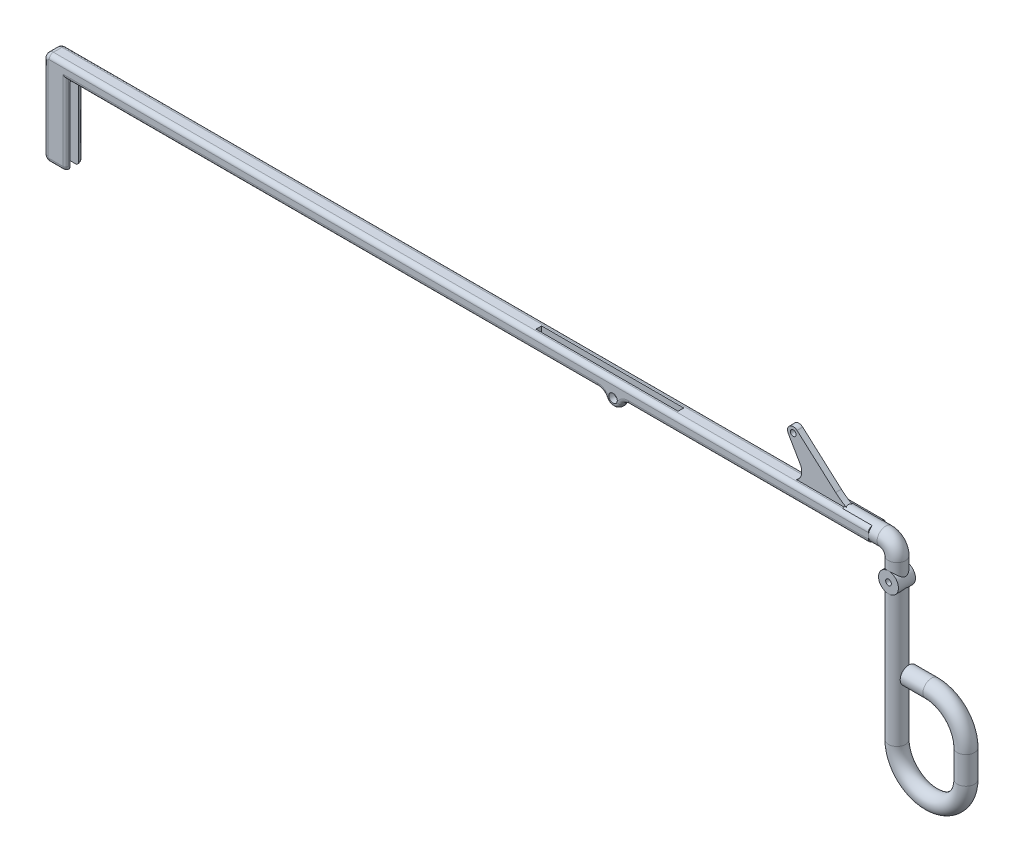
ISO-10303-21;
HEADER;
FILE_DESCRIPTION(('STEP AP214'),'2;1');
FILE_NAME('part.step','',(''),(''),'','','');
FILE_SCHEMA(('AUTOMOTIVE_DESIGN { 1 0 10303 214 1 1 1 1 }'));
ENDSEC;
DATA;
#1=APPLICATION_CONTEXT('core data for automotive mechanical design processes');
#2=APPLICATION_PROTOCOL_DEFINITION('international standard','automotive_design',2000,#1);
#3=PRODUCT_CONTEXT('',#1,'mechanical');
#4=PRODUCT('Part','Part','',(#3));
#5=PRODUCT_RELATED_PRODUCT_CATEGORY('part','',(#4));
#6=PRODUCT_DEFINITION_FORMATION('','',#4);
#7=PRODUCT_DEFINITION_CONTEXT('part definition',#1,'design');
#8=PRODUCT_DEFINITION('design','',#6,#7);
#9=PRODUCT_DEFINITION_SHAPE('','',#8);
#10=(LENGTH_UNIT() NAMED_UNIT(*) SI_UNIT(.MILLI.,.METRE.));
#11=(NAMED_UNIT(*) PLANE_ANGLE_UNIT() SI_UNIT($,.RADIAN.));
#12=(NAMED_UNIT(*) SI_UNIT($,.STERADIAN.) SOLID_ANGLE_UNIT());
#13=UNCERTAINTY_MEASURE_WITH_UNIT(LENGTH_MEASURE(1.E-05),#10,'distance_accuracy_value','');
#14=(GEOMETRIC_REPRESENTATION_CONTEXT(3) GLOBAL_UNCERTAINTY_ASSIGNED_CONTEXT((#13)) GLOBAL_UNIT_ASSIGNED_CONTEXT((#10,
#11,#12)) REPRESENTATION_CONTEXT('',''));
#15=CARTESIAN_POINT('',(0.,0.,0.));
#16=DIRECTION('',(0.,0.,1.));
#17=DIRECTION('',(1.,0.,0.));
#18=AXIS2_PLACEMENT_3D('',#15,#16,#17);
#19=CARTESIAN_POINT('',(142.076929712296,18.9612406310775,0.));
#20=DIRECTION('',(0.,-1.,0.));
#21=DIRECTION('',(1.,0.,0.));
#22=AXIS2_PLACEMENT_3D('',#19,#20,#21);
#23=CYLINDRICAL_SURFACE('',#22,3.);
#24=CARTESIAN_POINT('',(142.076929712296,18.9612406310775,0.));
#25=DIRECTION('',(0.,-1.,0.));
#26=DIRECTION('',(0.,0.,-1.));
#27=AXIS2_PLACEMENT_3D('',#24,#25,#26);
#28=CIRCLE('',#27,3.);
#29=CARTESIAN_POINT('',(145.076929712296,18.9612406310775,0.));
#30=VERTEX_POINT('',#29);
#31=EDGE_CURVE('E1119',#30,#30,#28,.T.);
#32=ORIENTED_EDGE('',*,*,#31,.T.);
#33=EDGE_LOOP('',(#32));
#34=FACE_BOUND('',#33,.T.);
#35=CARTESIAN_POINT('',(145.076929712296,14.1417401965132,0.));
#36=CARTESIAN_POINT('',(145.07692046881,14.1417664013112,-0.100748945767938));
#37=CARTESIAN_POINT('',(145.071788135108,14.1503786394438,-0.201634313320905));
#38=CARTESIAN_POINT('',(145.051834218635,14.1829407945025,-0.399972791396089));
#39=CARTESIAN_POINT('',(145.036981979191,14.206939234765,-0.497414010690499));
#40=CARTESIAN_POINT('',(144.990825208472,14.2784448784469,-0.726674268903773));
#41=CARTESIAN_POINT('',(144.955235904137,14.3315879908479,-0.855805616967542));
#42=CARTESIAN_POINT('',(144.869693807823,14.4498067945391,-1.10352142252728));
#43=CARTESIAN_POINT('',(144.819688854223,14.51492550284,-1.22206549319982));
#44=CARTESIAN_POINT('',(144.720124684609,14.6341308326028,-1.42225745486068));
#45=CARTESIAN_POINT('',(144.673315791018,14.6871340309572,-1.50595173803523));
#46=CARTESIAN_POINT('',(144.572267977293,14.7942324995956,-1.66805885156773));
#47=CARTESIAN_POINT('',(144.518025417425,14.8483282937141,-1.74646906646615));
#48=CARTESIAN_POINT('',(144.402235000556,14.9559731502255,-1.89789941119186));
#49=CARTESIAN_POINT('',(144.340696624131,15.0095228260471,-1.9709263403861));
#50=CARTESIAN_POINT('',(144.21022796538,15.1148432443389,-2.11145261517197));
#51=CARTESIAN_POINT('',(144.141296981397,15.1666138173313,-2.17895143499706));
#52=CARTESIAN_POINT('',(143.955736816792,15.2950121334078,-2.34368830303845));
#53=CARTESIAN_POINT('',(143.833813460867,15.3695503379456,-2.43672534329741));
#54=CARTESIAN_POINT('',(143.572471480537,15.5066435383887,-2.60527113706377));
#55=CARTESIAN_POINT('',(143.433082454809,15.5692183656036,-2.68080894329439));
#56=CARTESIAN_POINT('',(143.165257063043,15.6677833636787,-2.79873180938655));
#57=CARTESIAN_POINT('',(143.039404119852,15.7065352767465,-2.84464272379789));
#58=CARTESIAN_POINT('',(142.779419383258,15.7701778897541,-2.9197214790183));
#59=CARTESIAN_POINT('',(142.645292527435,15.795076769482,-2.94889920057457));
#60=CARTESIAN_POINT('',(142.371633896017,15.8290890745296,-2.98870264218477));
#61=CARTESIAN_POINT('',(142.232079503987,15.8381270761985,-2.99923972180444));
#62=CARTESIAN_POINT('',(141.952797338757,15.8393523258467,-3.00068010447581));
#63=CARTESIAN_POINT('',(141.81306958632,15.8315414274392,-2.99158556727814));
#64=CARTESIAN_POINT('',(141.548733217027,15.8010319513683,-2.9559143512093));
#65=CARTESIAN_POINT('',(141.423789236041,15.7795269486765,-2.93073879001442));
#66=CARTESIAN_POINT('',(141.180639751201,15.7243335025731,-2.86574853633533));
#67=CARTESIAN_POINT('',(141.062435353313,15.6906430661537,-2.82593144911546));
#68=CARTESIAN_POINT('',(140.826062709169,15.6101345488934,-2.72998675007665));
#69=CARTESIAN_POINT('',(140.708584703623,15.562511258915,-2.67284682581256));
#70=CARTESIAN_POINT('',(140.48502572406,15.4581870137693,-2.54605400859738));
#71=CARTESIAN_POINT('',(140.378953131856,15.4014794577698,-2.47639201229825));
#72=CARTESIAN_POINT('',(140.128251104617,15.2513190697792,-2.2886769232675));
#73=CARTESIAN_POINT('',(139.991053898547,15.1537276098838,-2.16390472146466));
#74=CARTESIAN_POINT('',(139.805506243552,15.0027050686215,-1.96189533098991));
#75=CARTESIAN_POINT('',(139.746951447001,14.9515028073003,-1.89195519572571));
#76=CARTESIAN_POINT('',(139.636566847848,14.8487052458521,-1.74725426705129));
#77=CARTESIAN_POINT('',(139.584734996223,14.7971100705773,-1.67249495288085));
#78=CARTESIAN_POINT('',(139.459476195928,14.6648678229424,-1.47303653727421));
#79=CARTESIAN_POINT('',(139.391092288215,14.5848328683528,-1.34464765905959));
#80=CARTESIAN_POINT('',(139.30196525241,14.4721406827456,-1.14234922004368));
#81=CARTESIAN_POINT('',(139.274517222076,14.4358340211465,-1.07336663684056));
#82=CARTESIAN_POINT('',(139.224346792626,14.3670531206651,-0.931883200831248));
#83=CARTESIAN_POINT('',(139.201621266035,14.334576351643,-0.859384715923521));
#84=CARTESIAN_POINT('',(139.1573157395,14.2693257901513,-0.695962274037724));
#85=CARTESIAN_POINT('',(139.136850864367,14.2377631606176,-0.60422965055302));
#86=CARTESIAN_POINT('',(139.104407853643,14.1865743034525,-0.416139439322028));
#87=CARTESIAN_POINT('',(139.092407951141,14.1669174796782,-0.319794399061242));
#88=CARTESIAN_POINT('',(139.077838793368,14.1429336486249,-0.123352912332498));
#89=CARTESIAN_POINT('',(139.075368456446,14.1387674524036,-0.0232279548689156));
#90=CARTESIAN_POINT('',(139.08043828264,14.1471878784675,0.176080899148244));
#91=CARTESIAN_POINT('',(139.087987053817,14.15978890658,0.275263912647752));
#92=CARTESIAN_POINT('',(139.114463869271,14.2025935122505,0.487008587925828));
#93=CARTESIAN_POINT('',(139.135200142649,14.2355641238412,0.598753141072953));
#94=CARTESIAN_POINT('',(139.187594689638,14.3144509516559,0.81499587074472));
#95=CARTESIAN_POINT('',(139.21929202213,14.3604133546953,0.919466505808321));
#96=CARTESIAN_POINT('',(139.286308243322,14.4517036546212,1.10475592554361));
#97=CARTESIAN_POINT('',(139.320204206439,14.4959236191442,1.18666136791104));
#98=CARTESIAN_POINT('',(139.39430975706,14.5874177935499,1.34583166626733));
#99=CARTESIAN_POINT('',(139.434523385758,14.6346939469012,1.4230935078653));
#100=CARTESIAN_POINT('',(139.521095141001,14.7306996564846,1.57328623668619));
#101=CARTESIAN_POINT('',(139.567460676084,14.7794309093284,1.64621174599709));
#102=CARTESIAN_POINT('',(139.666239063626,14.8770487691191,1.78774059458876));
#103=CARTESIAN_POINT('',(139.718652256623,14.9259353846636,1.85634369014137));
#104=CARTESIAN_POINT('',(139.832349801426,15.0252826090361,1.99251629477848));
#105=CARTESIAN_POINT('',(139.89394919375,15.0756973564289,2.05985705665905));
#106=CARTESIAN_POINT('',(140.023888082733,15.1744767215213,2.1893918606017));
#107=CARTESIAN_POINT('',(140.092228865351,15.2228409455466,2.25158491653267));
#108=CARTESIAN_POINT('',(140.235470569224,15.3163392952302,2.37015716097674));
#109=CARTESIAN_POINT('',(140.310353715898,15.3614816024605,2.42655124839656));
#110=CARTESIAN_POINT('',(140.466715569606,15.4476018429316,2.53301409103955));
#111=CARTESIAN_POINT('',(140.548193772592,15.4885800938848,2.58308332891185));
#112=CARTESIAN_POINT('',(140.750821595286,15.5803572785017,2.69434881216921));
#113=CARTESIAN_POINT('',(140.874989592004,15.6286974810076,2.75219843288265));
#114=CARTESIAN_POINT('',(141.133966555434,15.7120624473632,2.85131742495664));
#115=CARTESIAN_POINT('',(141.268767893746,15.7470966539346,2.89259855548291));
#116=CARTESIAN_POINT('',(141.546955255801,15.8013148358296,2.95628098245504));
#117=CARTESIAN_POINT('',(141.690393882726,15.8203882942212,2.97855065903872));
#118=CARTESIAN_POINT('',(141.980229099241,15.8404431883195,3.00195789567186));
#119=CARTESIAN_POINT('',(142.126624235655,15.8414333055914,3.00310559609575));
#120=CARTESIAN_POINT('',(142.40146806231,15.8261317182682,2.9852314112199));
#121=CARTESIAN_POINT('',(142.530168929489,15.8116675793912,2.96834256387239));
#122=CARTESIAN_POINT('',(142.782180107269,15.7693883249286,2.91875364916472));
#123=CARTESIAN_POINT('',(142.90548948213,15.7415709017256,2.88605084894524));
#124=CARTESIAN_POINT('',(143.147753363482,15.6734259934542,2.80537763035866));
#125=CARTESIAN_POINT('',(143.266460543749,15.632743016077,2.75697220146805));
#126=CARTESIAN_POINT('',(143.493689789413,15.5416067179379,2.64740081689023));
#127=CARTESIAN_POINT('',(143.602208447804,15.4911501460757,2.58623061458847));
#128=CARTESIAN_POINT('',(143.857650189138,15.3568869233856,2.42114511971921));
#129=CARTESIAN_POINT('',(143.998140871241,15.2686663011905,2.31077286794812));
#130=CARTESIAN_POINT('',(144.190528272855,15.1297439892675,2.13083771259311));
#131=CARTESIAN_POINT('',(144.25171484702,15.0822248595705,2.06830793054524));
#132=CARTESIAN_POINT('',(144.367979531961,14.9859037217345,1.93872565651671));
#133=CARTESIAN_POINT('',(144.423059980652,14.9371022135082,1.87167491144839));
#134=CARTESIAN_POINT('',(144.528171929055,14.8382308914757,1.73182623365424));
#135=CARTESIAN_POINT('',(144.578080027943,14.7881552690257,1.65894001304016));
#136=CARTESIAN_POINT('',(144.671559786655,14.6889086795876,1.50855461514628));
#137=CARTESIAN_POINT('',(144.715128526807,14.6397381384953,1.43105333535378));
#138=CARTESIAN_POINT('',(144.795627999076,14.5440394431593,1.27147390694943));
#139=CARTESIAN_POINT('',(144.832578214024,14.4975038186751,1.18941015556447));
#140=CARTESIAN_POINT('',(144.89960136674,14.4090982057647,1.02019258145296));
#141=CARTESIAN_POINT('',(144.929682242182,14.3672228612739,0.933044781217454));
#142=CARTESIAN_POINT('',(144.983158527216,14.2898694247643,0.75044644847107));
#143=CARTESIAN_POINT('',(145.006318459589,14.2546291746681,0.654822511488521));
#144=CARTESIAN_POINT('',(145.043387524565,14.1967356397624,0.458278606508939));
#145=CARTESIAN_POINT('',(145.057335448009,14.1740296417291,0.357382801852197));
#146=CARTESIAN_POINT('',(145.069671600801,14.1537732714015,0.212825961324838));
#147=CARTESIAN_POINT('',(145.072385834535,14.1492831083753,0.170444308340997));
#148=CARTESIAN_POINT('',(145.076017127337,14.143260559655,0.0853833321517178));
#149=CARTESIAN_POINT('',(145.076933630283,14.1417290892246,0.0427039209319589));
#150=CARTESIAN_POINT('',(145.076929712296,14.1417401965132,0.));
#151=B_SPLINE_CURVE_WITH_KNOTS('',3,(#35,#36,#37,#38,#39,#40,#41,#42,#43,#44,#45,#46,#47,#48,
#49,#50,#51,#52,#53,#54,#55,#56,#57,#58,#59,#60,#61,#62,#63,#64,#65,#66,#67,#68,#69,#70,#71,#72,
#73,#74,#75,#76,#77,#78,#79,#80,#81,#82,#83,#84,#85,#86,#87,#88,#89,#90,#91,#92,#93,#94,#95,#96,
#97,#98,#99,#100,#101,#102,#103,#104,#105,#106,#107,#108,#109,#110,#111,#112,#113,#114,#115,
#116,#117,#118,#119,#120,#121,#122,#123,#124,#125,#126,#127,#128,#129,#130,#131,#132,#133,#134,
#135,#136,#137,#138,#139,#140,#141,#142,#143,#144,#145,#146,#147,#148,#149,#150),.UNSPECIFIED.,
.T.,.F.,(4,2,2,2,2,2,2,2,2,2,2,2,2,2,2,2,2,2,2,2,2,2,2,2,2,2,2,2,2,2,2,2,2,2,2,2,2,2,2,2,2,2,2,
2,2,2,2,2,2,2,2,2,2,2,2,2,2,4),(0.,0.302053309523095,0.60506391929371,1.03494054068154,
1.46639258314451,1.79471800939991,2.12320477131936,2.45126926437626,2.77936492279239,
3.28893439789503,3.79765170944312,4.21429981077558,4.63070163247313,5.0490782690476,
5.46740888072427,5.85350430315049,6.23966290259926,6.65527114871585,7.07118276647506,
7.69623078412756,8.00979742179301,8.32326826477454,8.8196209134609,9.06733181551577,
9.31487814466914,9.61137465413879,9.90710594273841,10.2058988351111,10.5049486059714,
10.8579841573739,11.2122909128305,11.5090886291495,11.8060769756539,12.1034262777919,
12.400792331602,12.7132348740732,13.0257371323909,13.3374153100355,13.6490696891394,
14.0830538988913,14.5167295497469,14.9533838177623,15.3898284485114,15.7798356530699,
16.169910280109,16.5718754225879,16.9739745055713,17.5682457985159,17.8667126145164,
18.1650647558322,18.469399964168,18.7738748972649,19.0774382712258,19.3806490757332,
19.6932352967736,20.0044967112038,20.1324868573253,20.2605165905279),.UNSPECIFIED.);
#152=CARTESIAN_POINT('',(142.076929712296,15.8387735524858,3.));
#153=VERTEX_POINT('',#152);
#154=CARTESIAN_POINT('',(142.076929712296,15.8387735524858,-3.));
#155=VERTEX_POINT('',#154);
#156=EDGE_CURVE('E41',#153,#155,#151,.T.);
#157=ORIENTED_EDGE('',*,*,#156,.T.);
#158=EDGE_CURVE('E11',#155,#153,#151,.T.);
#159=ORIENTED_EDGE('',*,*,#158,.T.);
#160=EDGE_LOOP('',(#157,#159));
#161=FACE_BOUND('',#160,.T.);
#162=ADVANCED_FACE('F36',(#34,#161),#23,.T.);
#163=CARTESIAN_POINT('',(145.176929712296,25.4612406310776,3.));
#164=DIRECTION('',(0.,-1.,0.));
#165=DIRECTION('',(0.,0.,-1.));
#166=AXIS2_PLACEMENT_3D('',#163,#164,#165);
#167=PLANE('',#166);
#168=DIRECTION('',(-1.,0.,0.));
#169=VECTOR('',#168,1.);
#170=CARTESIAN_POINT('',(66.067593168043,25.4612406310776,-1.));
#171=LINE('',#170,#169);
#172=CARTESIAN_POINT('',(66.067593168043,25.4612406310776,-1.));
#173=VERTEX_POINT('',#172);
#174=CARTESIAN_POINT('',(16.067593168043,25.4612406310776,-1.));
#175=VERTEX_POINT('',#174);
#176=EDGE_CURVE('E733',#173,#175,#171,.T.);
#177=ORIENTED_EDGE('',*,*,#176,.F.);
#178=DIRECTION('',(0.,0.,-1.));
#179=VECTOR('',#178,1.);
#180=CARTESIAN_POINT('',(66.067593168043,25.4612406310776,-1.));
#181=LINE('',#180,#179);
#182=CARTESIAN_POINT('',(66.067593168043,25.4612406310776,1.));
#183=VERTEX_POINT('',#182);
#184=EDGE_CURVE('E731',#183,#173,#181,.T.);
#185=ORIENTED_EDGE('',*,*,#184,.F.);
#186=DIRECTION('',(1.,0.,0.));
#187=VECTOR('',#186,1.);
#188=CARTESIAN_POINT('',(66.067593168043,25.4612406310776,1.));
#189=LINE('',#188,#187);
#190=CARTESIAN_POINT('',(16.067593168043,25.4612406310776,1.));
#191=VERTEX_POINT('',#190);
#192=EDGE_CURVE('E739',#191,#183,#189,.T.);
#193=ORIENTED_EDGE('',*,*,#192,.F.);
#194=DIRECTION('',(0.,0.,1.));
#195=VECTOR('',#194,1.);
#196=CARTESIAN_POINT('',(16.067593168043,25.4612406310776,-1.));
#197=LINE('',#196,#195);
#198=EDGE_CURVE('E736',#175,#191,#197,.T.);
#199=ORIENTED_EDGE('',*,*,#198,.F.);
#200=EDGE_LOOP('',(#177,#185,#193,#199));
#201=FACE_BOUND('',#200,.T.);
#202=DIRECTION('',(0.,0.,1.));
#203=VECTOR('',#202,1.);
#204=CARTESIAN_POINT('',(124.677722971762,25.4612406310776,3.));
#205=LINE('',#204,#203);
#206=CARTESIAN_POINT('',(124.677722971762,25.4612406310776,-1.5));
#207=VERTEX_POINT('',#206);
#208=CARTESIAN_POINT('',(124.677722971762,25.4612406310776,-1.));
#209=VERTEX_POINT('',#208);
#210=EDGE_CURVE('E1069',#207,#209,#205,.T.);
#211=ORIENTED_EDGE('',*,*,#210,.F.);
#212=DIRECTION('',(-1.,0.,0.));
#213=VECTOR('',#212,1.);
#214=CARTESIAN_POINT('',(145.176929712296,25.4612406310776,-1.5));
#215=LINE('',#214,#213);
#216=CARTESIAN_POINT('',(-153.163046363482,25.4612406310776,-1.5));
#217=VERTEX_POINT('',#216);
#218=EDGE_CURVE('E886',#207,#217,#215,.T.);
#219=ORIENTED_EDGE('',*,*,#218,.T.);
#220=DIRECTION('',(0.,0.,-1.));
#221=VECTOR('',#220,1.);
#222=CARTESIAN_POINT('',(-153.163046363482,25.4612406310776,3.));
#223=LINE('',#222,#221);
#224=CARTESIAN_POINT('',(-153.163046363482,25.4612406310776,1.5));
#225=VERTEX_POINT('',#224);
#226=EDGE_CURVE('E827',#217,#225,#223,.F.);
#227=ORIENTED_EDGE('',*,*,#226,.T.);
#228=DIRECTION('',(-1.,0.,0.));
#229=VECTOR('',#228,1.);
#230=CARTESIAN_POINT('',(145.176929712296,25.4612406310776,1.5));
#231=LINE('',#230,#229);
#232=CARTESIAN_POINT('',(124.677722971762,25.4612406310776,1.5));
#233=VERTEX_POINT('',#232);
#234=EDGE_CURVE('E888',#225,#233,#231,.F.);
#235=ORIENTED_EDGE('',*,*,#234,.T.);
#236=CARTESIAN_POINT('',(124.677722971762,25.4612406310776,1.));
#237=VERTEX_POINT('',#236);
#238=EDGE_CURVE('E1065',#237,#233,#205,.T.);
#239=ORIENTED_EDGE('',*,*,#238,.F.);
#240=DIRECTION('',(1.,0.,0.));
#241=VECTOR('',#240,1.);
#242=CARTESIAN_POINT('',(145.176929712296,25.4612406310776,1.));
#243=LINE('',#242,#241);
#244=CARTESIAN_POINT('',(107.777140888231,25.4612406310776,1.));
#245=VERTEX_POINT('',#244);
#246=EDGE_CURVE('E728',#245,#237,#243,.T.);
#247=ORIENTED_EDGE('',*,*,#246,.F.);
#248=DIRECTION('',(0.,0.,-1.));
#249=VECTOR('',#248,1.);
#250=CARTESIAN_POINT('',(107.777140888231,25.4612406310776,1.));
#251=LINE('',#250,#249);
#252=CARTESIAN_POINT('',(107.777140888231,25.4612406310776,-1.));
#253=VERTEX_POINT('',#252);
#254=EDGE_CURVE('E702',#245,#253,#251,.T.);
#255=ORIENTED_EDGE('',*,*,#254,.T.);
#256=DIRECTION('',(1.,0.,0.));
#257=VECTOR('',#256,1.);
#258=CARTESIAN_POINT('',(145.176929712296,25.4612406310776,-1.));
#259=LINE('',#258,#257);
#260=EDGE_CURVE('E725',#253,#209,#259,.T.);
#261=ORIENTED_EDGE('',*,*,#260,.T.);
#262=EDGE_LOOP('',(#211,#219,#227,#235,#239,#247,#255,#261));
#263=FACE_BOUND('',#262,.T.);
#264=ADVANCED_FACE('F489',(#201,#263),#167,.F.);
#265=CARTESIAN_POINT('',(50.6169986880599,20.4612406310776,3.));
#266=DIRECTION('',(0.,1.,0.));
#267=DIRECTION('',(-1.,0.,0.));
#268=AXIS2_PLACEMENT_3D('',#265,#266,#267);
#269=PLANE('',#268);
#270=DIRECTION('',(0.,0.,-1.));
#271=VECTOR('',#270,1.);
#272=CARTESIAN_POINT('',(124.677722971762,20.4612406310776,3.));
#273=LINE('',#272,#271);
#274=CARTESIAN_POINT('',(124.677722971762,20.4612406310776,1.5));
#275=VERTEX_POINT('',#274);
#276=CARTESIAN_POINT('',(124.677722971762,20.4612406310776,-1.5));
#277=VERTEX_POINT('',#276);
#278=EDGE_CURVE('E1053',#275,#277,#273,.T.);
#279=ORIENTED_EDGE('',*,*,#278,.F.);
#280=DIRECTION('',(1.,0.,0.));
#281=VECTOR('',#280,1.);
#282=CARTESIAN_POINT('',(50.6169986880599,20.4612406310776,1.5));
#283=LINE('',#282,#281);
#284=CARTESIAN_POINT('',(50.6169986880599,20.4612406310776,1.5));
#285=VERTEX_POINT('',#284);
#286=EDGE_CURVE('E891',#275,#285,#283,.F.);
#287=ORIENTED_EDGE('',*,*,#286,.T.);
#288=DIRECTION('',(0.,0.,-1.));
#289=VECTOR('',#288,1.);
#290=CARTESIAN_POINT('',(50.6169986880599,20.4612406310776,3.));
#291=LINE('',#290,#289);
#292=CARTESIAN_POINT('',(50.6169986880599,20.4612406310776,1.));
#293=VERTEX_POINT('',#292);
#294=EDGE_CURVE('E792',#285,#293,#291,.T.);
#295=ORIENTED_EDGE('',*,*,#294,.T.);
#296=DIRECTION('',(1.,0.,0.));
#297=VECTOR('',#296,1.);
#298=CARTESIAN_POINT('',(50.6169986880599,20.4612406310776,1.));
#299=LINE('',#298,#297);
#300=CARTESIAN_POINT('',(66.067593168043,20.4612406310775,1.));
#301=VERTEX_POINT('',#300);
#302=EDGE_CURVE('E768',#293,#301,#299,.T.);
#303=ORIENTED_EDGE('',*,*,#302,.T.);
#304=DIRECTION('',(0.,0.,-1.));
#305=VECTOR('',#304,1.);
#306=CARTESIAN_POINT('',(66.067593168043,20.4612406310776,3.));
#307=LINE('',#306,#305);
#308=CARTESIAN_POINT('',(66.067593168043,20.4612406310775,-1.));
#309=VERTEX_POINT('',#308);
#310=EDGE_CURVE('E806',#301,#309,#307,.T.);
#311=ORIENTED_EDGE('',*,*,#310,.T.);
#312=DIRECTION('',(-1.,0.,0.));
#313=VECTOR('',#312,1.);
#314=CARTESIAN_POINT('',(50.6169986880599,20.4612406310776,-1.));
#315=LINE('',#314,#313);
#316=CARTESIAN_POINT('',(50.6169986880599,20.4612406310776,-1.));
#317=VERTEX_POINT('',#316);
#318=EDGE_CURVE('E752',#309,#317,#315,.T.);
#319=ORIENTED_EDGE('',*,*,#318,.T.);
#320=CARTESIAN_POINT('',(50.6169986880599,20.4612406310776,-1.5));
#321=VERTEX_POINT('',#320);
#322=EDGE_CURVE('E787',#317,#321,#291,.T.);
#323=ORIENTED_EDGE('',*,*,#322,.T.);
#324=DIRECTION('',(1.,0.,0.));
#325=VECTOR('',#324,1.);
#326=CARTESIAN_POINT('',(50.6169986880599,20.4612406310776,-1.5));
#327=LINE('',#326,#325);
#328=EDGE_CURVE('E893',#321,#277,#327,.T.);
#329=ORIENTED_EDGE('',*,*,#328,.T.);
#330=EDGE_LOOP('',(#279,#287,#295,#303,#311,#319,#323,#329));
#331=FACE_BOUND('',#330,.T.);
#332=ADVANCED_FACE('F485',(#331),#269,.F.);
#333=CARTESIAN_POINT('',(134.789423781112,43.3703287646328,1.));
#334=DIRECTION('',(0.,0.,-1.));
#335=DIRECTION('',(-1.,0.,0.));
#336=AXIS2_PLACEMENT_3D('',#333,#334,#335);
#337=PLANE('',#336);
#338=CARTESIAN_POINT('',(106.566929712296,39.0521791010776,1.));
#339=DIRECTION('',(0.,0.,1.));
#340=DIRECTION('',(1.,0.,0.));
#341=AXIS2_PLACEMENT_3D('',#338,#339,#340);
#342=CIRCLE('',#341,0.999999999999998);
#343=CARTESIAN_POINT('',(107.566929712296,39.0521791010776,1.));
#344=VERTEX_POINT('',#343);
#345=EDGE_CURVE('E684',#344,#344,#342,.T.);
#346=ORIENTED_EDGE('',*,*,#345,.F.);
#347=EDGE_LOOP('',(#346));
#348=FACE_BOUND('',#347,.T.);
#349=DIRECTION('',(-1.,0.,0.));
#350=VECTOR('',#349,1.);
#351=CARTESIAN_POINT('',(138.076929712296,25.7896677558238,1.));
#352=LINE('',#351,#350);
#353=CARTESIAN_POINT('',(125.254207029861,25.7896677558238,1.));
#354=VERTEX_POINT('',#353);
#355=CARTESIAN_POINT('',(124.677722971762,25.7896677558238,1.));
#356=VERTEX_POINT('',#355);
#357=EDGE_CURVE('E1058',#354,#356,#352,.T.);
#358=ORIENTED_EDGE('',*,*,#357,.F.);
#359=CARTESIAN_POINT('',(134.789423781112,43.3703287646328,1.));
#360=DIRECTION('',(0.,0.,-1.));
#361=DIRECTION('',(-1.,0.,0.));
#362=AXIS2_PLACEMENT_3D('',#359,#360,#361);
#363=CIRCLE('',#362,20.);
#364=CARTESIAN_POINT('',(121.483631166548,28.4386214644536,1.));
#365=VERTEX_POINT('',#364);
#366=EDGE_CURVE('E690',#354,#365,#363,.T.);
#367=ORIENTED_EDGE('',*,*,#366,.T.);
#368=DIRECTION('',(-0.746585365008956,0.665289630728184,0.));
#369=VECTOR('',#368,1.);
#370=CARTESIAN_POINT('',(121.483631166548,28.4386214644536,1.));
#371=LINE('',#370,#369);
#372=CARTESIAN_POINT('',(107.897508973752,40.5453498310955,1.));
#373=VERTEX_POINT('',#372);
#374=EDGE_CURVE('E692',#365,#373,#371,.T.);
#375=ORIENTED_EDGE('',*,*,#374,.T.);
#376=CARTESIAN_POINT('',(106.566929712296,39.0521791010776,1.));
#377=DIRECTION('',(0.,0.,1.));
#378=DIRECTION('',(1.,0.,0.));
#379=AXIS2_PLACEMENT_3D('',#376,#377,#378);
#380=CIRCLE('',#379,2.00000000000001);
#381=CARTESIAN_POINT('',(104.835855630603,38.0504892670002,1.));
#382=VERTEX_POINT('',#381);
#383=EDGE_CURVE('E695',#373,#382,#380,.T.);
#384=ORIENTED_EDGE('',*,*,#383,.T.);
#385=DIRECTION('',(0.500844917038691,-0.865537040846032,0.));
#386=VECTOR('',#385,1.);
#387=CARTESIAN_POINT('',(109.03134694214,30.8000350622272,1.));
#388=LINE('',#387,#386);
#389=CARTESIAN_POINT('',(109.03134694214,30.8000350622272,1.));
#390=VERTEX_POINT('',#389);
#391=EDGE_CURVE('E697',#382,#390,#388,.T.);
#392=ORIENTED_EDGE('',*,*,#391,.T.);
#393=CARTESIAN_POINT('',(105.569198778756,28.7966553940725,1.));
#394=DIRECTION('',(0.,0.,-1.));
#395=DIRECTION('',(1.,0.,0.));
#396=AXIS2_PLACEMENT_3D('',#393,#394,#395);
#397=CIRCLE('',#396,4.);
#398=EDGE_CURVE('E699',#390,#245,#397,.T.);
#399=ORIENTED_EDGE('',*,*,#398,.T.);
#400=ORIENTED_EDGE('',*,*,#246,.T.);
#401=DIRECTION('',(0.,-1.,0.));
#402=VECTOR('',#401,1.);
#403=CARTESIAN_POINT('',(124.677722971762,43.3703287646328,1.));
#404=LINE('',#403,#402);
#405=EDGE_CURVE('E1068',#356,#237,#404,.T.);
#406=ORIENTED_EDGE('',*,*,#405,.F.);
#407=EDGE_LOOP('',(#358,#367,#375,#384,#392,#399,#400,#406));
#408=FACE_BOUND('',#407,.T.);
#409=ADVANCED_FACE('F488',(#348,#408),#337,.F.);
#410=CARTESIAN_POINT('',(134.789423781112,43.3703287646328,-1.));
#411=DIRECTION('',(0.,0.,-1.));
#412=DIRECTION('',(-1.,0.,0.));
#413=AXIS2_PLACEMENT_3D('',#410,#411,#412);
#414=PLANE('',#413);
#415=CARTESIAN_POINT('',(106.566929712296,39.0521791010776,-1.));
#416=DIRECTION('',(0.,0.,1.));
#417=DIRECTION('',(1.,0.,0.));
#418=AXIS2_PLACEMENT_3D('',#415,#416,#417);
#419=CIRCLE('',#418,0.999999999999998);
#420=CARTESIAN_POINT('',(107.566929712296,39.0521791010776,-1.));
#421=VERTEX_POINT('',#420);
#422=EDGE_CURVE('E681',#421,#421,#419,.T.);
#423=ORIENTED_EDGE('',*,*,#422,.T.);
#424=EDGE_LOOP('',(#423));
#425=FACE_BOUND('',#424,.T.);
#426=CARTESIAN_POINT('',(134.789423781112,43.3703287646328,-1.));
#427=DIRECTION('',(0.,0.,-1.));
#428=DIRECTION('',(-1.,0.,0.));
#429=AXIS2_PLACEMENT_3D('',#426,#427,#428);
#430=CIRCLE('',#429,20.);
#431=CARTESIAN_POINT('',(125.254207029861,25.7896677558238,-1.));
#432=VERTEX_POINT('',#431);
#433=CARTESIAN_POINT('',(121.483631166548,28.4386214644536,-1.));
#434=VERTEX_POINT('',#433);
#435=EDGE_CURVE('E687',#432,#434,#430,.T.);
#436=ORIENTED_EDGE('',*,*,#435,.F.);
#437=DIRECTION('',(-1.,0.,0.));
#438=VECTOR('',#437,1.);
#439=CARTESIAN_POINT('',(138.076929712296,25.7896677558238,-1.));
#440=LINE('',#439,#438);
#441=CARTESIAN_POINT('',(124.677722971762,25.7896677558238,-1.));
#442=VERTEX_POINT('',#441);
#443=EDGE_CURVE('E439',#432,#442,#440,.T.);
#444=ORIENTED_EDGE('',*,*,#443,.T.);
#445=DIRECTION('',(0.,-1.,0.));
#446=VECTOR('',#445,1.);
#447=CARTESIAN_POINT('',(124.677722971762,43.3703287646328,-1.));
#448=LINE('',#447,#446);
#449=EDGE_CURVE('E1073',#442,#209,#448,.T.);
#450=ORIENTED_EDGE('',*,*,#449,.T.);
#451=ORIENTED_EDGE('',*,*,#260,.F.);
#452=CARTESIAN_POINT('',(105.569198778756,28.7966553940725,-1.));
#453=DIRECTION('',(0.,0.,-1.));
#454=DIRECTION('',(1.,0.,0.));
#455=AXIS2_PLACEMENT_3D('',#452,#453,#454);
#456=CIRCLE('',#455,4.);
#457=CARTESIAN_POINT('',(109.03134694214,30.8000350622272,-1.));
#458=VERTEX_POINT('',#457);
#459=EDGE_CURVE('E693',#458,#253,#456,.T.);
#460=ORIENTED_EDGE('',*,*,#459,.F.);
#461=DIRECTION('',(0.500844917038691,-0.865537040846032,0.));
#462=VECTOR('',#461,1.);
#463=CARTESIAN_POINT('',(109.03134694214,30.8000350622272,-1.));
#464=LINE('',#463,#462);
#465=CARTESIAN_POINT('',(104.835855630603,38.0504892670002,-1.));
#466=VERTEX_POINT('',#465);
#467=EDGE_CURVE('E708',#466,#458,#464,.T.);
#468=ORIENTED_EDGE('',*,*,#467,.F.);
#469=CARTESIAN_POINT('',(106.566929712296,39.0521791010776,-1.));
#470=DIRECTION('',(0.,0.,1.));
#471=DIRECTION('',(1.,0.,0.));
#472=AXIS2_PLACEMENT_3D('',#469,#470,#471);
#473=CIRCLE('',#472,2.00000000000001);
#474=CARTESIAN_POINT('',(107.897508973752,40.5453498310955,-1.));
#475=VERTEX_POINT('',#474);
#476=EDGE_CURVE('E706',#475,#466,#473,.T.);
#477=ORIENTED_EDGE('',*,*,#476,.F.);
#478=DIRECTION('',(-0.746585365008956,0.665289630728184,0.));
#479=VECTOR('',#478,1.);
#480=CARTESIAN_POINT('',(121.483631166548,28.4386214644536,-1.));
#481=LINE('',#480,#479);
#482=EDGE_CURVE('E704',#434,#475,#481,.T.);
#483=ORIENTED_EDGE('',*,*,#482,.F.);
#484=EDGE_LOOP('',(#436,#444,#450,#451,#460,#468,#477,#483));
#485=FACE_BOUND('',#484,.T.);
#486=ADVANCED_FACE('F449',(#425,#485),#414,.T.);
#487=CARTESIAN_POINT('',(134.789423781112,43.3703287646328,1.));
#488=DIRECTION('',(0.,0.,-1.));
#489=DIRECTION('',(-1.,0.,0.));
#490=AXIS2_PLACEMENT_3D('',#487,#488,#489);
#491=CYLINDRICAL_SURFACE('',#490,20.);
#492=CARTESIAN_POINT('',(131.886359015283,23.5821450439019,-2.93504305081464));
#493=CARTESIAN_POINT('',(131.720331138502,23.6065012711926,-2.9298777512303));
#494=CARTESIAN_POINT('',(131.55462785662,23.6329467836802,-2.92397856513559));
#495=CARTESIAN_POINT('',(131.223995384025,23.6899869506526,-2.91029370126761));
#496=CARTESIAN_POINT('',(131.059066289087,23.7205821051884,-2.90250779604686));
#497=CARTESIAN_POINT('',(130.729588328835,23.7859971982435,-2.88460144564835));
#498=CARTESIAN_POINT('',(130.565042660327,23.8208311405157,-2.87447315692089));
#499=CARTESIAN_POINT('',(130.237075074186,23.894590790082,-2.85137732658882));
#500=CARTESIAN_POINT('',(130.073653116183,23.9335163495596,-2.83840988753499));
#501=CARTESIAN_POINT('',(129.741756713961,24.0169964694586,-2.80845570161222));
#502=CARTESIAN_POINT('',(129.573334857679,24.0617117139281,-2.79133150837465));
#503=CARTESIAN_POINT('',(129.238200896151,24.1553816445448,-2.75256200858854));
#504=CARTESIAN_POINT('',(129.071488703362,24.2043361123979,-2.73091693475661));
#505=CARTESIAN_POINT('',(128.740357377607,24.3062589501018,-2.68218448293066));
#506=CARTESIAN_POINT('',(128.575935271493,24.3592213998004,-2.65510503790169));
#507=CARTESIAN_POINT('',(128.249632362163,24.468986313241,-2.59434767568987));
#508=CARTESIAN_POINT('',(128.087751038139,24.5257879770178,-2.56067113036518));
#509=CARTESIAN_POINT('',(127.768992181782,24.6422218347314,-2.48576771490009));
#510=CARTESIAN_POINT('',(127.612078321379,24.7018133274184,-2.4446334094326));
#511=CARTESIAN_POINT('',(127.302089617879,24.8239658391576,-2.35289139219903));
#512=CARTESIAN_POINT('',(127.149016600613,24.8865282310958,-2.30227926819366));
#513=CARTESIAN_POINT('',(126.849576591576,25.0131782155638,-2.19012325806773));
#514=CARTESIAN_POINT('',(126.703157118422,25.077243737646,-2.12869616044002));
#515=CARTESIAN_POINT('',(126.417354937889,25.2062719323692,-1.99215070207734));
#516=CARTESIAN_POINT('',(126.277963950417,25.2712334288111,-1.91704895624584));
#517=CARTESIAN_POINT('',(126.038451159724,25.3860557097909,-1.76834585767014));
#518=CARTESIAN_POINT('',(125.936411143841,25.4361101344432,-1.69801269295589));
#519=CARTESIAN_POINT('',(125.740286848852,25.534265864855,-1.54525090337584));
#520=CARTESIAN_POINT('',(125.646216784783,25.5823636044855,-1.4628013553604));
#521=CARTESIAN_POINT('',(125.468474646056,25.6748479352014,-1.28322385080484));
#522=CARTESIAN_POINT('',(125.384929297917,25.7191875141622,-1.18594341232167));
#523=CARTESIAN_POINT('',(125.23457465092,25.8001229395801,-0.976347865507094));
#524=CARTESIAN_POINT('',(125.167715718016,25.8367417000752,-0.864078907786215));
#525=CARTESIAN_POINT('',(125.075731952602,25.8875949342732,-0.66568498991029));
#526=CARTESIAN_POINT('',(125.044131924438,25.9052168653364,-0.583440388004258));
#527=CARTESIAN_POINT('',(124.993158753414,25.9337565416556,-0.414117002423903));
#528=CARTESIAN_POINT('',(124.973774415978,25.9446804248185,-0.327042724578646));
#529=CARTESIAN_POINT('',(124.948709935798,25.9588218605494,-0.149809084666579));
#530=CARTESIAN_POINT('',(124.943103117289,25.9619981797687,-0.0596357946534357));
#531=CARTESIAN_POINT('',(124.946326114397,25.9601756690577,0.120371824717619));
#532=CARTESIAN_POINT('',(124.955156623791,25.9551764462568,0.210206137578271));
#533=CARTESIAN_POINT('',(124.985335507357,25.938171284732,0.380378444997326));
#534=CARTESIAN_POINT('',(125.005755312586,25.926685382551,0.4609389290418));
#535=CARTESIAN_POINT('',(125.056962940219,25.8980632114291,0.617597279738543));
#536=CARTESIAN_POINT('',(125.087755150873,25.8809245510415,0.693693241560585));
#537=CARTESIAN_POINT('',(125.174252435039,25.8331714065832,0.874240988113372));
#538=CARTESIAN_POINT('',(125.234901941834,25.7999844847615,0.975636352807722));
#539=CARTESIAN_POINT('',(125.370005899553,25.7271868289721,1.16619690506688));
#540=CARTESIAN_POINT('',(125.444493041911,25.6875609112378,1.25533224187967));
#541=CARTESIAN_POINT('',(125.587242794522,25.6129362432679,1.4049892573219));
#542=CARTESIAN_POINT('',(125.653684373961,25.578638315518,1.4676415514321));
#543=CARTESIAN_POINT('',(125.79158465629,25.5085014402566,1.5862580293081));
#544=CARTESIAN_POINT('',(125.863046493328,25.4726615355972,1.64221797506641));
#545=CARTESIAN_POINT('',(126.009993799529,25.4001219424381,1.74813716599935));
#546=CARTESIAN_POINT('',(126.085484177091,25.3634212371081,1.79808883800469));
#547=CARTESIAN_POINT('',(126.239656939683,25.2897091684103,1.89256946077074));
#548=CARTESIAN_POINT('',(126.318340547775,25.2526976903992,1.93709630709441));
#549=CARTESIAN_POINT('',(126.551124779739,25.1451076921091,2.05966714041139));
#550=CARTESIAN_POINT('',(126.708661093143,25.0746502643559,2.13131388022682));
#551=CARTESIAN_POINT('',(127.030378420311,24.9359040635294,2.26045781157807));
#552=CARTESIAN_POINT('',(127.194565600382,24.8676174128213,2.31794150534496));
#553=CARTESIAN_POINT('',(127.528670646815,24.73396617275,2.42170048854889));
#554=CARTESIAN_POINT('',(127.698614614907,24.6686193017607,2.4679137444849));
#555=CARTESIAN_POINT('',(128.042153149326,24.5419496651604,2.550898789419));
#556=CARTESIAN_POINT('',(128.215746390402,24.4806254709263,2.58767394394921));
#557=CARTESIAN_POINT('',(128.53288979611,24.3735320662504,2.64734653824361));
#558=CARTESIAN_POINT('',(128.675943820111,24.3270078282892,2.67155321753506));
#559=CARTESIAN_POINT('',(128.963672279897,24.2370239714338,2.71567341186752));
#560=CARTESIAN_POINT('',(129.108346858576,24.1935646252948,2.73558654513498));
#561=CARTESIAN_POINT('',(129.544633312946,24.0678998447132,2.78992641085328));
#562=CARTESIAN_POINT('',(129.83832443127,23.9904697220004,2.81892100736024));
#563=CARTESIAN_POINT('',(130.278534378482,23.8851031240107,2.8544327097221));
#564=CARTESIAN_POINT('',(130.423581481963,23.8520916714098,2.8648652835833));
#565=CARTESIAN_POINT('',(130.71451541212,23.7892854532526,2.88364730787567));
#566=CARTESIAN_POINT('',(130.86040225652,23.7594907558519,2.89199671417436));
#567=CARTESIAN_POINT('',(131.152625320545,23.7032038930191,2.90694652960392));
#568=CARTESIAN_POINT('',(131.298960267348,23.6767059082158,2.91355004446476));
#569=CARTESIAN_POINT('',(131.592230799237,23.6269734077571,2.92531045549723));
#570=CARTESIAN_POINT('',(131.739166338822,23.603738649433,2.93046745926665));
#571=CARTESIAN_POINT('',(131.886359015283,23.5821450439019,2.9350430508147));
#572=B_SPLINE_CURVE_WITH_KNOTS('',3,(#492,#493,#494,#495,#496,#497,#498,#499,#500,#501,#502,
#503,#504,#505,#506,#507,#508,#509,#510,#511,#512,#513,#514,#515,#516,#517,#518,#519,#520,#521,
#522,#523,#524,#525,#526,#527,#528,#529,#530,#531,#532,#533,#534,#535,#536,#537,#538,#539,#540,
#541,#542,#543,#544,#545,#546,#547,#548,#549,#550,#551,#552,#553,#554,#555,#556,#557,#558,#559,
#560,#561,#562,#563,#564,#565,#566,#567,#568,#569,#570,#571),.UNSPECIFIED.,.F.,.F.,(4,2,2,2,2,2,
2,2,2,2,2,2,2,2,2,2,2,2,2,2,2,2,2,2,2,2,2,2,2,2,2,2,2,2,2,2,2,2,2,4),(0.,0.50364523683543,
1.00735121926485,1.51276894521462,2.01816841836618,2.54334855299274,3.06850166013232,
3.59289366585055,4.11717674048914,4.63534985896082,5.15376480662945,5.66689110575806,
6.17939805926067,6.57975059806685,6.98080279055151,7.38629761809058,7.79057151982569,
8.05909122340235,8.32736449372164,8.59706245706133,8.8667733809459,9.11742717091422,
9.36818713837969,9.73428581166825,10.1012606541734,10.3935097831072,10.6859430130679,
10.9787410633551,11.2716523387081,11.831267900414,12.3914147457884,12.9545784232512,
13.5175410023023,13.9745268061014,14.4315532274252,15.3461941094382,15.7935261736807,
16.2408677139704,16.6874080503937,17.1339151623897),.UNSPECIFIED.);
#573=EDGE_CURVE('E430',#432,#354,#572,.T.);
#574=ORIENTED_EDGE('',*,*,#573,.F.);
#575=ORIENTED_EDGE('',*,*,#435,.T.);
#576=DIRECTION('',(0.,0.,-1.));
#577=VECTOR('',#576,1.);
#578=CARTESIAN_POINT('',(121.483631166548,28.4386214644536,1.));
#579=LINE('',#578,#577);
#580=EDGE_CURVE('E722',#365,#434,#579,.T.);
#581=ORIENTED_EDGE('',*,*,#580,.F.);
#582=ORIENTED_EDGE('',*,*,#366,.F.);
#583=EDGE_LOOP('',(#574,#575,#581,#582));
#584=FACE_BOUND('',#583,.T.);
#585=ADVANCED_FACE('F443',(#584),#491,.F.);
#586=CARTESIAN_POINT('',(145.176929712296,23.9612406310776,-1.5));
#587=DIRECTION('',(-1.,0.,0.));
#588=DIRECTION('',(0.,0.,1.));
#589=AXIS2_PLACEMENT_3D('',#586,#587,#588);
#590=CYLINDRICAL_SURFACE('',#589,1.5);
#591=CARTESIAN_POINT('',(124.677722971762,23.9612406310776,-1.5));
#592=DIRECTION('',(1.,0.,0.));
#593=DIRECTION('',(0.,0.,-1.));
#594=AXIS2_PLACEMENT_3D('',#591,#592,#593);
#595=CIRCLE('',#594,1.5);
#596=CARTESIAN_POINT('',(124.677722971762,25.4511880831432,-1.67336836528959));
#597=VERTEX_POINT('',#596);
#598=EDGE_CURVE('E1072',#207,#597,#595,.F.);
#599=ORIENTED_EDGE('',*,*,#598,.T.);
#600=DIRECTION('',(-1.,0.,0.));
#601=VECTOR('',#600,1.);
#602=CARTESIAN_POINT('',(129.847608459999,25.4511880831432,-1.6733683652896));
#603=LINE('',#602,#601);
#604=CARTESIAN_POINT('',(135.017493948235,25.4511880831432,-1.6733683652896));
#605=VERTEX_POINT('',#604);
#606=EDGE_CURVE('E440',#597,#605,#603,.F.);
#607=ORIENTED_EDGE('',*,*,#606,.T.);
#608=CARTESIAN_POINT('',(135.017493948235,23.9612406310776,-1.5));
#609=DIRECTION('',(-1.,0.,0.));
#610=DIRECTION('',(0.,0.,1.));
#611=AXIS2_PLACEMENT_3D('',#608,#609,#610);
#612=CIRCLE('',#611,1.5);
#613=CARTESIAN_POINT('',(135.017493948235,23.9612406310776,-3.));
#614=VERTEX_POINT('',#613);
#615=EDGE_CURVE('E619',#614,#605,#612,.F.);
#616=ORIENTED_EDGE('',*,*,#615,.F.);
#617=DIRECTION('',(-1.,0.,0.));
#618=VECTOR('',#617,1.);
#619=CARTESIAN_POINT('',(142.075634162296,23.9612406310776,-3.));
#620=LINE('',#619,#618);
#621=CARTESIAN_POINT('',(-153.163046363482,23.9612406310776,-3.));
#622=VERTEX_POINT('',#621);
#623=EDGE_CURVE('E653',#622,#614,#620,.F.);
#624=ORIENTED_EDGE('',*,*,#623,.F.);
#625=CARTESIAN_POINT('',(-153.163046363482,23.9612406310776,-1.5));
#626=DIRECTION('',(-1.,0.,0.));
#627=DIRECTION('',(0.,0.,1.));
#628=AXIS2_PLACEMENT_3D('',#625,#626,#627);
#629=CIRCLE('',#628,1.5);
#630=EDGE_CURVE('E673',#217,#622,#629,.T.);
#631=ORIENTED_EDGE('',*,*,#630,.F.);
#632=ORIENTED_EDGE('',*,*,#218,.F.);
#633=EDGE_LOOP('',(#599,#607,#616,#624,#631,#632));
#634=FACE_BOUND('',#633,.T.);
#635=ADVANCED_FACE('F448',(#634),#590,.T.);
#636=CARTESIAN_POINT('',(142.075634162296,23.9612406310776,1.5));
#637=DIRECTION('',(1.,0.,0.));
#638=DIRECTION('',(0.,0.,-1.));
#639=AXIS2_PLACEMENT_3D('',#636,#637,#638);
#640=CYLINDRICAL_SURFACE('',#639,1.5);
#641=CARTESIAN_POINT('',(135.017493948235,23.9612406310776,1.5));
#642=DIRECTION('',(-1.,0.,0.));
#643=DIRECTION('',(0.,0.,1.));
#644=AXIS2_PLACEMENT_3D('',#641,#642,#643);
#645=CIRCLE('',#644,1.5);
#646=CARTESIAN_POINT('',(135.017493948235,25.4511880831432,1.6733683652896));
#647=VERTEX_POINT('',#646);
#648=CARTESIAN_POINT('',(135.017493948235,23.9612406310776,3.));
#649=VERTEX_POINT('',#648);
#650=EDGE_CURVE('E654',#647,#649,#645,.F.);
#651=ORIENTED_EDGE('',*,*,#650,.F.);
#652=DIRECTION('',(-1.,0.,0.));
#653=VECTOR('',#652,1.);
#654=CARTESIAN_POINT('',(129.847608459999,25.4511880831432,1.6733683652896));
#655=LINE('',#654,#653);
#656=CARTESIAN_POINT('',(124.677722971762,25.4511880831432,1.67336836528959));
#657=VERTEX_POINT('',#656);
#658=EDGE_CURVE('E1108',#647,#657,#655,.T.);
#659=ORIENTED_EDGE('',*,*,#658,.T.);
#660=CARTESIAN_POINT('',(124.677722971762,23.9612406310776,1.5));
#661=DIRECTION('',(1.,0.,0.));
#662=DIRECTION('',(0.,0.,-1.));
#663=AXIS2_PLACEMENT_3D('',#660,#661,#662);
#664=CIRCLE('',#663,1.5);
#665=EDGE_CURVE('E1060',#657,#233,#664,.F.);
#666=ORIENTED_EDGE('',*,*,#665,.T.);
#667=ORIENTED_EDGE('',*,*,#234,.F.);
#668=CARTESIAN_POINT('',(-153.163046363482,23.9612406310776,1.5));
#669=DIRECTION('',(-1.,0.,0.));
#670=DIRECTION('',(0.,0.,1.));
#671=AXIS2_PLACEMENT_3D('',#668,#669,#670);
#672=CIRCLE('',#671,1.5);
#673=CARTESIAN_POINT('',(-153.163046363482,23.9612406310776,3.));
#674=VERTEX_POINT('',#673);
#675=EDGE_CURVE('E926',#674,#225,#672,.T.);
#676=ORIENTED_EDGE('',*,*,#675,.F.);
#677=DIRECTION('',(-1.,0.,0.));
#678=VECTOR('',#677,1.);
#679=CARTESIAN_POINT('',(-153.163046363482,23.9612406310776,3.));
#680=LINE('',#679,#678);
#681=EDGE_CURVE('E876',#649,#674,#680,.T.);
#682=ORIENTED_EDGE('',*,*,#681,.F.);
#683=EDGE_LOOP('',(#651,#659,#666,#667,#676,#682));
#684=FACE_BOUND('',#683,.T.);
#685=ADVANCED_FACE('F551',(#684),#640,.T.);
#686=CARTESIAN_POINT('',(50.6169986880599,21.9612406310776,-1.5));
#687=DIRECTION('',(1.,0.,0.));
#688=DIRECTION('',(0.,1.,0.));
#689=AXIS2_PLACEMENT_3D('',#686,#687,#688);
#690=CYLINDRICAL_SURFACE('',#689,1.5);
#691=CARTESIAN_POINT('',(135.017493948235,21.9612406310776,-1.5));
#692=DIRECTION('',(-1.,0.,0.));
#693=DIRECTION('',(0.,0.,1.));
#694=AXIS2_PLACEMENT_3D('',#691,#692,#693);
#695=CIRCLE('',#694,1.5);
#696=CARTESIAN_POINT('',(135.017493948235,20.4712931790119,-1.67336836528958));
#697=VERTEX_POINT('',#696);
#698=CARTESIAN_POINT('',(135.017493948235,21.9612406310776,-3.));
#699=VERTEX_POINT('',#698);
#700=EDGE_CURVE('E647',#697,#699,#695,.F.);
#701=ORIENTED_EDGE('',*,*,#700,.F.);
#702=DIRECTION('',(-1.,0.,0.));
#703=VECTOR('',#702,1.);
#704=CARTESIAN_POINT('',(129.847608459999,20.4712931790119,-1.67336836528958));
#705=LINE('',#704,#703);
#706=CARTESIAN_POINT('',(124.677722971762,20.4712931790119,-1.67336836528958));
#707=VERTEX_POINT('',#706);
#708=EDGE_CURVE('E1139',#697,#707,#705,.T.);
#709=ORIENTED_EDGE('',*,*,#708,.T.);
#710=CARTESIAN_POINT('',(124.677722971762,21.9612406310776,-1.5));
#711=DIRECTION('',(1.,0.,0.));
#712=DIRECTION('',(0.,0.,-1.));
#713=AXIS2_PLACEMENT_3D('',#710,#711,#712);
#714=CIRCLE('',#713,1.5);
#715=EDGE_CURVE('E1051',#707,#277,#714,.F.);
#716=ORIENTED_EDGE('',*,*,#715,.T.);
#717=ORIENTED_EDGE('',*,*,#328,.F.);
#718=CARTESIAN_POINT('',(50.6169986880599,21.9612406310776,-1.5));
#719=DIRECTION('',(1.,0.,0.));
#720=DIRECTION('',(0.,0.,-1.));
#721=AXIS2_PLACEMENT_3D('',#718,#719,#720);
#722=CIRCLE('',#721,1.5);
#723=CARTESIAN_POINT('',(50.6169986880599,21.9612406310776,-3.));
#724=VERTEX_POINT('',#723);
#725=EDGE_CURVE('E946',#321,#724,#722,.T.);
#726=ORIENTED_EDGE('',*,*,#725,.T.);
#727=DIRECTION('',(1.,0.,0.));
#728=VECTOR('',#727,1.);
#729=CARTESIAN_POINT('',(142.075634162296,21.9612406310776,-3.));
#730=LINE('',#729,#728);
#731=EDGE_CURVE('E847',#699,#724,#730,.F.);
#732=ORIENTED_EDGE('',*,*,#731,.F.);
#733=EDGE_LOOP('',(#701,#709,#716,#717,#726,#732));
#734=FACE_BOUND('',#733,.T.);
#735=ADVANCED_FACE('F571',(#734),#690,.T.);
#736=CARTESIAN_POINT('',(142.075634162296,21.9612406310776,1.5));
#737=DIRECTION('',(-1.,0.,0.));
#738=DIRECTION('',(0.,-1.,0.));
#739=AXIS2_PLACEMENT_3D('',#736,#737,#738);
#740=CYLINDRICAL_SURFACE('',#739,1.5);
#741=CARTESIAN_POINT('',(124.677722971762,21.9612406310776,1.5));
#742=DIRECTION('',(1.,0.,0.));
#743=DIRECTION('',(0.,0.,-1.));
#744=AXIS2_PLACEMENT_3D('',#741,#742,#743);
#745=CIRCLE('',#744,1.5);
#746=CARTESIAN_POINT('',(124.677722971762,20.4712931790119,1.67336836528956));
#747=VERTEX_POINT('',#746);
#748=EDGE_CURVE('E387',#275,#747,#745,.F.);
#749=ORIENTED_EDGE('',*,*,#748,.T.);
#750=DIRECTION('',(-1.,0.,0.));
#751=VECTOR('',#750,1.);
#752=CARTESIAN_POINT('',(129.847608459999,20.4712931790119,1.67336836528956));
#753=LINE('',#752,#751);
#754=CARTESIAN_POINT('',(135.017493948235,20.4712931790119,1.67336836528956));
#755=VERTEX_POINT('',#754);
#756=EDGE_CURVE('E1137',#747,#755,#753,.F.);
#757=ORIENTED_EDGE('',*,*,#756,.T.);
#758=CARTESIAN_POINT('',(135.017493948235,21.9612406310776,1.5));
#759=DIRECTION('',(-1.,0.,0.));
#760=DIRECTION('',(0.,0.,1.));
#761=AXIS2_PLACEMENT_3D('',#758,#759,#760);
#762=CIRCLE('',#761,1.5);
#763=CARTESIAN_POINT('',(135.017493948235,21.9612406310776,3.));
#764=VERTEX_POINT('',#763);
#765=EDGE_CURVE('E604',#764,#755,#762,.F.);
#766=ORIENTED_EDGE('',*,*,#765,.F.);
#767=DIRECTION('',(1.,0.,0.));
#768=VECTOR('',#767,1.);
#769=CARTESIAN_POINT('',(138.974338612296,21.9612406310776,3.));
#770=LINE('',#769,#768);
#771=CARTESIAN_POINT('',(50.6169986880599,21.9612406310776,3.));
#772=VERTEX_POINT('',#771);
#773=EDGE_CURVE('E864',#772,#764,#770,.T.);
#774=ORIENTED_EDGE('',*,*,#773,.F.);
#775=CARTESIAN_POINT('',(50.6169986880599,21.9612406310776,1.5));
#776=DIRECTION('',(1.,0.,0.));
#777=DIRECTION('',(0.,0.,-1.));
#778=AXIS2_PLACEMENT_3D('',#775,#776,#777);
#779=CIRCLE('',#778,1.5);
#780=EDGE_CURVE('E616',#772,#285,#779,.T.);
#781=ORIENTED_EDGE('',*,*,#780,.T.);
#782=ORIENTED_EDGE('',*,*,#286,.F.);
#783=EDGE_LOOP('',(#749,#757,#766,#774,#781,#782));
#784=FACE_BOUND('',#783,.T.);
#785=ADVANCED_FACE('F575',(#784),#740,.T.);
#786=CARTESIAN_POINT('',(135.017493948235,38.6199382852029,-3.));
#787=DIRECTION('',(-1.,0.,0.));
#788=DIRECTION('',(0.,0.,1.));
#789=AXIS2_PLACEMENT_3D('',#786,#787,#788);
#790=PLANE('',#789);
#791=CARTESIAN_POINT('',(135.017493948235,22.9612406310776,0.));
#792=DIRECTION('',(-1.,0.,0.));
#793=DIRECTION('',(0.,0.,1.));
#794=AXIS2_PLACEMENT_3D('',#791,#792,#793);
#795=CIRCLE('',#794,3.);
#796=CARTESIAN_POINT('',(135.017493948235,22.9612406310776,-3.));
#797=VERTEX_POINT('',#796);
#798=EDGE_CURVE('E624',#697,#797,#795,.F.);
#799=ORIENTED_EDGE('',*,*,#798,.F.);
#800=ORIENTED_EDGE('',*,*,#700,.T.);
#801=DIRECTION('',(0.,-1.,0.));
#802=VECTOR('',#801,1.);
#803=CARTESIAN_POINT('',(135.017493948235,38.6199382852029,-3.));
#804=LINE('',#803,#802);
#805=EDGE_CURVE('E644',#797,#699,#804,.T.);
#806=ORIENTED_EDGE('',*,*,#805,.F.);
#807=EDGE_LOOP('',(#799,#800,#806));
#808=FACE_BOUND('',#807,.T.);
#809=ADVANCED_FACE('F645',(#808),#790,.F.);
#810=EDGE_CURVE('E628',#797,#605,#795,.F.);
#811=ORIENTED_EDGE('',*,*,#810,.F.);
#812=EDGE_CURVE('E640',#614,#797,#804,.T.);
#813=ORIENTED_EDGE('',*,*,#812,.F.);
#814=ORIENTED_EDGE('',*,*,#615,.T.);
#815=EDGE_LOOP('',(#811,#813,#814));
#816=FACE_BOUND('',#815,.T.);
#817=ADVANCED_FACE('F638',(#816),#790,.F.);
#818=CARTESIAN_POINT('',(135.017493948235,22.9612406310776,3.));
#819=VERTEX_POINT('',#818);
#820=EDGE_CURVE('E623',#819,#755,#795,.F.);
#821=ORIENTED_EDGE('',*,*,#820,.F.);
#822=DIRECTION('',(0.,-1.,0.));
#823=VECTOR('',#822,1.);
#824=CARTESIAN_POINT('',(135.017493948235,38.6199382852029,3.));
#825=LINE('',#824,#823);
#826=EDGE_CURVE('E1074',#819,#764,#825,.T.);
#827=ORIENTED_EDGE('',*,*,#826,.T.);
#828=ORIENTED_EDGE('',*,*,#765,.T.);
#829=EDGE_LOOP('',(#821,#827,#828));
#830=FACE_BOUND('',#829,.T.);
#831=ADVANCED_FACE('F1146',(#830),#790,.F.);
#832=EDGE_CURVE('E621',#647,#819,#795,.F.);
#833=ORIENTED_EDGE('',*,*,#832,.F.);
#834=ORIENTED_EDGE('',*,*,#650,.T.);
#835=EDGE_CURVE('E649',#649,#819,#825,.T.);
#836=ORIENTED_EDGE('',*,*,#835,.T.);
#837=EDGE_LOOP('',(#833,#834,#836));
#838=FACE_BOUND('',#837,.T.);
#839=ADVANCED_FACE('F483',(#838),#790,.F.);
#840=CARTESIAN_POINT('',(142.075634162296,-48.5424193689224,-3.));
#841=DIRECTION('',(0.,0.,1.));
#842=DIRECTION('',(1.,0.,0.));
#843=AXIS2_PLACEMENT_3D('',#840,#841,#842);
#844=PLANE('',#843);
#845=ORIENTED_EDGE('',*,*,#812,.T.);
#846=ORIENTED_EDGE('',*,*,#805,.T.);
#847=ORIENTED_EDGE('',*,*,#731,.T.);
#848=CARTESIAN_POINT('',(50.6169986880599,17.4612406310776,-3.));
#849=DIRECTION('',(0.,0.,1.));
#850=DIRECTION('',(1.,0.,0.));
#851=AXIS2_PLACEMENT_3D('',#848,#849,#850);
#852=CIRCLE('',#851,4.5);
#853=CARTESIAN_POINT('',(46.5369469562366,19.3594444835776,-3.));
#854=VERTEX_POINT('',#853);
#855=EDGE_CURVE('E845',#724,#854,#852,.T.);
#856=ORIENTED_EDGE('',*,*,#855,.T.);
#857=CARTESIAN_POINT('',(45.1769297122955,19.9921791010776,-3.));
#858=DIRECTION('',(0.,0.,1.));
#859=DIRECTION('',(1.,0.,0.));
#860=AXIS2_PLACEMENT_3D('',#857,#858,#859);
#861=CIRCLE('',#860,1.5);
#862=CARTESIAN_POINT('',(43.8169124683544,19.3594444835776,-3.));
#863=VERTEX_POINT('',#862);
#864=EDGE_CURVE('E783',#854,#863,#861,.T.);
#865=ORIENTED_EDGE('',*,*,#864,.T.);
#866=CARTESIAN_POINT('',(39.7368607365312,17.4612406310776,-3.));
#867=DIRECTION('',(0.,0.,1.));
#868=DIRECTION('',(1.,0.,0.));
#869=AXIS2_PLACEMENT_3D('',#866,#867,#868);
#870=CIRCLE('',#869,4.5);
#871=CARTESIAN_POINT('',(39.7368607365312,21.9612406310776,-3.));
#872=VERTEX_POINT('',#871);
#873=EDGE_CURVE('E841',#863,#872,#870,.T.);
#874=ORIENTED_EDGE('',*,*,#873,.T.);
#875=DIRECTION('',(1.,0.,0.));
#876=VECTOR('',#875,1.);
#877=CARTESIAN_POINT('',(142.075634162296,21.9612406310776,-3.));
#878=LINE('',#877,#876);
#879=CARTESIAN_POINT('',(-148.359270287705,21.9612406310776,-3.));
#880=VERTEX_POINT('',#879);
#881=EDGE_CURVE('E843',#872,#880,#878,.F.);
#882=ORIENTED_EDGE('',*,*,#881,.T.);
#883=DIRECTION('',(0.,1.,0.));
#884=VECTOR('',#883,1.);
#885=CARTESIAN_POINT('',(-148.359270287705,-48.5424193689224,-3.));
#886=LINE('',#885,#884);
#887=CARTESIAN_POINT('',(-148.359270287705,-6.14956936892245,-3.));
#888=VERTEX_POINT('',#887);
#889=EDGE_CURVE('E987',#880,#888,#886,.F.);
#890=ORIENTED_EDGE('',*,*,#889,.T.);
#891=DIRECTION('',(1.,0.,0.));
#892=VECTOR('',#891,1.);
#893=CARTESIAN_POINT('',(142.075634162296,-6.14956936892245,-3.));
#894=LINE('',#893,#892);
#895=CARTESIAN_POINT('',(-153.163046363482,-6.14956936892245,-3.));
#896=VERTEX_POINT('',#895);
#897=EDGE_CURVE('E855',#888,#896,#894,.F.);
#898=ORIENTED_EDGE('',*,*,#897,.T.);
#899=CARTESIAN_POINT('',(-153.163046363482,-5.64956936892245,-3.));
#900=DIRECTION('',(0.,0.,1.));
#901=DIRECTION('',(1.,0.,0.));
#902=AXIS2_PLACEMENT_3D('',#899,#900,#901);
#903=CIRCLE('',#902,0.5);
#904=CARTESIAN_POINT('',(-153.663046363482,-5.64956936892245,-3.));
#905=VERTEX_POINT('',#904);
#906=EDGE_CURVE('E851',#896,#905,#903,.F.);
#907=ORIENTED_EDGE('',*,*,#906,.T.);
#908=DIRECTION('',(0.,-1.,0.));
#909=VECTOR('',#908,1.);
#910=CARTESIAN_POINT('',(-153.663046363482,-48.5424193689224,-3.));
#911=LINE('',#910,#909);
#912=CARTESIAN_POINT('',(-153.663046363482,23.4612406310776,-3.));
#913=VERTEX_POINT('',#912);
#914=EDGE_CURVE('E849',#905,#913,#911,.F.);
#915=ORIENTED_EDGE('',*,*,#914,.T.);
#916=CARTESIAN_POINT('',(-153.163046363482,23.4612406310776,-3.));
#917=DIRECTION('',(0.,0.,1.));
#918=DIRECTION('',(1.,0.,0.));
#919=AXIS2_PLACEMENT_3D('',#916,#917,#918);
#920=CIRCLE('',#919,0.5);
#921=EDGE_CURVE('E853',#913,#622,#920,.F.);
#922=ORIENTED_EDGE('',*,*,#921,.T.);
#923=ORIENTED_EDGE('',*,*,#623,.T.);
#924=EDGE_LOOP('',(#845,#846,#847,#856,#865,#874,#882,#890,#898,#907,#915,#922,#923));
#925=FACE_BOUND('',#924,.T.);
#926=ADVANCED_FACE('F479',(#925),#844,.F.);
#927=CARTESIAN_POINT('',(142.075634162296,-48.5424193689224,3.));
#928=DIRECTION('',(0.,0.,1.));
#929=DIRECTION('',(1.,0.,0.));
#930=AXIS2_PLACEMENT_3D('',#927,#928,#929);
#931=PLANE('',#930);
#932=ORIENTED_EDGE('',*,*,#826,.F.);
#933=ORIENTED_EDGE('',*,*,#835,.F.);
#934=ORIENTED_EDGE('',*,*,#681,.T.);
#935=CARTESIAN_POINT('',(-153.163046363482,23.4612406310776,3.));
#936=DIRECTION('',(0.,0.,1.));
#937=DIRECTION('',(1.,0.,0.));
#938=AXIS2_PLACEMENT_3D('',#935,#936,#937);
#939=CIRCLE('',#938,0.5);
#940=CARTESIAN_POINT('',(-153.663046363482,23.4612406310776,3.));
#941=VERTEX_POINT('',#940);
#942=EDGE_CURVE('E871',#674,#941,#939,.T.);
#943=ORIENTED_EDGE('',*,*,#942,.T.);
#944=DIRECTION('',(0.,-1.,0.));
#945=VECTOR('',#944,1.);
#946=CARTESIAN_POINT('',(-153.663046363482,-5.64956936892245,3.));
#947=LINE('',#946,#945);
#948=CARTESIAN_POINT('',(-153.663046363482,-5.64956936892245,3.));
#949=VERTEX_POINT('',#948);
#950=EDGE_CURVE('E867',#941,#949,#947,.T.);
#951=ORIENTED_EDGE('',*,*,#950,.T.);
#952=CARTESIAN_POINT('',(-153.163046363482,-5.64956936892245,3.));
#953=DIRECTION('',(0.,0.,1.));
#954=DIRECTION('',(1.,0.,0.));
#955=AXIS2_PLACEMENT_3D('',#952,#953,#954);
#956=CIRCLE('',#955,0.5);
#957=CARTESIAN_POINT('',(-153.163046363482,-6.14956936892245,3.));
#958=VERTEX_POINT('',#957);
#959=EDGE_CURVE('E869',#949,#958,#956,.T.);
#960=ORIENTED_EDGE('',*,*,#959,.T.);
#961=DIRECTION('',(1.,0.,0.));
#962=VECTOR('',#961,1.);
#963=CARTESIAN_POINT('',(-147.359270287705,-6.14956936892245,3.));
#964=LINE('',#963,#962);
#965=CARTESIAN_POINT('',(-148.359270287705,-6.14956936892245,3.));
#966=VERTEX_POINT('',#965);
#967=EDGE_CURVE('E873',#958,#966,#964,.T.);
#968=ORIENTED_EDGE('',*,*,#967,.T.);
#969=DIRECTION('',(0.,1.,0.));
#970=VECTOR('',#969,1.);
#971=CARTESIAN_POINT('',(-148.359270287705,21.9612406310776,3.));
#972=LINE('',#971,#970);
#973=CARTESIAN_POINT('',(-148.359270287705,21.9612406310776,3.));
#974=VERTEX_POINT('',#973);
#975=EDGE_CURVE('E985',#966,#974,#972,.T.);
#976=ORIENTED_EDGE('',*,*,#975,.T.);
#977=DIRECTION('',(1.,0.,0.));
#978=VECTOR('',#977,1.);
#979=CARTESIAN_POINT('',(39.7368607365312,21.9612406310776,3.));
#980=LINE('',#979,#978);
#981=CARTESIAN_POINT('',(39.7368607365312,21.9612406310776,3.));
#982=VERTEX_POINT('',#981);
#983=EDGE_CURVE('E860',#974,#982,#980,.T.);
#984=ORIENTED_EDGE('',*,*,#983,.T.);
#985=CARTESIAN_POINT('',(39.7368607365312,17.4612406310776,3.));
#986=DIRECTION('',(0.,0.,1.));
#987=DIRECTION('',(1.,0.,0.));
#988=AXIS2_PLACEMENT_3D('',#985,#986,#987);
#989=CIRCLE('',#988,4.5);
#990=CARTESIAN_POINT('',(43.8169124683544,19.3594444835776,3.));
#991=VERTEX_POINT('',#990);
#992=EDGE_CURVE('E858',#982,#991,#989,.F.);
#993=ORIENTED_EDGE('',*,*,#992,.T.);
#994=CARTESIAN_POINT('',(45.1769297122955,19.9921791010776,3.));
#995=DIRECTION('',(0.,0.,1.));
#996=DIRECTION('',(1.,0.,0.));
#997=AXIS2_PLACEMENT_3D('',#994,#995,#996);
#998=CIRCLE('',#997,1.5);
#999=CARTESIAN_POINT('',(46.5369469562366,19.3594444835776,3.));
#1000=VERTEX_POINT('',#999);
#1001=EDGE_CURVE('E788',#1000,#991,#998,.T.);
#1002=ORIENTED_EDGE('',*,*,#1001,.F.);
#1003=CARTESIAN_POINT('',(50.6169986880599,17.4612406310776,3.));
#1004=DIRECTION('',(0.,0.,1.));
#1005=DIRECTION('',(1.,0.,0.));
#1006=AXIS2_PLACEMENT_3D('',#1003,#1004,#1005);
#1007=CIRCLE('',#1006,4.5);
#1008=EDGE_CURVE('E862',#1000,#772,#1007,.F.);
#1009=ORIENTED_EDGE('',*,*,#1008,.T.);
#1010=ORIENTED_EDGE('',*,*,#773,.T.);
#1011=EDGE_LOOP('',(#932,#933,#934,#943,#951,#960,#968,#976,#984,#993,#1002,#1009,#1010));
#1012=FACE_BOUND('',#1011,.T.);
#1013=ADVANCED_FACE('F475',(#1012),#931,.T.);
#1014=CARTESIAN_POINT('',(39.7368607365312,17.4612406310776,3.));
#1015=DIRECTION('',(0.,0.,-1.));
#1016=DIRECTION('',(-1.,0.,0.));
#1017=AXIS2_PLACEMENT_3D('',#1014,#1015,#1016);
#1018=CYLINDRICAL_SURFACE('',#1017,3.);
#1019=DIRECTION('',(0.,0.,-1.));
#1020=VECTOR('',#1019,1.);
#1021=CARTESIAN_POINT('',(42.4568952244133,18.7267098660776,3.));
#1022=LINE('',#1021,#1020);
#1023=CARTESIAN_POINT('',(42.4568952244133,18.7267098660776,1.5));
#1024=VERTEX_POINT('',#1023);
#1025=CARTESIAN_POINT('',(42.4568952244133,18.7267098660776,1.));
#1026=VERTEX_POINT('',#1025);
#1027=EDGE_CURVE('E798',#1024,#1026,#1022,.T.);
#1028=ORIENTED_EDGE('',*,*,#1027,.F.);
#1029=CARTESIAN_POINT('',(39.7368607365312,17.4612406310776,1.5));
#1030=DIRECTION('',(0.,0.,1.));
#1031=DIRECTION('',(1.,0.,0.));
#1032=AXIS2_PLACEMENT_3D('',#1029,#1030,#1031);
#1033=CIRCLE('',#1032,3.);
#1034=CARTESIAN_POINT('',(39.7368607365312,20.4612406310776,1.5));
#1035=VERTEX_POINT('',#1034);
#1036=EDGE_CURVE('E908',#1024,#1035,#1033,.T.);
#1037=ORIENTED_EDGE('',*,*,#1036,.T.);
#1038=DIRECTION('',(0.,0.,-1.));
#1039=VECTOR('',#1038,1.);
#1040=CARTESIAN_POINT('',(39.7368607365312,20.4612406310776,3.));
#1041=LINE('',#1040,#1039);
#1042=CARTESIAN_POINT('',(39.7368607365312,20.4612406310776,1.));
#1043=VERTEX_POINT('',#1042);
#1044=EDGE_CURVE('E801',#1035,#1043,#1041,.T.);
#1045=ORIENTED_EDGE('',*,*,#1044,.T.);
#1046=CARTESIAN_POINT('',(39.7368607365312,17.4612406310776,1.));
#1047=DIRECTION('',(0.,0.,1.));
#1048=DIRECTION('',(1.,0.,0.));
#1049=AXIS2_PLACEMENT_3D('',#1046,#1047,#1048);
#1050=CIRCLE('',#1049,3.);
#1051=EDGE_CURVE('E777',#1043,#1026,#1050,.F.);
#1052=ORIENTED_EDGE('',*,*,#1051,.T.);
#1053=EDGE_LOOP('',(#1028,#1037,#1045,#1052));
#1054=FACE_BOUND('',#1053,.T.);
#1055=ADVANCED_FACE('F478',(#1054),#1018,.F.);
#1056=CARTESIAN_POINT('',(45.1769297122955,19.9921791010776,3.));
#1057=DIRECTION('',(0.,0.,-1.));
#1058=DIRECTION('',(-1.,0.,0.));
#1059=AXIS2_PLACEMENT_3D('',#1056,#1057,#1058);
#1060=CYLINDRICAL_SURFACE('',#1059,3.);
#1061=DIRECTION('',(0.,0.,-1.));
#1062=VECTOR('',#1061,1.);
#1063=CARTESIAN_POINT('',(47.8969642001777,18.7267098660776,3.));
#1064=LINE('',#1063,#1062);
#1065=CARTESIAN_POINT('',(47.8969642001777,18.7267098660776,1.5));
#1066=VERTEX_POINT('',#1065);
#1067=CARTESIAN_POINT('',(47.8969642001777,18.7267098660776,1.));
#1068=VERTEX_POINT('',#1067);
#1069=EDGE_CURVE('E795',#1066,#1068,#1064,.T.);
#1070=ORIENTED_EDGE('',*,*,#1069,.F.);
#1071=CARTESIAN_POINT('',(45.1769297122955,19.9921791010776,1.5));
#1072=DIRECTION('',(0.,0.,1.));
#1073=DIRECTION('',(1.,0.,0.));
#1074=AXIS2_PLACEMENT_3D('',#1071,#1072,#1073);
#1075=CIRCLE('',#1074,3.);
#1076=EDGE_CURVE('E906',#1066,#1024,#1075,.F.);
#1077=ORIENTED_EDGE('',*,*,#1076,.T.);
#1078=ORIENTED_EDGE('',*,*,#1027,.T.);
#1079=CARTESIAN_POINT('',(45.1769297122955,19.9921791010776,1.));
#1080=DIRECTION('',(0.,0.,1.));
#1081=DIRECTION('',(1.,0.,0.));
#1082=AXIS2_PLACEMENT_3D('',#1079,#1080,#1081);
#1083=CIRCLE('',#1082,3.);
#1084=EDGE_CURVE('E774',#1026,#1068,#1083,.T.);
#1085=ORIENTED_EDGE('',*,*,#1084,.T.);
#1086=EDGE_LOOP('',(#1070,#1077,#1078,#1085));
#1087=FACE_BOUND('',#1086,.T.);
#1088=ADVANCED_FACE('F500',(#1087),#1060,.T.);
#1089=CARTESIAN_POINT('',(50.6169986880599,17.4612406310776,3.));
#1090=DIRECTION('',(0.,0.,-1.));
#1091=DIRECTION('',(-1.,0.,0.));
#1092=AXIS2_PLACEMENT_3D('',#1089,#1090,#1091);
#1093=CYLINDRICAL_SURFACE('',#1092,3.);
#1094=ORIENTED_EDGE('',*,*,#294,.F.);
#1095=CARTESIAN_POINT('',(50.6169986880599,17.4612406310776,1.5));
#1096=DIRECTION('',(0.,0.,1.));
#1097=DIRECTION('',(1.,0.,0.));
#1098=AXIS2_PLACEMENT_3D('',#1095,#1096,#1097);
#1099=CIRCLE('',#1098,3.);
#1100=EDGE_CURVE('E904',#285,#1066,#1099,.T.);
#1101=ORIENTED_EDGE('',*,*,#1100,.T.);
#1102=ORIENTED_EDGE('',*,*,#1069,.T.);
#1103=CARTESIAN_POINT('',(50.6169986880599,17.4612406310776,1.));
#1104=DIRECTION('',(0.,0.,1.));
#1105=DIRECTION('',(1.,0.,0.));
#1106=AXIS2_PLACEMENT_3D('',#1103,#1104,#1105);
#1107=CIRCLE('',#1106,3.);
#1108=EDGE_CURVE('E771',#1068,#293,#1107,.F.);
#1109=ORIENTED_EDGE('',*,*,#1108,.T.);
#1110=EDGE_LOOP('',(#1094,#1101,#1102,#1109));
#1111=FACE_BOUND('',#1110,.T.);
#1112=ADVANCED_FACE('F495',(#1111),#1093,.F.);
#1113=CARTESIAN_POINT('',(45.1769297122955,19.9921791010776,3.));
#1114=DIRECTION('',(0.,0.,-1.));
#1115=DIRECTION('',(-1.,0.,0.));
#1116=AXIS2_PLACEMENT_3D('',#1113,#1114,#1115);
#1117=CYLINDRICAL_SURFACE('',#1116,1.5);
#1118=CARTESIAN_POINT('',(45.1769297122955,19.9921791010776,1.));
#1119=DIRECTION('',(0.,0.,1.));
#1120=DIRECTION('',(1.,0.,0.));
#1121=AXIS2_PLACEMENT_3D('',#1118,#1119,#1120);
#1122=CIRCLE('',#1121,1.5);
#1123=CARTESIAN_POINT('',(46.6769297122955,19.9921791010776,1.));
#1124=VERTEX_POINT('',#1123);
#1125=EDGE_CURVE('E767',#1124,#1124,#1122,.T.);
#1126=ORIENTED_EDGE('',*,*,#1125,.F.);
#1127=EDGE_LOOP('',(#1126));
#1128=FACE_BOUND('',#1127,.T.);
#1129=EDGE_CURVE('E784',#991,#1000,#998,.T.);
#1130=ORIENTED_EDGE('',*,*,#1129,.T.);
#1131=ORIENTED_EDGE('',*,*,#1001,.T.);
#1132=EDGE_LOOP('',(#1130,#1131));
#1133=FACE_BOUND('',#1132,.T.);
#1134=ADVANCED_FACE('F474',(#1128,#1133),#1117,.F.);
#1135=CARTESIAN_POINT('',(-155.163046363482,25.4612406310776,3.));
#1136=DIRECTION('',(1.,0.,0.));
#1137=DIRECTION('',(0.,0.,-1.));
#1138=AXIS2_PLACEMENT_3D('',#1135,#1136,#1137);
#1139=PLANE('',#1138);
#1140=DIRECTION('',(0.,0.,-1.));
#1141=VECTOR('',#1140,1.);
#1142=CARTESIAN_POINT('',(-155.163046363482,23.4612406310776,3.));
#1143=LINE('',#1142,#1141);
#1144=CARTESIAN_POINT('',(-155.163046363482,23.4612406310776,1.5));
#1145=VERTEX_POINT('',#1144);
#1146=CARTESIAN_POINT('',(-155.163046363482,23.4612406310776,-1.5));
#1147=VERTEX_POINT('',#1146);
#1148=EDGE_CURVE('E824',#1145,#1147,#1143,.T.);
#1149=ORIENTED_EDGE('',*,*,#1148,.T.);
#1150=DIRECTION('',(0.,-1.,0.));
#1151=VECTOR('',#1150,1.);
#1152=CARTESIAN_POINT('',(-155.163046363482,25.4612406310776,-1.5));
#1153=LINE('',#1152,#1151);
#1154=CARTESIAN_POINT('',(-155.163046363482,-5.64956936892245,-1.5));
#1155=VERTEX_POINT('',#1154);
#1156=EDGE_CURVE('E902',#1147,#1155,#1153,.T.);
#1157=ORIENTED_EDGE('',*,*,#1156,.T.);
#1158=DIRECTION('',(0.,0.,-1.));
#1159=VECTOR('',#1158,1.);
#1160=CARTESIAN_POINT('',(-155.163046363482,-5.64956936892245,3.));
#1161=LINE('',#1160,#1159);
#1162=CARTESIAN_POINT('',(-155.163046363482,-5.64956936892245,1.5));
#1163=VERTEX_POINT('',#1162);
#1164=EDGE_CURVE('E833',#1155,#1163,#1161,.F.);
#1165=ORIENTED_EDGE('',*,*,#1164,.T.);
#1166=DIRECTION('',(0.,-1.,0.));
#1167=VECTOR('',#1166,1.);
#1168=CARTESIAN_POINT('',(-155.163046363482,23.4612406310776,1.5));
#1169=LINE('',#1168,#1167);
#1170=EDGE_CURVE('E900',#1163,#1145,#1169,.F.);
#1171=ORIENTED_EDGE('',*,*,#1170,.T.);
#1172=EDGE_LOOP('',(#1149,#1157,#1165,#1171));
#1173=FACE_BOUND('',#1172,.T.);
#1174=ADVANCED_FACE('F515',(#1173),#1139,.F.);
#1175=CARTESIAN_POINT('',(-155.163046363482,-7.64956936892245,3.));
#1176=DIRECTION('',(0.,1.,0.));
#1177=DIRECTION('',(0.,0.,1.));
#1178=AXIS2_PLACEMENT_3D('',#1175,#1176,#1177);
#1179=PLANE('',#1178);
#1180=DIRECTION('',(0.,0.,-1.));
#1181=VECTOR('',#1180,1.);
#1182=CARTESIAN_POINT('',(-153.163046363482,-7.64956936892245,3.));
#1183=LINE('',#1182,#1181);
#1184=CARTESIAN_POINT('',(-153.163046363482,-7.64956936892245,1.5));
#1185=VERTEX_POINT('',#1184);
#1186=CARTESIAN_POINT('',(-153.163046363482,-7.64956936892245,-1.5));
#1187=VERTEX_POINT('',#1186);
#1188=EDGE_CURVE('E830',#1185,#1187,#1183,.T.);
#1189=ORIENTED_EDGE('',*,*,#1188,.T.);
#1190=DIRECTION('',(1.,0.,0.));
#1191=VECTOR('',#1190,1.);
#1192=CARTESIAN_POINT('',(-155.163046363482,-7.64956936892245,-1.5));
#1193=LINE('',#1192,#1191);
#1194=CARTESIAN_POINT('',(-151.359270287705,-7.64956936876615,-1.5));
#1195=VERTEX_POINT('',#1194);
#1196=EDGE_CURVE('E838',#1187,#1195,#1193,.T.);
#1197=ORIENTED_EDGE('',*,*,#1196,.T.);
#1198=DIRECTION('',(0.,0.,-1.));
#1199=VECTOR('',#1198,1.);
#1200=CARTESIAN_POINT('',(-151.359270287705,-7.64956936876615,1.5));
#1201=LINE('',#1200,#1199);
#1202=CARTESIAN_POINT('',(-151.359270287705,-7.64956936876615,1.5));
#1203=VERTEX_POINT('',#1202);
#1204=EDGE_CURVE('E672',#1203,#1195,#1201,.T.);
#1205=ORIENTED_EDGE('',*,*,#1204,.F.);
#1206=DIRECTION('',(1.,0.,0.));
#1207=VECTOR('',#1206,1.);
#1208=CARTESIAN_POINT('',(-153.163046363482,-7.64956936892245,1.5));
#1209=LINE('',#1208,#1207);
#1210=EDGE_CURVE('E836',#1203,#1185,#1209,.F.);
#1211=ORIENTED_EDGE('',*,*,#1210,.T.);
#1212=EDGE_LOOP('',(#1189,#1197,#1205,#1211));
#1213=FACE_BOUND('',#1212,.T.);
#1214=ADVANCED_FACE('F511',(#1213),#1179,.F.);
#1215=CARTESIAN_POINT('',(-147.359270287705,-7.64956936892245,3.));
#1216=DIRECTION('',(-1.,0.,0.));
#1217=DIRECTION('',(0.,0.,1.));
#1218=AXIS2_PLACEMENT_3D('',#1215,#1216,#1217);
#1219=PLANE('',#1218);
#1220=DIRECTION('',(0.,1.,0.));
#1221=VECTOR('',#1220,1.);
#1222=CARTESIAN_POINT('',(-147.359270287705,-6.14956936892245,2.));
#1223=LINE('',#1222,#1221);
#1224=CARTESIAN_POINT('',(-147.359270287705,20.5470270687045,2.));
#1225=VERTEX_POINT('',#1224);
#1226=CARTESIAN_POINT('',(-147.359270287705,-6.14956936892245,2.));
#1227=VERTEX_POINT('',#1226);
#1228=EDGE_CURVE('E972',#1225,#1227,#1223,.F.);
#1229=ORIENTED_EDGE('',*,*,#1228,.T.);
#1230=CARTESIAN_POINT('',(-147.359270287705,-6.14956936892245,1.5));
#1231=DIRECTION('',(-1.,0.,0.));
#1232=DIRECTION('',(0.,0.,1.));
#1233=AXIS2_PLACEMENT_3D('',#1230,#1231,#1232);
#1234=CIRCLE('',#1233,0.5);
#1235=CARTESIAN_POINT('',(-147.359270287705,-6.64956936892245,1.5));
#1236=VERTEX_POINT('',#1235);
#1237=EDGE_CURVE('E974',#1227,#1236,#1234,.F.);
#1238=ORIENTED_EDGE('',*,*,#1237,.T.);
#1239=DIRECTION('',(0.,1.,0.));
#1240=VECTOR('',#1239,1.);
#1241=CARTESIAN_POINT('',(-147.359270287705,-7.64956936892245,1.5));
#1242=LINE('',#1241,#1240);
#1243=CARTESIAN_POINT('',(-147.359270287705,19.3504306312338,1.5));
#1244=VERTEX_POINT('',#1243);
#1245=EDGE_CURVE('E819',#1236,#1244,#1242,.T.);
#1246=ORIENTED_EDGE('',*,*,#1245,.T.);
#1247=DIRECTION('',(0.,0.,1.));
#1248=VECTOR('',#1247,1.);
#1249=CARTESIAN_POINT('',(-147.359270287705,19.3504306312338,3.));
#1250=LINE('',#1249,#1248);
#1251=CARTESIAN_POINT('',(-147.359270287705,19.3504306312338,-1.5));
#1252=VERTEX_POINT('',#1251);
#1253=EDGE_CURVE('E816',#1252,#1244,#1250,.T.);
#1254=ORIENTED_EDGE('',*,*,#1253,.F.);
#1255=DIRECTION('',(0.,-1.,0.));
#1256=VECTOR('',#1255,1.);
#1257=CARTESIAN_POINT('',(-147.359270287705,-7.64956936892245,-1.5));
#1258=LINE('',#1257,#1256);
#1259=CARTESIAN_POINT('',(-147.359270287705,-6.64956936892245,-1.5));
#1260=VERTEX_POINT('',#1259);
#1261=EDGE_CURVE('E821',#1252,#1260,#1258,.T.);
#1262=ORIENTED_EDGE('',*,*,#1261,.T.);
#1263=CARTESIAN_POINT('',(-147.359270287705,-6.14956936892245,-1.5));
#1264=DIRECTION('',(-1.,0.,0.));
#1265=DIRECTION('',(0.,0.,1.));
#1266=AXIS2_PLACEMENT_3D('',#1263,#1264,#1265);
#1267=CIRCLE('',#1266,0.5);
#1268=CARTESIAN_POINT('',(-147.359270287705,-6.14956936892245,-2.));
#1269=VERTEX_POINT('',#1268);
#1270=EDGE_CURVE('E969',#1260,#1269,#1267,.F.);
#1271=ORIENTED_EDGE('',*,*,#1270,.T.);
#1272=DIRECTION('',(0.,1.,0.));
#1273=VECTOR('',#1272,1.);
#1274=CARTESIAN_POINT('',(-147.359270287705,-7.64956936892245,-2.));
#1275=LINE('',#1274,#1273);
#1276=CARTESIAN_POINT('',(-147.359270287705,20.5470270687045,-2.));
#1277=VERTEX_POINT('',#1276);
#1278=EDGE_CURVE('E921',#1269,#1277,#1275,.T.);
#1279=ORIENTED_EDGE('',*,*,#1278,.T.);
#1280=CARTESIAN_POINT('',(-147.359270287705,21.9612406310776,-1.5));
#1281=DIRECTION('',(-1.,0.,0.));
#1282=DIRECTION('',(0.,0.,1.));
#1283=AXIS2_PLACEMENT_3D('',#1280,#1281,#1282);
#1284=CIRCLE('',#1283,1.5);
#1285=CARTESIAN_POINT('',(-147.359270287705,20.4612406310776,-1.5));
#1286=VERTEX_POINT('',#1285);
#1287=EDGE_CURVE('E916',#1277,#1286,#1284,.T.);
#1288=ORIENTED_EDGE('',*,*,#1287,.T.);
#1289=DIRECTION('',(0.,0.,-1.));
#1290=VECTOR('',#1289,1.);
#1291=CARTESIAN_POINT('',(-147.359270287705,20.4612406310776,3.));
#1292=LINE('',#1291,#1290);
#1293=CARTESIAN_POINT('',(-147.359270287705,20.4612406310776,1.5));
#1294=VERTEX_POINT('',#1293);
#1295=EDGE_CURVE('E803',#1294,#1286,#1292,.T.);
#1296=ORIENTED_EDGE('',*,*,#1295,.F.);
#1297=CARTESIAN_POINT('',(-147.359270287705,21.9612406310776,1.5));
#1298=DIRECTION('',(-1.,0.,0.));
#1299=DIRECTION('',(0.,0.,1.));
#1300=AXIS2_PLACEMENT_3D('',#1297,#1298,#1299);
#1301=CIRCLE('',#1300,1.5);
#1302=EDGE_CURVE('E918',#1294,#1225,#1301,.T.);
#1303=ORIENTED_EDGE('',*,*,#1302,.T.);
#1304=EDGE_LOOP('',(#1229,#1238,#1246,#1254,#1262,#1271,#1279,#1288,#1296,#1303));
#1305=FACE_BOUND('',#1304,.T.);
#1306=ADVANCED_FACE('F507',(#1305),#1219,.F.);
#1307=CARTESIAN_POINT('',(-147.359270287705,20.4612406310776,3.));
#1308=DIRECTION('',(0.,1.,0.));
#1309=DIRECTION('',(-1.,0.,0.));
#1310=AXIS2_PLACEMENT_3D('',#1307,#1308,#1309);
#1311=PLANE('',#1310);
#1312=ORIENTED_EDGE('',*,*,#1295,.T.);
#1313=DIRECTION('',(1.,0.,0.));
#1314=VECTOR('',#1313,1.);
#1315=CARTESIAN_POINT('',(-147.359270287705,20.4612406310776,-1.5));
#1316=LINE('',#1315,#1314);
#1317=CARTESIAN_POINT('',(39.7368607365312,20.4612406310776,-1.5));
#1318=VERTEX_POINT('',#1317);
#1319=EDGE_CURVE('E898',#1286,#1318,#1316,.T.);
#1320=ORIENTED_EDGE('',*,*,#1319,.T.);
#1321=CARTESIAN_POINT('',(39.7368607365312,20.4612406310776,-1.));
#1322=VERTEX_POINT('',#1321);
#1323=EDGE_CURVE('E800',#1322,#1318,#1041,.T.);
#1324=ORIENTED_EDGE('',*,*,#1323,.F.);
#1325=DIRECTION('',(-1.,0.,0.));
#1326=VECTOR('',#1325,1.);
#1327=CARTESIAN_POINT('',(-147.359270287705,20.4612406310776,-1.));
#1328=LINE('',#1327,#1326);
#1329=CARTESIAN_POINT('',(16.067593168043,20.4612406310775,-1.));
#1330=VERTEX_POINT('',#1329);
#1331=EDGE_CURVE('E764',#1322,#1330,#1328,.T.);
#1332=ORIENTED_EDGE('',*,*,#1331,.T.);
#1333=DIRECTION('',(0.,0.,1.));
#1334=VECTOR('',#1333,1.);
#1335=CARTESIAN_POINT('',(16.067593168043,20.4612406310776,3.));
#1336=LINE('',#1335,#1334);
#1337=CARTESIAN_POINT('',(16.067593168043,20.4612406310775,1.));
#1338=VERTEX_POINT('',#1337);
#1339=EDGE_CURVE('E813',#1330,#1338,#1336,.T.);
#1340=ORIENTED_EDGE('',*,*,#1339,.T.);
#1341=DIRECTION('',(1.,0.,0.));
#1342=VECTOR('',#1341,1.);
#1343=CARTESIAN_POINT('',(-147.359270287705,20.4612406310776,1.));
#1344=LINE('',#1343,#1342);
#1345=EDGE_CURVE('E780',#1338,#1043,#1344,.T.);
#1346=ORIENTED_EDGE('',*,*,#1345,.T.);
#1347=ORIENTED_EDGE('',*,*,#1044,.F.);
#1348=DIRECTION('',(1.,0.,0.));
#1349=VECTOR('',#1348,1.);
#1350=CARTESIAN_POINT('',(-147.359270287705,20.4612406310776,1.5));
#1351=LINE('',#1350,#1349);
#1352=EDGE_CURVE('E896',#1035,#1294,#1351,.F.);
#1353=ORIENTED_EDGE('',*,*,#1352,.T.);
#1354=EDGE_LOOP('',(#1312,#1320,#1324,#1332,#1340,#1346,#1347,#1353));
#1355=FACE_BOUND('',#1354,.T.);
#1356=ADVANCED_FACE('F503',(#1355),#1311,.F.);
#1357=ORIENTED_EDGE('',*,*,#1323,.T.);
#1358=CARTESIAN_POINT('',(39.7368607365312,17.4612406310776,-1.5));
#1359=DIRECTION('',(0.,0.,1.));
#1360=DIRECTION('',(1.,0.,0.));
#1361=AXIS2_PLACEMENT_3D('',#1358,#1359,#1360);
#1362=CIRCLE('',#1361,3.);
#1363=CARTESIAN_POINT('',(42.4568952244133,18.7267098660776,-1.5));
#1364=VERTEX_POINT('',#1363);
#1365=EDGE_CURVE('E914',#1318,#1364,#1362,.F.);
#1366=ORIENTED_EDGE('',*,*,#1365,.T.);
#1367=CARTESIAN_POINT('',(42.4568952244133,18.7267098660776,-1.));
#1368=VERTEX_POINT('',#1367);
#1369=EDGE_CURVE('E797',#1368,#1364,#1022,.T.);
#1370=ORIENTED_EDGE('',*,*,#1369,.F.);
#1371=CARTESIAN_POINT('',(39.7368607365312,17.4612406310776,-1.));
#1372=DIRECTION('',(0.,0.,-1.));
#1373=DIRECTION('',(-1.,0.,0.));
#1374=AXIS2_PLACEMENT_3D('',#1371,#1372,#1373);
#1375=CIRCLE('',#1374,3.);
#1376=EDGE_CURVE('E761',#1368,#1322,#1375,.F.);
#1377=ORIENTED_EDGE('',*,*,#1376,.T.);
#1378=EDGE_LOOP('',(#1357,#1366,#1370,#1377));
#1379=FACE_BOUND('',#1378,.T.);
#1380=ADVANCED_FACE('F498',(#1379),#1018,.F.);
#1381=ORIENTED_EDGE('',*,*,#1369,.T.);
#1382=CARTESIAN_POINT('',(45.1769297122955,19.9921791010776,-1.5));
#1383=DIRECTION('',(0.,0.,1.));
#1384=DIRECTION('',(1.,0.,0.));
#1385=AXIS2_PLACEMENT_3D('',#1382,#1383,#1384);
#1386=CIRCLE('',#1385,3.);
#1387=CARTESIAN_POINT('',(47.8969642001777,18.7267098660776,-1.5));
#1388=VERTEX_POINT('',#1387);
#1389=EDGE_CURVE('E912',#1364,#1388,#1386,.T.);
#1390=ORIENTED_EDGE('',*,*,#1389,.T.);
#1391=CARTESIAN_POINT('',(47.8969642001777,18.7267098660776,-1.));
#1392=VERTEX_POINT('',#1391);
#1393=EDGE_CURVE('E794',#1392,#1388,#1064,.T.);
#1394=ORIENTED_EDGE('',*,*,#1393,.F.);
#1395=CARTESIAN_POINT('',(45.1769297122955,19.9921791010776,-1.));
#1396=DIRECTION('',(0.,0.,-1.));
#1397=DIRECTION('',(-1.,0.,0.));
#1398=AXIS2_PLACEMENT_3D('',#1395,#1396,#1397);
#1399=CIRCLE('',#1398,3.);
#1400=EDGE_CURVE('E758',#1392,#1368,#1399,.T.);
#1401=ORIENTED_EDGE('',*,*,#1400,.T.);
#1402=EDGE_LOOP('',(#1381,#1390,#1394,#1401));
#1403=FACE_BOUND('',#1402,.T.);
#1404=ADVANCED_FACE('F493',(#1403),#1060,.T.);
#1405=ORIENTED_EDGE('',*,*,#1393,.T.);
#1406=CARTESIAN_POINT('',(50.6169986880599,17.4612406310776,-1.5));
#1407=DIRECTION('',(0.,0.,1.));
#1408=DIRECTION('',(1.,0.,0.));
#1409=AXIS2_PLACEMENT_3D('',#1406,#1407,#1408);
#1410=CIRCLE('',#1409,3.);
#1411=EDGE_CURVE('E910',#1388,#321,#1410,.F.);
#1412=ORIENTED_EDGE('',*,*,#1411,.T.);
#1413=ORIENTED_EDGE('',*,*,#322,.F.);
#1414=CARTESIAN_POINT('',(50.6169986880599,17.4612406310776,-1.));
#1415=DIRECTION('',(0.,0.,-1.));
#1416=DIRECTION('',(-1.,0.,0.));
#1417=AXIS2_PLACEMENT_3D('',#1414,#1415,#1416);
#1418=CIRCLE('',#1417,3.);
#1419=EDGE_CURVE('E755',#317,#1392,#1418,.F.);
#1420=ORIENTED_EDGE('',*,*,#1419,.T.);
#1421=EDGE_LOOP('',(#1405,#1412,#1413,#1420));
#1422=FACE_BOUND('',#1421,.T.);
#1423=ADVANCED_FACE('F472',(#1422),#1093,.F.);
#1424=CARTESIAN_POINT('',(45.1769297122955,19.9921791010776,-1.));
#1425=DIRECTION('',(0.,0.,-1.));
#1426=DIRECTION('',(-1.,0.,0.));
#1427=AXIS2_PLACEMENT_3D('',#1424,#1425,#1426);
#1428=CIRCLE('',#1427,1.5);
#1429=CARTESIAN_POINT('',(43.6769297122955,19.9921791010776,-1.));
#1430=VERTEX_POINT('',#1429);
#1431=EDGE_CURVE('E745',#1430,#1430,#1428,.T.);
#1432=ORIENTED_EDGE('',*,*,#1431,.F.);
#1433=EDGE_LOOP('',(#1432));
#1434=FACE_BOUND('',#1433,.T.);
#1435=EDGE_CURVE('E789',#863,#854,#861,.T.);
#1436=ORIENTED_EDGE('',*,*,#1435,.F.);
#1437=ORIENTED_EDGE('',*,*,#864,.F.);
#1438=EDGE_LOOP('',(#1436,#1437));
#1439=FACE_BOUND('',#1438,.T.);
#1440=ADVANCED_FACE('F462',(#1434,#1439),#1117,.F.);
#1441=CARTESIAN_POINT('',(16.067593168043,-51.6437149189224,-1.));
#1442=DIRECTION('',(-1.,0.,0.));
#1443=DIRECTION('',(0.,0.,1.));
#1444=AXIS2_PLACEMENT_3D('',#1441,#1442,#1443);
#1445=PLANE('',#1444);
#1446=DIRECTION('',(0.,1.,0.));
#1447=VECTOR('',#1446,1.);
#1448=CARTESIAN_POINT('',(16.067593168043,-51.6437149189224,-1.));
#1449=LINE('',#1448,#1447);
#1450=EDGE_CURVE('E748',#1330,#175,#1449,.T.);
#1451=ORIENTED_EDGE('',*,*,#1450,.T.);
#1452=ORIENTED_EDGE('',*,*,#198,.T.);
#1453=DIRECTION('',(0.,1.,0.));
#1454=VECTOR('',#1453,1.);
#1455=CARTESIAN_POINT('',(16.067593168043,-51.6437149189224,1.));
#1456=LINE('',#1455,#1454);
#1457=EDGE_CURVE('E746',#1338,#191,#1456,.T.);
#1458=ORIENTED_EDGE('',*,*,#1457,.F.);
#1459=ORIENTED_EDGE('',*,*,#1339,.F.);
#1460=EDGE_LOOP('',(#1451,#1452,#1458,#1459));
#1461=FACE_BOUND('',#1460,.T.);
#1462=ADVANCED_FACE('F459',(#1461),#1445,.F.);
#1463=CARTESIAN_POINT('',(66.067593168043,-51.6437149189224,-1.));
#1464=DIRECTION('',(1.,0.,0.));
#1465=DIRECTION('',(0.,0.,-1.));
#1466=AXIS2_PLACEMENT_3D('',#1463,#1464,#1465);
#1467=PLANE('',#1466);
#1468=DIRECTION('',(0.,1.,0.));
#1469=VECTOR('',#1468,1.);
#1470=CARTESIAN_POINT('',(66.067593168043,-51.6437149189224,1.));
#1471=LINE('',#1470,#1469);
#1472=EDGE_CURVE('E743',#301,#183,#1471,.T.);
#1473=ORIENTED_EDGE('',*,*,#1472,.T.);
#1474=ORIENTED_EDGE('',*,*,#184,.T.);
#1475=DIRECTION('',(0.,1.,0.));
#1476=VECTOR('',#1475,1.);
#1477=CARTESIAN_POINT('',(66.067593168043,-51.6437149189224,-1.));
#1478=LINE('',#1477,#1476);
#1479=EDGE_CURVE('E742',#309,#173,#1478,.T.);
#1480=ORIENTED_EDGE('',*,*,#1479,.F.);
#1481=ORIENTED_EDGE('',*,*,#310,.F.);
#1482=EDGE_LOOP('',(#1473,#1474,#1480,#1481));
#1483=FACE_BOUND('',#1482,.T.);
#1484=ADVANCED_FACE('F457',(#1483),#1467,.F.);
#1485=CARTESIAN_POINT('',(66.067593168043,-51.6437149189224,1.));
#1486=DIRECTION('',(0.,0.,1.));
#1487=DIRECTION('',(1.,0.,0.));
#1488=AXIS2_PLACEMENT_3D('',#1485,#1486,#1487);
#1489=PLANE('',#1488);
#1490=ORIENTED_EDGE('',*,*,#1125,.T.);
#1491=EDGE_LOOP('',(#1490));
#1492=FACE_BOUND('',#1491,.T.);
#1493=ORIENTED_EDGE('',*,*,#1457,.T.);
#1494=ORIENTED_EDGE('',*,*,#192,.T.);
#1495=ORIENTED_EDGE('',*,*,#1472,.F.);
#1496=ORIENTED_EDGE('',*,*,#302,.F.);
#1497=ORIENTED_EDGE('',*,*,#1108,.F.);
#1498=ORIENTED_EDGE('',*,*,#1084,.F.);
#1499=ORIENTED_EDGE('',*,*,#1051,.F.);
#1500=ORIENTED_EDGE('',*,*,#1345,.F.);
#1501=EDGE_LOOP('',(#1493,#1494,#1495,#1496,#1497,#1498,#1499,#1500));
#1502=FACE_BOUND('',#1501,.T.);
#1503=ADVANCED_FACE('F453',(#1492,#1502),#1489,.F.);
#1504=CARTESIAN_POINT('',(66.067593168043,-51.6437149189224,-1.));
#1505=DIRECTION('',(0.,0.,-1.));
#1506=DIRECTION('',(-1.,0.,0.));
#1507=AXIS2_PLACEMENT_3D('',#1504,#1505,#1506);
#1508=PLANE('',#1507);
#1509=ORIENTED_EDGE('',*,*,#1431,.T.);
#1510=EDGE_LOOP('',(#1509));
#1511=FACE_BOUND('',#1510,.T.);
#1512=ORIENTED_EDGE('',*,*,#1376,.F.);
#1513=ORIENTED_EDGE('',*,*,#1400,.F.);
#1514=ORIENTED_EDGE('',*,*,#1419,.F.);
#1515=ORIENTED_EDGE('',*,*,#318,.F.);
#1516=ORIENTED_EDGE('',*,*,#1479,.T.);
#1517=ORIENTED_EDGE('',*,*,#176,.T.);
#1518=ORIENTED_EDGE('',*,*,#1450,.F.);
#1519=ORIENTED_EDGE('',*,*,#1331,.F.);
#1520=EDGE_LOOP('',(#1512,#1513,#1514,#1515,#1516,#1517,#1518,#1519));
#1521=FACE_BOUND('',#1520,.T.);
#1522=ADVANCED_FACE('F456',(#1511,#1521),#1508,.F.);
#1523=CARTESIAN_POINT('',(121.483631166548,28.4386214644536,1.));
#1524=DIRECTION('',(-0.665289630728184,-0.746585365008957,0.));
#1525=DIRECTION('',(0.746585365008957,-0.665289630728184,0.));
#1526=AXIS2_PLACEMENT_3D('',#1523,#1524,#1525);
#1527=PLANE('',#1526);
#1528=ORIENTED_EDGE('',*,*,#482,.T.);
#1529=DIRECTION('',(0.,0.,-1.));
#1530=VECTOR('',#1529,1.);
#1531=CARTESIAN_POINT('',(107.897508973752,40.5453498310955,1.));
#1532=LINE('',#1531,#1530);
#1533=EDGE_CURVE('E719',#373,#475,#1532,.T.);
#1534=ORIENTED_EDGE('',*,*,#1533,.F.);
#1535=ORIENTED_EDGE('',*,*,#374,.F.);
#1536=ORIENTED_EDGE('',*,*,#580,.T.);
#1537=EDGE_LOOP('',(#1528,#1534,#1535,#1536));
#1538=FACE_BOUND('',#1537,.T.);
#1539=ADVANCED_FACE('F451',(#1538),#1527,.F.);
#1540=CARTESIAN_POINT('',(106.566929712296,39.0521791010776,1.));
#1541=DIRECTION('',(0.,0.,-1.));
#1542=DIRECTION('',(-1.,0.,0.));
#1543=AXIS2_PLACEMENT_3D('',#1540,#1541,#1542);
#1544=CYLINDRICAL_SURFACE('',#1543,2.00000000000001);
#1545=ORIENTED_EDGE('',*,*,#476,.T.);
#1546=DIRECTION('',(0.,0.,-1.));
#1547=VECTOR('',#1546,1.);
#1548=CARTESIAN_POINT('',(104.835855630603,38.0504892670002,1.));
#1549=LINE('',#1548,#1547);
#1550=EDGE_CURVE('E716',#382,#466,#1549,.T.);
#1551=ORIENTED_EDGE('',*,*,#1550,.F.);
#1552=ORIENTED_EDGE('',*,*,#383,.F.);
#1553=ORIENTED_EDGE('',*,*,#1533,.T.);
#1554=EDGE_LOOP('',(#1545,#1551,#1552,#1553));
#1555=FACE_BOUND('',#1554,.T.);
#1556=ADVANCED_FACE('F1248',(#1555),#1544,.T.);
#1557=CARTESIAN_POINT('',(109.03134694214,30.8000350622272,1.));
#1558=DIRECTION('',(0.865537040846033,0.500844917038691,0.));
#1559=DIRECTION('',(-0.500844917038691,0.865537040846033,0.));
#1560=AXIS2_PLACEMENT_3D('',#1557,#1558,#1559);
#1561=PLANE('',#1560);
#1562=ORIENTED_EDGE('',*,*,#467,.T.);
#1563=DIRECTION('',(0.,0.,-1.));
#1564=VECTOR('',#1563,1.);
#1565=CARTESIAN_POINT('',(109.03134694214,30.8000350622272,1.));
#1566=LINE('',#1565,#1564);
#1567=EDGE_CURVE('E713',#390,#458,#1566,.T.);
#1568=ORIENTED_EDGE('',*,*,#1567,.F.);
#1569=ORIENTED_EDGE('',*,*,#391,.F.);
#1570=ORIENTED_EDGE('',*,*,#1550,.T.);
#1571=EDGE_LOOP('',(#1562,#1568,#1569,#1570));
#1572=FACE_BOUND('',#1571,.T.);
#1573=ADVANCED_FACE('F1245',(#1572),#1561,.F.);
#1574=CARTESIAN_POINT('',(105.569198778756,28.7966553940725,1.));
#1575=DIRECTION('',(0.,0.,-1.));
#1576=DIRECTION('',(-1.,0.,0.));
#1577=AXIS2_PLACEMENT_3D('',#1574,#1575,#1576);
#1578=CYLINDRICAL_SURFACE('',#1577,4.);
#1579=ORIENTED_EDGE('',*,*,#459,.T.);
#1580=ORIENTED_EDGE('',*,*,#254,.F.);
#1581=ORIENTED_EDGE('',*,*,#398,.F.);
#1582=ORIENTED_EDGE('',*,*,#1567,.T.);
#1583=EDGE_LOOP('',(#1579,#1580,#1581,#1582));
#1584=FACE_BOUND('',#1583,.T.);
#1585=ADVANCED_FACE('F1235',(#1584),#1578,.F.);
#1586=CARTESIAN_POINT('',(106.566929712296,39.0521791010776,1.));
#1587=DIRECTION('',(0.,0.,-1.));
#1588=DIRECTION('',(-1.,0.,0.));
#1589=AXIS2_PLACEMENT_3D('',#1586,#1587,#1588);
#1590=CYLINDRICAL_SURFACE('',#1589,0.999999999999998);
#1591=ORIENTED_EDGE('',*,*,#345,.T.);
#1592=EDGE_LOOP('',(#1591));
#1593=FACE_BOUND('',#1592,.T.);
#1594=ORIENTED_EDGE('',*,*,#422,.F.);
#1595=EDGE_LOOP('',(#1594));
#1596=FACE_BOUND('',#1595,.T.);
#1597=ADVANCED_FACE('F1227',(#1593,#1596),#1590,.F.);
#1598=CARTESIAN_POINT('',(-151.359270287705,19.3504306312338,-1.5));
#1599=DIRECTION('',(0.,0.,-1.));
#1600=DIRECTION('',(-1.,0.,0.));
#1601=AXIS2_PLACEMENT_3D('',#1598,#1599,#1600);
#1602=PLANE('',#1601);
#1603=DIRECTION('',(1.,0.,0.));
#1604=VECTOR('',#1603,1.);
#1605=CARTESIAN_POINT('',(-151.359270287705,-7.64956936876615,-1.5));
#1606=LINE('',#1605,#1604);
#1607=CARTESIAN_POINT('',(-148.359270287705,-7.64956936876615,-1.5));
#1608=VERTEX_POINT('',#1607);
#1609=EDGE_CURVE('E664',#1195,#1608,#1606,.T.);
#1610=ORIENTED_EDGE('',*,*,#1609,.T.);
#1611=CARTESIAN_POINT('',(-148.359270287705,-6.64956936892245,-1.5));
#1612=DIRECTION('',(0.,0.,-1.));
#1613=DIRECTION('',(-1.,0.,0.));
#1614=AXIS2_PLACEMENT_3D('',#1611,#1612,#1613);
#1615=CIRCLE('',#1614,1.);
#1616=EDGE_CURVE('E983',#1608,#1260,#1615,.F.);
#1617=ORIENTED_EDGE('',*,*,#1616,.T.);
#1618=ORIENTED_EDGE('',*,*,#1261,.F.);
#1619=DIRECTION('',(1.,0.,0.));
#1620=VECTOR('',#1619,1.);
#1621=CARTESIAN_POINT('',(-151.359270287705,19.3504306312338,-1.5));
#1622=LINE('',#1621,#1620);
#1623=CARTESIAN_POINT('',(-151.359270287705,19.3504306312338,-1.5));
#1624=VERTEX_POINT('',#1623);
#1625=EDGE_CURVE('E667',#1624,#1252,#1622,.T.);
#1626=ORIENTED_EDGE('',*,*,#1625,.F.);
#1627=DIRECTION('',(0.,-1.,0.));
#1628=VECTOR('',#1627,1.);
#1629=CARTESIAN_POINT('',(-151.359270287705,19.3504306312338,-1.5));
#1630=LINE('',#1629,#1628);
#1631=EDGE_CURVE('E678',#1624,#1195,#1630,.T.);
#1632=ORIENTED_EDGE('',*,*,#1631,.T.);
#1633=EDGE_LOOP('',(#1610,#1617,#1618,#1626,#1632));
#1634=FACE_BOUND('',#1633,.T.);
#1635=ADVANCED_FACE('F1224',(#1634),#1602,.F.);
#1636=CARTESIAN_POINT('',(-143.359270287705,19.3504306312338,1.5));
#1637=DIRECTION('',(0.,0.,1.));
#1638=DIRECTION('',(1.,0.,0.));
#1639=AXIS2_PLACEMENT_3D('',#1636,#1637,#1638);
#1640=PLANE('',#1639);
#1641=ORIENTED_EDGE('',*,*,#1245,.F.);
#1642=CARTESIAN_POINT('',(-148.359270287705,-6.64956936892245,1.5));
#1643=DIRECTION('',(0.,0.,1.));
#1644=DIRECTION('',(1.,0.,0.));
#1645=AXIS2_PLACEMENT_3D('',#1642,#1643,#1644);
#1646=CIRCLE('',#1645,1.);
#1647=CARTESIAN_POINT('',(-148.359270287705,-7.64956936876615,1.5));
#1648=VERTEX_POINT('',#1647);
#1649=EDGE_CURVE('E977',#1236,#1648,#1646,.F.);
#1650=ORIENTED_EDGE('',*,*,#1649,.T.);
#1651=DIRECTION('',(-1.,0.,0.));
#1652=VECTOR('',#1651,1.);
#1653=CARTESIAN_POINT('',(-143.359270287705,-7.64956936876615,1.5));
#1654=LINE('',#1653,#1652);
#1655=EDGE_CURVE('E670',#1648,#1203,#1654,.T.);
#1656=ORIENTED_EDGE('',*,*,#1655,.T.);
#1657=DIRECTION('',(0.,-1.,0.));
#1658=VECTOR('',#1657,1.);
#1659=CARTESIAN_POINT('',(-151.359270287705,19.3504306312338,1.5));
#1660=LINE('',#1659,#1658);
#1661=CARTESIAN_POINT('',(-151.359270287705,19.3504306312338,1.5));
#1662=VERTEX_POINT('',#1661);
#1663=EDGE_CURVE('E669',#1662,#1203,#1660,.T.);
#1664=ORIENTED_EDGE('',*,*,#1663,.F.);
#1665=DIRECTION('',(-1.,0.,0.));
#1666=VECTOR('',#1665,1.);
#1667=CARTESIAN_POINT('',(-143.359270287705,19.3504306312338,1.5));
#1668=LINE('',#1667,#1666);
#1669=EDGE_CURVE('E661',#1244,#1662,#1668,.T.);
#1670=ORIENTED_EDGE('',*,*,#1669,.F.);
#1671=EDGE_LOOP('',(#1641,#1650,#1656,#1664,#1670));
#1672=FACE_BOUND('',#1671,.T.);
#1673=ADVANCED_FACE('F1009',(#1672),#1640,.F.);
#1674=CARTESIAN_POINT('',(-143.359270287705,19.3504306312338,-1.5));
#1675=DIRECTION('',(0.,-1.,0.));
#1676=DIRECTION('',(0.,0.,-1.));
#1677=AXIS2_PLACEMENT_3D('',#1674,#1675,#1676);
#1678=PLANE('',#1677);
#1679=ORIENTED_EDGE('',*,*,#1253,.T.);
#1680=ORIENTED_EDGE('',*,*,#1669,.T.);
#1681=DIRECTION('',(0.,0.,-1.));
#1682=VECTOR('',#1681,1.);
#1683=CARTESIAN_POINT('',(-151.359270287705,19.3504306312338,1.5));
#1684=LINE('',#1683,#1682);
#1685=EDGE_CURVE('E663',#1662,#1624,#1684,.T.);
#1686=ORIENTED_EDGE('',*,*,#1685,.T.);
#1687=ORIENTED_EDGE('',*,*,#1625,.T.);
#1688=EDGE_LOOP('',(#1679,#1680,#1686,#1687));
#1689=FACE_BOUND('',#1688,.T.);
#1690=ADVANCED_FACE('F1014',(#1689),#1678,.T.);
#1691=CARTESIAN_POINT('',(-151.359270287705,19.3504306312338,1.5));
#1692=DIRECTION('',(-1.,0.,0.));
#1693=DIRECTION('',(0.,0.,1.));
#1694=AXIS2_PLACEMENT_3D('',#1691,#1692,#1693);
#1695=PLANE('',#1694);
#1696=ORIENTED_EDGE('',*,*,#1204,.T.);
#1697=ORIENTED_EDGE('',*,*,#1631,.F.);
#1698=ORIENTED_EDGE('',*,*,#1685,.F.);
#1699=ORIENTED_EDGE('',*,*,#1663,.T.);
#1700=EDGE_LOOP('',(#1696,#1697,#1698,#1699));
#1701=FACE_BOUND('',#1700,.T.);
#1702=ADVANCED_FACE('F527',(#1701),#1695,.F.);
#1703=CARTESIAN_POINT('',(-153.163046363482,23.4612406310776,3.));
#1704=DIRECTION('',(0.,0.,-1.));
#1705=DIRECTION('',(-1.,0.,0.));
#1706=AXIS2_PLACEMENT_3D('',#1703,#1704,#1705);
#1707=CYLINDRICAL_SURFACE('',#1706,2.);
#1708=ORIENTED_EDGE('',*,*,#226,.F.);
#1709=CARTESIAN_POINT('',(-153.163046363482,23.4612406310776,-1.5));
#1710=DIRECTION('',(0.,0.,1.));
#1711=DIRECTION('',(1.,0.,0.));
#1712=AXIS2_PLACEMENT_3D('',#1709,#1710,#1711);
#1713=CIRCLE('',#1712,2.);
#1714=EDGE_CURVE('E880',#217,#1147,#1713,.T.);
#1715=ORIENTED_EDGE('',*,*,#1714,.T.);
#1716=ORIENTED_EDGE('',*,*,#1148,.F.);
#1717=CARTESIAN_POINT('',(-153.163046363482,23.4612406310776,1.5));
#1718=DIRECTION('',(0.,0.,1.));
#1719=DIRECTION('',(1.,0.,0.));
#1720=AXIS2_PLACEMENT_3D('',#1717,#1718,#1719);
#1721=CIRCLE('',#1720,2.);
#1722=EDGE_CURVE('E878',#1145,#225,#1721,.F.);
#1723=ORIENTED_EDGE('',*,*,#1722,.T.);
#1724=EDGE_LOOP('',(#1708,#1715,#1716,#1723));
#1725=FACE_BOUND('',#1724,.T.);
#1726=ADVANCED_FACE('F523',(#1725),#1707,.T.);
#1727=CARTESIAN_POINT('',(-153.163046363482,-5.64956936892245,3.));
#1728=DIRECTION('',(0.,0.,-1.));
#1729=DIRECTION('',(-1.,0.,0.));
#1730=AXIS2_PLACEMENT_3D('',#1727,#1728,#1729);
#1731=CYLINDRICAL_SURFACE('',#1730,2.);
#1732=ORIENTED_EDGE('',*,*,#1164,.F.);
#1733=CARTESIAN_POINT('',(-153.163046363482,-5.64956936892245,-1.5));
#1734=DIRECTION('',(0.,0.,1.));
#1735=DIRECTION('',(1.,0.,0.));
#1736=AXIS2_PLACEMENT_3D('',#1733,#1734,#1735);
#1737=CIRCLE('',#1736,2.);
#1738=EDGE_CURVE('E884',#1155,#1187,#1737,.T.);
#1739=ORIENTED_EDGE('',*,*,#1738,.T.);
#1740=ORIENTED_EDGE('',*,*,#1188,.F.);
#1741=CARTESIAN_POINT('',(-153.163046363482,-5.64956936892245,1.5));
#1742=DIRECTION('',(0.,0.,1.));
#1743=DIRECTION('',(1.,0.,0.));
#1744=AXIS2_PLACEMENT_3D('',#1741,#1742,#1743);
#1745=CIRCLE('',#1744,2.);
#1746=EDGE_CURVE('E882',#1185,#1163,#1745,.F.);
#1747=ORIENTED_EDGE('',*,*,#1746,.T.);
#1748=EDGE_LOOP('',(#1732,#1739,#1740,#1747));
#1749=FACE_BOUND('',#1748,.T.);
#1750=ADVANCED_FACE('F526',(#1749),#1731,.T.);
#1751=CARTESIAN_POINT('',(-153.163046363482,23.4612406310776,-1.5));
#1752=DIRECTION('',(0.,0.,1.));
#1753=DIRECTION('',(1.,0.,0.));
#1754=AXIS2_PLACEMENT_3D('',#1751,#1752,#1753);
#1755=DEGENERATE_TOROIDAL_SURFACE('',#1754,0.5,1.5,.T.);
#1756=ORIENTED_EDGE('',*,*,#630,.T.);
#1757=ORIENTED_EDGE('',*,*,#921,.F.);
#1758=CARTESIAN_POINT('',(-153.663046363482,23.4612406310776,-1.5));
#1759=DIRECTION('',(0.,-1.,0.));
#1760=DIRECTION('',(0.,0.,-1.));
#1761=AXIS2_PLACEMENT_3D('',#1758,#1759,#1760);
#1762=CIRCLE('',#1761,1.5);
#1763=EDGE_CURVE('E929',#1147,#913,#1762,.T.);
#1764=ORIENTED_EDGE('',*,*,#1763,.F.);
#1765=ORIENTED_EDGE('',*,*,#1714,.F.);
#1766=EDGE_LOOP('',(#1756,#1757,#1764,#1765));
#1767=FACE_BOUND('',#1766,.T.);
#1768=ADVANCED_FACE('F531',(#1767),#1755,.T.);
#1769=CARTESIAN_POINT('',(-153.663046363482,25.4612406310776,-1.5));
#1770=DIRECTION('',(0.,-1.,0.));
#1771=DIRECTION('',(0.,0.,-1.));
#1772=AXIS2_PLACEMENT_3D('',#1769,#1770,#1771);
#1773=CYLINDRICAL_SURFACE('',#1772,1.5);
#1774=ORIENTED_EDGE('',*,*,#1763,.T.);
#1775=ORIENTED_EDGE('',*,*,#914,.F.);
#1776=CARTESIAN_POINT('',(-153.663046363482,-5.64956936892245,-1.5));
#1777=DIRECTION('',(0.,-1.,0.));
#1778=DIRECTION('',(0.,0.,-1.));
#1779=AXIS2_PLACEMENT_3D('',#1776,#1777,#1778);
#1780=CIRCLE('',#1779,1.5);
#1781=EDGE_CURVE('E925',#1155,#905,#1780,.T.);
#1782=ORIENTED_EDGE('',*,*,#1781,.F.);
#1783=ORIENTED_EDGE('',*,*,#1156,.F.);
#1784=EDGE_LOOP('',(#1774,#1775,#1782,#1783));
#1785=FACE_BOUND('',#1784,.T.);
#1786=ADVANCED_FACE('F541',(#1785),#1773,.T.);
#1787=CARTESIAN_POINT('',(-153.163046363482,-5.64956936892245,-1.5));
#1788=DIRECTION('',(0.,0.,1.));
#1789=DIRECTION('',(1.,0.,0.));
#1790=AXIS2_PLACEMENT_3D('',#1787,#1788,#1789);
#1791=DEGENERATE_TOROIDAL_SURFACE('',#1790,0.5,1.5,.T.);
#1792=ORIENTED_EDGE('',*,*,#1781,.T.);
#1793=ORIENTED_EDGE('',*,*,#906,.F.);
#1794=CARTESIAN_POINT('',(-153.163046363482,-6.14956936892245,-1.5));
#1795=DIRECTION('',(1.,0.,0.));
#1796=DIRECTION('',(0.,0.,-1.));
#1797=AXIS2_PLACEMENT_3D('',#1794,#1795,#1796);
#1798=CIRCLE('',#1797,1.5);
#1799=EDGE_CURVE('E922',#1187,#896,#1798,.T.);
#1800=ORIENTED_EDGE('',*,*,#1799,.F.);
#1801=ORIENTED_EDGE('',*,*,#1738,.F.);
#1802=EDGE_LOOP('',(#1792,#1793,#1800,#1801));
#1803=FACE_BOUND('',#1802,.T.);
#1804=ADVANCED_FACE('F537',(#1803),#1791,.T.);
#1805=CARTESIAN_POINT('',(-155.163046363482,-6.14956936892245,-1.5));
#1806=DIRECTION('',(1.,0.,0.));
#1807=DIRECTION('',(0.,0.,-1.));
#1808=AXIS2_PLACEMENT_3D('',#1805,#1806,#1807);
#1809=CYLINDRICAL_SURFACE('',#1808,1.5);
#1810=ORIENTED_EDGE('',*,*,#897,.F.);
#1811=CARTESIAN_POINT('',(-148.359270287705,-6.14956936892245,-1.5));
#1812=DIRECTION('',(-1.,0.,0.));
#1813=DIRECTION('',(0.,0.,1.));
#1814=AXIS2_PLACEMENT_3D('',#1811,#1812,#1813);
#1815=CIRCLE('',#1814,1.5);
#1816=EDGE_CURVE('E981',#888,#1608,#1815,.T.);
#1817=ORIENTED_EDGE('',*,*,#1816,.T.);
#1818=ORIENTED_EDGE('',*,*,#1609,.F.);
#1819=ORIENTED_EDGE('',*,*,#1196,.F.);
#1820=ORIENTED_EDGE('',*,*,#1799,.T.);
#1821=EDGE_LOOP('',(#1810,#1817,#1818,#1819,#1820));
#1822=FACE_BOUND('',#1821,.T.);
#1823=ADVANCED_FACE('F533',(#1822),#1809,.T.);
#1824=CARTESIAN_POINT('',(-153.163046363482,23.4612406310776,1.5));
#1825=DIRECTION('',(0.,0.,1.));
#1826=DIRECTION('',(1.,0.,0.));
#1827=AXIS2_PLACEMENT_3D('',#1824,#1825,#1826);
#1828=DEGENERATE_TOROIDAL_SURFACE('',#1827,0.5,1.5,.T.);
#1829=ORIENTED_EDGE('',*,*,#675,.T.);
#1830=ORIENTED_EDGE('',*,*,#1722,.F.);
#1831=CARTESIAN_POINT('',(-153.663046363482,23.4612406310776,1.5));
#1832=DIRECTION('',(0.,-1.,0.));
#1833=DIRECTION('',(0.,0.,-1.));
#1834=AXIS2_PLACEMENT_3D('',#1831,#1832,#1833);
#1835=CIRCLE('',#1834,1.5);
#1836=EDGE_CURVE('E941',#941,#1145,#1835,.T.);
#1837=ORIENTED_EDGE('',*,*,#1836,.F.);
#1838=ORIENTED_EDGE('',*,*,#942,.F.);
#1839=EDGE_LOOP('',(#1829,#1830,#1837,#1838));
#1840=FACE_BOUND('',#1839,.T.);
#1841=ADVANCED_FACE('F536',(#1840),#1828,.T.);
#1842=CARTESIAN_POINT('',(-153.663046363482,-48.5424193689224,1.5));
#1843=DIRECTION('',(0.,1.,0.));
#1844=DIRECTION('',(0.,0.,1.));
#1845=AXIS2_PLACEMENT_3D('',#1842,#1843,#1844);
#1846=CYLINDRICAL_SURFACE('',#1845,1.5);
#1847=ORIENTED_EDGE('',*,*,#1836,.T.);
#1848=ORIENTED_EDGE('',*,*,#1170,.F.);
#1849=CARTESIAN_POINT('',(-153.663046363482,-5.64956936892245,1.5));
#1850=DIRECTION('',(0.,-1.,0.));
#1851=DIRECTION('',(0.,0.,-1.));
#1852=AXIS2_PLACEMENT_3D('',#1849,#1850,#1851);
#1853=CIRCLE('',#1852,1.5);
#1854=EDGE_CURVE('E937',#949,#1163,#1853,.T.);
#1855=ORIENTED_EDGE('',*,*,#1854,.F.);
#1856=ORIENTED_EDGE('',*,*,#950,.F.);
#1857=EDGE_LOOP('',(#1847,#1848,#1855,#1856));
#1858=FACE_BOUND('',#1857,.T.);
#1859=ADVANCED_FACE('F561',(#1858),#1846,.T.);
#1860=CARTESIAN_POINT('',(-153.163046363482,-5.64956936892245,1.5));
#1861=DIRECTION('',(0.,0.,1.));
#1862=DIRECTION('',(1.,0.,0.));
#1863=AXIS2_PLACEMENT_3D('',#1860,#1861,#1862);
#1864=DEGENERATE_TOROIDAL_SURFACE('',#1863,0.5,1.5,.T.);
#1865=ORIENTED_EDGE('',*,*,#1854,.T.);
#1866=ORIENTED_EDGE('',*,*,#1746,.F.);
#1867=CARTESIAN_POINT('',(-153.163046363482,-6.14956936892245,1.5));
#1868=DIRECTION('',(1.,0.,0.));
#1869=DIRECTION('',(0.,0.,-1.));
#1870=AXIS2_PLACEMENT_3D('',#1867,#1868,#1869);
#1871=CIRCLE('',#1870,1.5);
#1872=EDGE_CURVE('E934',#958,#1185,#1871,.T.);
#1873=ORIENTED_EDGE('',*,*,#1872,.F.);
#1874=ORIENTED_EDGE('',*,*,#959,.F.);
#1875=EDGE_LOOP('',(#1865,#1866,#1873,#1874));
#1876=FACE_BOUND('',#1875,.T.);
#1877=ADVANCED_FACE('F557',(#1876),#1864,.T.);
#1878=CARTESIAN_POINT('',(142.075634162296,-6.14956936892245,1.5));
#1879=DIRECTION('',(-1.,0.,0.));
#1880=DIRECTION('',(0.,0.,1.));
#1881=AXIS2_PLACEMENT_3D('',#1878,#1879,#1880);
#1882=CYLINDRICAL_SURFACE('',#1881,1.5);
#1883=ORIENTED_EDGE('',*,*,#1655,.F.);
#1884=CARTESIAN_POINT('',(-148.359270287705,-6.14956936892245,1.5));
#1885=DIRECTION('',(-1.,0.,0.));
#1886=DIRECTION('',(0.,0.,1.));
#1887=AXIS2_PLACEMENT_3D('',#1884,#1885,#1886);
#1888=CIRCLE('',#1887,1.5);
#1889=EDGE_CURVE('E979',#1648,#966,#1888,.T.);
#1890=ORIENTED_EDGE('',*,*,#1889,.T.);
#1891=ORIENTED_EDGE('',*,*,#967,.F.);
#1892=ORIENTED_EDGE('',*,*,#1872,.T.);
#1893=ORIENTED_EDGE('',*,*,#1210,.F.);
#1894=EDGE_LOOP('',(#1883,#1890,#1891,#1892,#1893));
#1895=FACE_BOUND('',#1894,.T.);
#1896=ADVANCED_FACE('F553',(#1895),#1882,.T.);
#1897=CARTESIAN_POINT('',(-147.359270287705,21.9612406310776,-1.5));
#1898=DIRECTION('',(1.,0.,0.));
#1899=DIRECTION('',(0.,1.,0.));
#1900=AXIS2_PLACEMENT_3D('',#1897,#1898,#1899);
#1901=CYLINDRICAL_SURFACE('',#1900,1.5);
#1902=ORIENTED_EDGE('',*,*,#1287,.F.);
#1903=CARTESIAN_POINT('',(-147.359270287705,20.5470270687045,-2.));
#1904=CARTESIAN_POINT('',(-147.359267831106,20.5569910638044,-2.02819709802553));
#1905=CARTESIAN_POINT('',(-147.360462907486,20.5677991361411,-2.0560680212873));
#1906=CARTESIAN_POINT('',(-147.365061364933,20.5909650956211,-2.11092306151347));
#1907=CARTESIAN_POINT('',(-147.368461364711,20.6033205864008,-2.13790846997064));
#1908=CARTESIAN_POINT('',(-147.381600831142,20.6422709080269,-2.21674681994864));
#1909=CARTESIAN_POINT('',(-147.394288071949,20.6709682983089,-2.2670931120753));
#1910=CARTESIAN_POINT('',(-147.429619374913,20.7398870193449,-2.37361018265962));
#1911=CARTESIAN_POINT('',(-147.453874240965,20.7812439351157,-2.42849099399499));
#1912=CARTESIAN_POINT('',(-147.50947666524,20.8689964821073,-2.5303152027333));
#1913=CARTESIAN_POINT('',(-147.540855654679,20.9154139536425,-2.57722176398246));
#1914=CARTESIAN_POINT('',(-147.621806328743,21.0303995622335,-2.67963640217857));
#1915=CARTESIAN_POINT('',(-147.673720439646,21.1005913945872,-2.73145472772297));
#1916=CARTESIAN_POINT('',(-147.783620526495,21.2451236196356,-2.82076161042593));
#1917=CARTESIAN_POINT('',(-147.841614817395,21.31946962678,-2.85823020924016));
#1918=CARTESIAN_POINT('',(-147.97360645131,21.4862273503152,-2.9262046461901));
#1919=CARTESIAN_POINT('',(-148.048437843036,21.5792032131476,-2.95368178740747));
#1920=CARTESIAN_POINT('',(-148.200336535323,21.7665755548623,-2.99036548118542));
#1921=CARTESIAN_POINT('',(-148.277398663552,21.8609685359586,-2.99961132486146));
#1922=CARTESIAN_POINT('',(-148.356004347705,21.9572406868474,-2.9999959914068));
#1923=CARTESIAN_POINT('',(-148.357637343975,21.9592406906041,-2.999999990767));
#1924=CARTESIAN_POINT('',(-148.359270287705,21.9612406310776,-3.));
#1925=B_SPLINE_CURVE_WITH_KNOTS('',3,(#1903,#1904,#1905,#1906,#1907,#1908,#1909,#1910,#1911,
#1912,#1913,#1914,#1915,#1916,#1917,#1918,#1919,#1920,#1921,#1922,#1923,#1924),.UNSPECIFIED.,
.F.,.F.,(4,2,2,2,2,2,2,2,2,2,4),(0.,0.0896361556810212,0.179135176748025,0.356215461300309,
0.573677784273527,0.792118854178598,1.09504447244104,1.39838989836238,1.76428338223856,
2.12938744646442,2.13713342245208),.UNSPECIFIED.);
#1926=EDGE_CURVE('E596',#1277,#880,#1925,.T.);
#1927=ORIENTED_EDGE('',*,*,#1926,.T.);
#1928=ORIENTED_EDGE('',*,*,#881,.F.);
#1929=CARTESIAN_POINT('',(39.7368607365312,21.9612406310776,-1.5));
#1930=DIRECTION('',(1.,0.,0.));
#1931=DIRECTION('',(0.,0.,-1.));
#1932=AXIS2_PLACEMENT_3D('',#1929,#1930,#1931);
#1933=CIRCLE('',#1932,1.5);
#1934=EDGE_CURVE('E938',#1318,#872,#1933,.T.);
#1935=ORIENTED_EDGE('',*,*,#1934,.F.);
#1936=ORIENTED_EDGE('',*,*,#1319,.F.);
#1937=EDGE_LOOP('',(#1902,#1927,#1928,#1935,#1936));
#1938=FACE_BOUND('',#1937,.T.);
#1939=ADVANCED_FACE('F556',(#1938),#1901,.T.);
#1940=CARTESIAN_POINT('',(39.7368607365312,17.4612406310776,-1.5));
#1941=DIRECTION('',(0.,0.,1.));
#1942=DIRECTION('',(1.,0.,0.));
#1943=AXIS2_PLACEMENT_3D('',#1940,#1941,#1942);
#1944=TOROIDAL_SURFACE('',#1943,4.5,1.5);
#1945=ORIENTED_EDGE('',*,*,#1934,.T.);
#1946=ORIENTED_EDGE('',*,*,#873,.F.);
#1947=CARTESIAN_POINT('',(43.8169124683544,19.3594444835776,-1.5));
#1948=DIRECTION('',(0.421823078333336,-0.906678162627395,0.));
#1949=DIRECTION('',(0.906678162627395,0.421823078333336,0.));
#1950=AXIS2_PLACEMENT_3D('',#1947,#1948,#1949);
#1951=CIRCLE('',#1950,1.5);
#1952=EDGE_CURVE('E953',#1364,#863,#1951,.T.);
#1953=ORIENTED_EDGE('',*,*,#1952,.F.);
#1954=ORIENTED_EDGE('',*,*,#1365,.F.);
#1955=EDGE_LOOP('',(#1945,#1946,#1953,#1954));
#1956=FACE_BOUND('',#1955,.T.);
#1957=ADVANCED_FACE('F585',(#1956),#1944,.T.);
#1958=CARTESIAN_POINT('',(45.1769297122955,19.9921791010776,-1.5));
#1959=DIRECTION('',(0.,0.,1.));
#1960=DIRECTION('',(1.,0.,0.));
#1961=AXIS2_PLACEMENT_3D('',#1958,#1959,#1960);
#1962=TOROIDAL_SURFACE('',#1961,1.5,1.5);
#1963=ORIENTED_EDGE('',*,*,#1952,.T.);
#1964=ORIENTED_EDGE('',*,*,#1435,.T.);
#1965=CARTESIAN_POINT('',(46.5369469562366,19.3594444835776,-1.5));
#1966=DIRECTION('',(0.421823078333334,0.906678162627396,0.));
#1967=DIRECTION('',(-0.906678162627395,0.421823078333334,0.));
#1968=AXIS2_PLACEMENT_3D('',#1965,#1966,#1967);
#1969=CIRCLE('',#1968,1.5);
#1970=EDGE_CURVE('E949',#1388,#854,#1969,.T.);
#1971=ORIENTED_EDGE('',*,*,#1970,.F.);
#1972=ORIENTED_EDGE('',*,*,#1389,.F.);
#1973=EDGE_LOOP('',(#1963,#1964,#1971,#1972));
#1974=FACE_BOUND('',#1973,.T.);
#1975=ADVANCED_FACE('F581',(#1974),#1962,.T.);
#1976=CARTESIAN_POINT('',(50.6169986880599,17.4612406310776,-1.5));
#1977=DIRECTION('',(0.,0.,1.));
#1978=DIRECTION('',(1.,0.,0.));
#1979=AXIS2_PLACEMENT_3D('',#1976,#1977,#1978);
#1980=TOROIDAL_SURFACE('',#1979,4.5,1.5);
#1981=ORIENTED_EDGE('',*,*,#1970,.T.);
#1982=ORIENTED_EDGE('',*,*,#855,.F.);
#1983=ORIENTED_EDGE('',*,*,#725,.F.);
#1984=ORIENTED_EDGE('',*,*,#1411,.F.);
#1985=EDGE_LOOP('',(#1981,#1982,#1983,#1984));
#1986=FACE_BOUND('',#1985,.T.);
#1987=ADVANCED_FACE('F577',(#1986),#1980,.T.);
#1988=CARTESIAN_POINT('',(142.075634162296,21.9612406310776,1.5));
#1989=DIRECTION('',(-1.,0.,0.));
#1990=DIRECTION('',(0.,-1.,0.));
#1991=AXIS2_PLACEMENT_3D('',#1988,#1989,#1990);
#1992=CYLINDRICAL_SURFACE('',#1991,1.5);
#1993=ORIENTED_EDGE('',*,*,#1302,.F.);
#1994=ORIENTED_EDGE('',*,*,#1352,.F.);
#1995=CARTESIAN_POINT('',(39.7368607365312,21.9612406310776,1.5));
#1996=DIRECTION('',(1.,0.,0.));
#1997=DIRECTION('',(0.,0.,-1.));
#1998=AXIS2_PLACEMENT_3D('',#1995,#1996,#1997);
#1999=CIRCLE('',#1998,1.5);
#2000=EDGE_CURVE('E950',#982,#1035,#1999,.T.);
#2001=ORIENTED_EDGE('',*,*,#2000,.F.);
#2002=ORIENTED_EDGE('',*,*,#983,.F.);
#2003=CARTESIAN_POINT('',(-147.359270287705,20.5470270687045,2.));
#2004=CARTESIAN_POINT('',(-147.359267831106,20.5569910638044,2.02819709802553));
#2005=CARTESIAN_POINT('',(-147.360462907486,20.5677991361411,2.0560680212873));
#2006=CARTESIAN_POINT('',(-147.365061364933,20.5909650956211,2.11092306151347));
#2007=CARTESIAN_POINT('',(-147.368461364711,20.6033205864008,2.13790846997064));
#2008=CARTESIAN_POINT('',(-147.381600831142,20.6422709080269,2.21674681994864));
#2009=CARTESIAN_POINT('',(-147.394288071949,20.670968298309,2.2670931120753));
#2010=CARTESIAN_POINT('',(-147.429619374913,20.7398870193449,2.37361018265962));
#2011=CARTESIAN_POINT('',(-147.453874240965,20.7812439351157,2.42849099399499));
#2012=CARTESIAN_POINT('',(-147.50947666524,20.8689964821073,2.5303152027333));
#2013=CARTESIAN_POINT('',(-147.540855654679,20.9154139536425,2.57722176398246));
#2014=CARTESIAN_POINT('',(-147.621806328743,21.0303995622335,2.67963640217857));
#2015=CARTESIAN_POINT('',(-147.673720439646,21.1005913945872,2.73145472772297));
#2016=CARTESIAN_POINT('',(-147.783620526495,21.2451236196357,2.82076161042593));
#2017=CARTESIAN_POINT('',(-147.841614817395,21.3194696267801,2.85823020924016));
#2018=CARTESIAN_POINT('',(-147.97360645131,21.4862273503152,2.92620464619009));
#2019=CARTESIAN_POINT('',(-148.048437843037,21.5792032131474,2.95368178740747));
#2020=CARTESIAN_POINT('',(-148.200336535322,21.7665755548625,2.99036548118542));
#2021=CARTESIAN_POINT('',(-148.277398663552,21.8609685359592,2.99961132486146));
#2022=CARTESIAN_POINT('',(-148.356004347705,21.9572406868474,2.9999959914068));
#2023=CARTESIAN_POINT('',(-148.357637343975,21.9592406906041,2.999999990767));
#2024=CARTESIAN_POINT('',(-148.359270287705,21.9612406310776,3.));
#2025=B_SPLINE_CURVE_WITH_KNOTS('',3,(#2003,#2004,#2005,#2006,#2007,#2008,#2009,#2010,#2011,
#2012,#2013,#2014,#2015,#2016,#2017,#2018,#2019,#2020,#2021,#2022,#2023,#2024),.UNSPECIFIED.,
.F.,.F.,(4,2,2,2,2,2,2,2,2,2,4),(0.,0.0896361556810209,0.179135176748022,0.356215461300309,
0.573677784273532,0.7921188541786,1.09504447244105,1.3983898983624,1.76428338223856,
2.1293874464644,2.13713342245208),.UNSPECIFIED.);
#2026=EDGE_CURVE('E605',#974,#1225,#2025,.F.);
#2027=ORIENTED_EDGE('',*,*,#2026,.T.);
#2028=EDGE_LOOP('',(#1993,#1994,#2001,#2002,#2027));
#2029=FACE_BOUND('',#2028,.T.);
#2030=ADVANCED_FACE('F580',(#2029),#1992,.T.);
#2031=CARTESIAN_POINT('',(39.7368607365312,17.4612406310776,1.5));
#2032=DIRECTION('',(0.,0.,1.));
#2033=DIRECTION('',(1.,0.,0.));
#2034=AXIS2_PLACEMENT_3D('',#2031,#2032,#2033);
#2035=TOROIDAL_SURFACE('',#2034,4.5,1.5);
#2036=ORIENTED_EDGE('',*,*,#2000,.T.);
#2037=ORIENTED_EDGE('',*,*,#1036,.F.);
#2038=CARTESIAN_POINT('',(43.8169124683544,19.3594444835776,1.5));
#2039=DIRECTION('',(0.421823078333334,-0.906678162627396,0.));
#2040=DIRECTION('',(0.906678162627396,0.421823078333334,0.));
#2041=AXIS2_PLACEMENT_3D('',#2038,#2039,#2040);
#2042=CIRCLE('',#2041,1.5);
#2043=EDGE_CURVE('E963',#991,#1024,#2042,.T.);
#2044=ORIENTED_EDGE('',*,*,#2043,.F.);
#2045=ORIENTED_EDGE('',*,*,#992,.F.);
#2046=EDGE_LOOP('',(#2036,#2037,#2044,#2045));
#2047=FACE_BOUND('',#2046,.T.);
#2048=ADVANCED_FACE('F1168',(#2047),#2035,.T.);
#2049=CARTESIAN_POINT('',(45.1769297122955,19.9921791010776,1.5));
#2050=DIRECTION('',(0.,0.,1.));
#2051=DIRECTION('',(1.,0.,0.));
#2052=AXIS2_PLACEMENT_3D('',#2049,#2050,#2051);
#2053=TOROIDAL_SURFACE('',#2052,1.5,1.5);
#2054=ORIENTED_EDGE('',*,*,#2043,.T.);
#2055=ORIENTED_EDGE('',*,*,#1076,.F.);
#2056=CARTESIAN_POINT('',(46.5369469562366,19.3594444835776,1.5));
#2057=DIRECTION('',(0.421823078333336,0.906678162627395,0.));
#2058=DIRECTION('',(-0.906678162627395,0.421823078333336,0.));
#2059=AXIS2_PLACEMENT_3D('',#2056,#2057,#2058);
#2060=CIRCLE('',#2059,1.5);
#2061=EDGE_CURVE('E960',#1000,#1066,#2060,.T.);
#2062=ORIENTED_EDGE('',*,*,#2061,.F.);
#2063=ORIENTED_EDGE('',*,*,#1129,.F.);
#2064=EDGE_LOOP('',(#2054,#2055,#2062,#2063));
#2065=FACE_BOUND('',#2064,.T.);
#2066=ADVANCED_FACE('F1162',(#2065),#2053,.T.);
#2067=CARTESIAN_POINT('',(50.6169986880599,17.4612406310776,1.5));
#2068=DIRECTION('',(0.,0.,1.));
#2069=DIRECTION('',(1.,0.,0.));
#2070=AXIS2_PLACEMENT_3D('',#2067,#2068,#2069);
#2071=TOROIDAL_SURFACE('',#2070,4.5,1.5);
#2072=ORIENTED_EDGE('',*,*,#2061,.T.);
#2073=ORIENTED_EDGE('',*,*,#1100,.F.);
#2074=ORIENTED_EDGE('',*,*,#780,.F.);
#2075=ORIENTED_EDGE('',*,*,#1008,.F.);
#2076=EDGE_LOOP('',(#2072,#2073,#2074,#2075));
#2077=FACE_BOUND('',#2076,.T.);
#2078=ADVANCED_FACE('F1151',(#2077),#2071,.T.);
#2079=CARTESIAN_POINT('',(-148.359270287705,-48.5424193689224,2.));
#2080=DIRECTION('',(0.,-1.,0.));
#2081=DIRECTION('',(0.,0.,-1.));
#2082=AXIS2_PLACEMENT_3D('',#2079,#2080,#2081);
#2083=CYLINDRICAL_SURFACE('',#2082,1.);
#2084=ORIENTED_EDGE('',*,*,#2026,.F.);
#2085=ORIENTED_EDGE('',*,*,#975,.F.);
#2086=CARTESIAN_POINT('',(-148.359270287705,-6.14956936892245,2.));
#2087=DIRECTION('',(0.,-1.,0.));
#2088=DIRECTION('',(0.,0.,-1.));
#2089=AXIS2_PLACEMENT_3D('',#2086,#2087,#2088);
#2090=CIRCLE('',#2089,1.);
#2091=EDGE_CURVE('E613',#1227,#966,#2090,.T.);
#2092=ORIENTED_EDGE('',*,*,#2091,.F.);
#2093=ORIENTED_EDGE('',*,*,#1228,.F.);
#2094=EDGE_LOOP('',(#2084,#2085,#2092,#2093));
#2095=FACE_BOUND('',#2094,.T.);
#2096=ADVANCED_FACE('F1000',(#2095),#2083,.T.);
#2097=CARTESIAN_POINT('',(-148.359270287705,-6.14956936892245,1.5));
#2098=DIRECTION('',(-1.,0.,0.));
#2099=DIRECTION('',(0.,0.,1.));
#2100=AXIS2_PLACEMENT_3D('',#2097,#2098,#2099);
#2101=DEGENERATE_TOROIDAL_SURFACE('',#2100,0.5,1.,.T.);
#2102=ORIENTED_EDGE('',*,*,#2091,.T.);
#2103=ORIENTED_EDGE('',*,*,#1889,.F.);
#2104=ORIENTED_EDGE('',*,*,#1649,.F.);
#2105=ORIENTED_EDGE('',*,*,#1237,.F.);
#2106=EDGE_LOOP('',(#2102,#2103,#2104,#2105));
#2107=FACE_BOUND('',#2106,.T.);
#2108=ADVANCED_FACE('F1004',(#2107),#2101,.T.);
#2109=CARTESIAN_POINT('',(-148.359270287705,-7.64956936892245,-2.));
#2110=DIRECTION('',(0.,1.,0.));
#2111=DIRECTION('',(0.,0.,1.));
#2112=AXIS2_PLACEMENT_3D('',#2109,#2110,#2111);
#2113=CYLINDRICAL_SURFACE('',#2112,1.);
#2114=ORIENTED_EDGE('',*,*,#1926,.F.);
#2115=ORIENTED_EDGE('',*,*,#1278,.F.);
#2116=CARTESIAN_POINT('',(-148.359270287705,-6.14956936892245,-2.));
#2117=DIRECTION('',(0.,-1.,0.));
#2118=DIRECTION('',(0.,0.,-1.));
#2119=AXIS2_PLACEMENT_3D('',#2116,#2117,#2118);
#2120=CIRCLE('',#2119,1.);
#2121=EDGE_CURVE('E617',#888,#1269,#2120,.T.);
#2122=ORIENTED_EDGE('',*,*,#2121,.F.);
#2123=ORIENTED_EDGE('',*,*,#889,.F.);
#2124=EDGE_LOOP('',(#2114,#2115,#2122,#2123));
#2125=FACE_BOUND('',#2124,.T.);
#2126=ADVANCED_FACE('F38',(#2125),#2113,.T.);
#2127=CARTESIAN_POINT('',(-148.359270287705,-6.14956936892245,-1.5));
#2128=DIRECTION('',(-1.,0.,0.));
#2129=DIRECTION('',(0.,0.,1.));
#2130=AXIS2_PLACEMENT_3D('',#2127,#2128,#2129);
#2131=DEGENERATE_TOROIDAL_SURFACE('',#2130,0.5,1.,.T.);
#2132=ORIENTED_EDGE('',*,*,#1616,.F.);
#2133=ORIENTED_EDGE('',*,*,#1816,.F.);
#2134=ORIENTED_EDGE('',*,*,#2121,.T.);
#2135=ORIENTED_EDGE('',*,*,#1270,.F.);
#2136=EDGE_LOOP('',(#2132,#2133,#2134,#2135));
#2137=FACE_BOUND('',#2136,.T.);
#2138=ADVANCED_FACE('F1021',(#2137),#2131,.T.);
#2139=CARTESIAN_POINT('',(124.677722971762,22.9612406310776,0.));
#2140=DIRECTION('',(1.,0.,0.));
#2141=DIRECTION('',(0.,0.,-1.));
#2142=AXIS2_PLACEMENT_3D('',#2139,#2140,#2141);
#2143=PLANE('',#2142);
#2144=CARTESIAN_POINT('',(124.677722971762,22.9612406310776,0.));
#2145=DIRECTION('',(1.,0.,0.));
#2146=DIRECTION('',(0.,0.,-1.));
#2147=AXIS2_PLACEMENT_3D('',#2144,#2145,#2146);
#2148=CIRCLE('',#2147,3.);
#2149=EDGE_CURVE('E1112',#356,#657,#2148,.T.);
#2150=ORIENTED_EDGE('',*,*,#2149,.F.);
#2151=ORIENTED_EDGE('',*,*,#405,.T.);
#2152=ORIENTED_EDGE('',*,*,#238,.T.);
#2153=ORIENTED_EDGE('',*,*,#665,.F.);
#2154=EDGE_LOOP('',(#2150,#2151,#2152,#2153));
#2155=FACE_BOUND('',#2154,.T.);
#2156=ADVANCED_FACE('F423',(#2155),#2143,.F.);
#2157=ORIENTED_EDGE('',*,*,#449,.F.);
#2158=EDGE_CURVE('E1113',#597,#442,#2148,.T.);
#2159=ORIENTED_EDGE('',*,*,#2158,.F.);
#2160=ORIENTED_EDGE('',*,*,#598,.F.);
#2161=ORIENTED_EDGE('',*,*,#210,.T.);
#2162=EDGE_LOOP('',(#2157,#2159,#2160,#2161));
#2163=FACE_BOUND('',#2162,.T.);
#2164=ADVANCED_FACE('F424',(#2163),#2143,.F.);
#2165=CARTESIAN_POINT('',(138.076929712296,22.9612406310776,0.));
#2166=DIRECTION('',(-1.,0.,0.));
#2167=DIRECTION('',(0.,0.,1.));
#2168=AXIS2_PLACEMENT_3D('',#2165,#2166,#2167);
#2169=CYLINDRICAL_SURFACE('',#2168,3.);
#2170=CARTESIAN_POINT('',(138.076929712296,22.9612406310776,0.));
#2171=DIRECTION('',(1.,0.,0.));
#2172=DIRECTION('',(0.,0.,-1.));
#2173=AXIS2_PLACEMENT_3D('',#2170,#2171,#2172);
#2174=CIRCLE('',#2173,3.);
#2175=CARTESIAN_POINT('',(138.076929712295,25.9612406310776,0.));
#2176=VERTEX_POINT('',#2175);
#2177=EDGE_CURVE('E1116',#2176,#2176,#2174,.T.);
#2178=ORIENTED_EDGE('',*,*,#2177,.F.);
#2179=EDGE_LOOP('',(#2178));
#2180=FACE_BOUND('',#2179,.T.);
#2181=ORIENTED_EDGE('',*,*,#573,.T.);
#2182=ORIENTED_EDGE('',*,*,#357,.T.);
#2183=ORIENTED_EDGE('',*,*,#2149,.T.);
#2184=ORIENTED_EDGE('',*,*,#658,.F.);
#2185=ORIENTED_EDGE('',*,*,#832,.T.);
#2186=ORIENTED_EDGE('',*,*,#820,.T.);
#2187=ORIENTED_EDGE('',*,*,#756,.F.);
#2188=EDGE_CURVE('E1114',#747,#707,#2148,.T.);
#2189=ORIENTED_EDGE('',*,*,#2188,.T.);
#2190=ORIENTED_EDGE('',*,*,#708,.F.);
#2191=ORIENTED_EDGE('',*,*,#798,.T.);
#2192=ORIENTED_EDGE('',*,*,#810,.T.);
#2193=ORIENTED_EDGE('',*,*,#606,.F.);
#2194=ORIENTED_EDGE('',*,*,#2158,.T.);
#2195=ORIENTED_EDGE('',*,*,#443,.F.);
#2196=EDGE_LOOP('',(#2181,#2182,#2183,#2184,#2185,#2186,#2187,#2189,#2190,#2191,#2192,#2193,
#2194,#2195));
#2197=FACE_BOUND('',#2196,.T.);
#2198=ADVANCED_FACE('F425',(#2180,#2197),#2169,.T.);
#2199=CARTESIAN_POINT('',(138.076929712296,18.9612406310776,0.));
#2200=DIRECTION('',(0.,0.,-1.));
#2201=DIRECTION('',(-1.,0.,0.));
#2202=AXIS2_PLACEMENT_3D('',#2199,#2200,#2201);
#2203=TOROIDAL_SURFACE('',#2202,4.,3.);
#2204=CARTESIAN_POINT('',(138.076929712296,18.9612406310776,0.));
#2205=DIRECTION('',(0.,0.,-1.));
#2206=DIRECTION('',(-1.,0.,0.));
#2207=AXIS2_PLACEMENT_3D('',#2204,#2205,#2206);
#2208=CIRCLE('',#2207,7.);
#2209=EDGE_CURVE('',#2176,#30,#2208,.T.);
#2210=ORIENTED_EDGE('',*,*,#2177,.T.);
#2211=ORIENTED_EDGE('',*,*,#31,.F.);
#2212=ORIENTED_EDGE('',*,*,#2209,.T.);
#2213=ORIENTED_EDGE('',*,*,#2209,.F.);
#2214=EDGE_LOOP('',(#2210,#2212,#2211,#2213));
#2215=FACE_BOUND('',#2214,.T.);
#2216=ADVANCED_FACE('F421',(#2215),#2203,.T.);
#2217=ORIENTED_EDGE('',*,*,#715,.F.);
#2218=ORIENTED_EDGE('',*,*,#2188,.F.);
#2219=ORIENTED_EDGE('',*,*,#748,.F.);
#2220=ORIENTED_EDGE('',*,*,#278,.T.);
#2221=EDGE_LOOP('',(#2217,#2218,#2219,#2220));
#2222=FACE_BOUND('',#2221,.T.);
#2223=ADVANCED_FACE('F418',(#2222),#2143,.F.);
#2224=CARTESIAN_POINT('',(142.07704449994,12.3387735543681,3.));
#2225=DIRECTION('',(0.,0.,-1.));
#2226=DIRECTION('',(-1.,0.,0.));
#2227=AXIS2_PLACEMENT_3D('',#2224,#2225,#2226);
#2228=CYLINDRICAL_SURFACE('',#2227,3.49999999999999);
#2229=ORIENTED_EDGE('',*,*,#158,.F.);
#2230=CARTESIAN_POINT('',(142.07704449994,12.3387735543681,-3.));
#2231=DIRECTION('',(0.,0.,1.));
#2232=DIRECTION('',(1.,0.,0.));
#2233=AXIS2_PLACEMENT_3D('',#2230,#2231,#2232);
#2234=CIRCLE('',#2233,3.49999999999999);
#2235=CARTESIAN_POINT('',(142.076929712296,8.83877355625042,-3.));
#2236=VERTEX_POINT('',#2235);
#2237=EDGE_CURVE('E56',#155,#2236,#2234,.T.);
#2238=ORIENTED_EDGE('',*,*,#2237,.T.);
#2239=CARTESIAN_POINT('',(145.076929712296,10.535806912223,0.));
#2240=CARTESIAN_POINT('',(145.07692046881,10.535780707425,0.100748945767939));
#2241=CARTESIAN_POINT('',(145.071788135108,10.5271684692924,0.201634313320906));
#2242=CARTESIAN_POINT('',(145.051834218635,10.4946063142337,0.399972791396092));
#2243=CARTESIAN_POINT('',(145.036981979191,10.4706078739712,0.4974140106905));
#2244=CARTESIAN_POINT('',(144.990825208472,10.3991022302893,0.726674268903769));
#2245=CARTESIAN_POINT('',(144.955235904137,10.3459591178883,0.855805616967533));
#2246=CARTESIAN_POINT('',(144.869693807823,10.2277403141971,1.10352142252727));
#2247=CARTESIAN_POINT('',(144.819688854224,10.1626216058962,1.22206549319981));
#2248=CARTESIAN_POINT('',(144.720124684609,10.0434162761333,1.42225745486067));
#2249=CARTESIAN_POINT('',(144.673315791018,9.99041307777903,1.50595173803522));
#2250=CARTESIAN_POINT('',(144.572267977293,9.88331460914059,1.66805885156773));
#2251=CARTESIAN_POINT('',(144.518025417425,9.82921881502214,1.74646906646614));
#2252=CARTESIAN_POINT('',(144.402235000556,9.72157395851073,1.89789941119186));
#2253=CARTESIAN_POINT('',(144.340696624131,9.66802428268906,1.97092634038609));
#2254=CARTESIAN_POINT('',(144.21022796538,9.56270386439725,2.11145261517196));
#2255=CARTESIAN_POINT('',(144.141296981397,9.51093329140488,2.17895143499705));
#2256=CARTESIAN_POINT('',(143.955736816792,9.38253497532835,2.34368830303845));
#2257=CARTESIAN_POINT('',(143.833813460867,9.30799677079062,2.43672534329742));
#2258=CARTESIAN_POINT('',(143.572471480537,9.1709035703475,2.60527113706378));
#2259=CARTESIAN_POINT('',(143.433082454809,9.10832874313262,2.68080894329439));
#2260=CARTESIAN_POINT('',(143.165257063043,9.00976374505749,2.79873180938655));
#2261=CARTESIAN_POINT('',(143.039404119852,8.97101183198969,2.84464272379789));
#2262=CARTESIAN_POINT('',(142.779419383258,8.90736921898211,2.9197214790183));
#2263=CARTESIAN_POINT('',(142.645292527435,8.88247033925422,2.94889920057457));
#2264=CARTESIAN_POINT('',(142.371633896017,8.84845803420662,2.98870264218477));
#2265=CARTESIAN_POINT('',(142.232079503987,8.83942003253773,2.99923972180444));
#2266=CARTESIAN_POINT('',(141.952797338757,8.83819478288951,3.00068010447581));
#2267=CARTESIAN_POINT('',(141.81306958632,8.84600568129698,2.99158556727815));
#2268=CARTESIAN_POINT('',(141.548733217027,8.87651515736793,2.9559143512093));
#2269=CARTESIAN_POINT('',(141.423789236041,8.89802016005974,2.93073879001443));
#2270=CARTESIAN_POINT('',(141.180639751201,8.95321360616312,2.86574853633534));
#2271=CARTESIAN_POINT('',(141.062435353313,8.98690404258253,2.82593144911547));
#2272=CARTESIAN_POINT('',(140.826062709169,9.06741255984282,2.72998675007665));
#2273=CARTESIAN_POINT('',(140.708584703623,9.11503584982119,2.67284682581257));
#2274=CARTESIAN_POINT('',(140.48502572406,9.21936009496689,2.5460540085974));
#2275=CARTESIAN_POINT('',(140.378953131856,9.27606765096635,2.47639201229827));
#2276=CARTESIAN_POINT('',(140.128251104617,9.42622803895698,2.28867692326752));
#2277=CARTESIAN_POINT('',(139.991053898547,9.52381949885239,2.16390472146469));
#2278=CARTESIAN_POINT('',(139.805506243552,9.67484204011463,1.96189533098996));
#2279=CARTESIAN_POINT('',(139.746951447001,9.72604430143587,1.89195519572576));
#2280=CARTESIAN_POINT('',(139.636566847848,9.82884186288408,1.74725426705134));
#2281=CARTESIAN_POINT('',(139.584734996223,9.88043703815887,1.6724949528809));
#2282=CARTESIAN_POINT('',(139.459476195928,10.0126792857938,1.47303653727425));
#2283=CARTESIAN_POINT('',(139.391092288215,10.0927142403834,1.34464765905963));
#2284=CARTESIAN_POINT('',(139.30196525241,10.2054064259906,1.1423492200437));
#2285=CARTESIAN_POINT('',(139.274517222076,10.2417130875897,1.07336663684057));
#2286=CARTESIAN_POINT('',(139.224346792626,10.3104939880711,0.931883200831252));
#2287=CARTESIAN_POINT('',(139.201621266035,10.3429707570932,0.859384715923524));
#2288=CARTESIAN_POINT('',(139.1573157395,10.4082213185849,0.695962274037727));
#2289=CARTESIAN_POINT('',(139.136850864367,10.4397839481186,0.604229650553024));
#2290=CARTESIAN_POINT('',(139.104407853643,10.4909728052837,0.416139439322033));
#2291=CARTESIAN_POINT('',(139.09240795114,10.510629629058,0.319794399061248));
#2292=CARTESIAN_POINT('',(139.077838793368,10.5346134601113,0.123352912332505));
#2293=CARTESIAN_POINT('',(139.075368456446,10.5387796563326,0.0232279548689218));
#2294=CARTESIAN_POINT('',(139.08043828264,10.5303592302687,-0.176080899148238));
#2295=CARTESIAN_POINT('',(139.087987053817,10.5177582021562,-0.275263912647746));
#2296=CARTESIAN_POINT('',(139.114463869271,10.4749535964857,-0.487008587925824));
#2297=CARTESIAN_POINT('',(139.135200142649,10.441982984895,-0.598753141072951));
#2298=CARTESIAN_POINT('',(139.187594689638,10.3630961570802,-0.814995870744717));
#2299=CARTESIAN_POINT('',(139.21929202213,10.3171337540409,-0.919466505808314));
#2300=CARTESIAN_POINT('',(139.286308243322,10.225843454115,-1.1047559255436));
#2301=CARTESIAN_POINT('',(139.320204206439,10.181623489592,-1.18666136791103));
#2302=CARTESIAN_POINT('',(139.39430975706,10.0901293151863,-1.34583166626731));
#2303=CARTESIAN_POINT('',(139.434523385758,10.042853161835,-1.42309350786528));
#2304=CARTESIAN_POINT('',(139.521095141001,9.94684745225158,-1.57328623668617));
#2305=CARTESIAN_POINT('',(139.567460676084,9.89811619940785,-1.64621174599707));
#2306=CARTESIAN_POINT('',(139.666239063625,9.8004983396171,-1.78774059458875));
#2307=CARTESIAN_POINT('',(139.718652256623,9.75161172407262,-1.85634369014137));
#2308=CARTESIAN_POINT('',(139.832349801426,9.65226449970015,-1.99251629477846));
#2309=CARTESIAN_POINT('',(139.89394919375,9.60184975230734,-2.05985705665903));
#2310=CARTESIAN_POINT('',(140.023888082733,9.50307038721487,-2.18939186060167));
#2311=CARTESIAN_POINT('',(140.092228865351,9.4547061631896,-2.25158491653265));
#2312=CARTESIAN_POINT('',(140.235470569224,9.36120781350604,-2.37015716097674));
#2313=CARTESIAN_POINT('',(140.310353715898,9.31606550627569,-2.42655124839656));
#2314=CARTESIAN_POINT('',(140.466715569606,9.22994526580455,-2.53301409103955));
#2315=CARTESIAN_POINT('',(140.548193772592,9.18896701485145,-2.58308332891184));
#2316=CARTESIAN_POINT('',(140.750821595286,9.09718983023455,-2.6943488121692));
#2317=CARTESIAN_POINT('',(140.874989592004,9.04884962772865,-2.75219843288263));
#2318=CARTESIAN_POINT('',(141.133966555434,8.96548466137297,-2.85131742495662));
#2319=CARTESIAN_POINT('',(141.268767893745,8.93045045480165,-2.8925985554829));
#2320=CARTESIAN_POINT('',(141.546955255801,8.87623227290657,-2.95628098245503));
#2321=CARTESIAN_POINT('',(141.690393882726,8.857158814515,-2.97855065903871));
#2322=CARTESIAN_POINT('',(141.980229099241,8.83710392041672,-3.00195789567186));
#2323=CARTESIAN_POINT('',(142.126624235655,8.8361138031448,-3.00310559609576));
#2324=CARTESIAN_POINT('',(142.40146806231,8.85141539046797,-2.98523141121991));
#2325=CARTESIAN_POINT('',(142.530168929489,8.86587952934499,-2.9683425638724));
#2326=CARTESIAN_POINT('',(142.782180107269,8.90815878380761,-2.91875364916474));
#2327=CARTESIAN_POINT('',(142.90548948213,8.93597620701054,-2.88605084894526));
#2328=CARTESIAN_POINT('',(143.147753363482,9.00412111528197,-2.80537763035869));
#2329=CARTESIAN_POINT('',(143.266460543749,9.04480409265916,-2.75697220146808));
#2330=CARTESIAN_POINT('',(143.493689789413,9.13594039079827,-2.64740081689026));
#2331=CARTESIAN_POINT('',(143.602208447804,9.18639696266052,-2.58623061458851));
#2332=CARTESIAN_POINT('',(143.857650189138,9.32066018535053,-2.42114511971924));
#2333=CARTESIAN_POINT('',(143.998140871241,9.40888080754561,-2.31077286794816));
#2334=CARTESIAN_POINT('',(144.190528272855,9.54780311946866,-2.13083771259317));
#2335=CARTESIAN_POINT('',(144.25171484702,9.59532224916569,-2.06830793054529));
#2336=CARTESIAN_POINT('',(144.367979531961,9.69164338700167,-1.93872565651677));
#2337=CARTESIAN_POINT('',(144.423059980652,9.74044489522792,-1.87167491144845));
#2338=CARTESIAN_POINT('',(144.528171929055,9.83931621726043,-1.73182623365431));
#2339=CARTESIAN_POINT('',(144.578080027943,9.88939183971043,-1.65894001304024));
#2340=CARTESIAN_POINT('',(144.671559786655,9.98863842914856,-1.50855461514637));
#2341=CARTESIAN_POINT('',(144.715128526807,10.0378089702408,-1.43105333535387));
#2342=CARTESIAN_POINT('',(144.795627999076,10.1335076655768,-1.27147390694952));
#2343=CARTESIAN_POINT('',(144.832578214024,10.180043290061,-1.18941015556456));
#2344=CARTESIAN_POINT('',(144.89960136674,10.2684489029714,-1.02019258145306));
#2345=CARTESIAN_POINT('',(144.929682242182,10.3103242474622,-0.933044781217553));
#2346=CARTESIAN_POINT('',(144.983158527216,10.3876776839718,-0.750446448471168));
#2347=CARTESIAN_POINT('',(145.006318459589,10.4229179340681,-0.654822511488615));
#2348=CARTESIAN_POINT('',(145.043387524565,10.4808114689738,-0.458278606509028));
#2349=CARTESIAN_POINT('',(145.057335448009,10.5035174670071,-0.357382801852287));
#2350=CARTESIAN_POINT('',(145.069671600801,10.5237738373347,-0.212825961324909));
#2351=CARTESIAN_POINT('',(145.072385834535,10.5282640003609,-0.170444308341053));
#2352=CARTESIAN_POINT('',(145.076017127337,10.5342865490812,-0.0853833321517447));
#2353=CARTESIAN_POINT('',(145.076933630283,10.5358180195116,-0.0427039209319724));
#2354=CARTESIAN_POINT('',(145.076929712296,10.535806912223,0.));
#2355=B_SPLINE_CURVE_WITH_KNOTS('',3,(#2239,#2240,#2241,#2242,#2243,#2244,#2245,#2246,#2247,
#2248,#2249,#2250,#2251,#2252,#2253,#2254,#2255,#2256,#2257,#2258,#2259,#2260,#2261,#2262,#2263,
#2264,#2265,#2266,#2267,#2268,#2269,#2270,#2271,#2272,#2273,#2274,#2275,#2276,#2277,#2278,#2279,
#2280,#2281,#2282,#2283,#2284,#2285,#2286,#2287,#2288,#2289,#2290,#2291,#2292,#2293,#2294,#2295,
#2296,#2297,#2298,#2299,#2300,#2301,#2302,#2303,#2304,#2305,#2306,#2307,#2308,#2309,#2310,#2311,
#2312,#2313,#2314,#2315,#2316,#2317,#2318,#2319,#2320,#2321,#2322,#2323,#2324,#2325,#2326,#2327,
#2328,#2329,#2330,#2331,#2332,#2333,#2334,#2335,#2336,#2337,#2338,#2339,#2340,#2341,#2342,#2343,
#2344,#2345,#2346,#2347,#2348,#2349,#2350,#2351,#2352,#2353,#2354),.UNSPECIFIED.,.T.,.F.,(4,2,2,
2,2,2,2,2,2,2,2,2,2,2,2,2,2,2,2,2,2,2,2,2,2,2,2,2,2,2,2,2,2,2,2,2,2,2,2,2,2,2,2,2,2,2,2,2,2,2,2,
2,2,2,2,2,2,4),(0.,0.302053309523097,0.605063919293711,1.03494054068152,1.46639258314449,
1.79471800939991,2.12320477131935,2.45126926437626,2.77936492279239,3.28893439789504,
3.79765170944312,4.21429981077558,4.63070163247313,5.04907826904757,5.46740888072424,
5.85350430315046,6.23966290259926,6.65527114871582,7.07118276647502,7.69623078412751,
8.00979742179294,8.32326826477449,8.81962091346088,9.06733181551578,9.31487814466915,
9.6113746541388,9.90710594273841,10.2058988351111,10.5049486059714,10.8579841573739,
11.2122909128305,11.5090886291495,11.8060769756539,12.1034262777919,12.400792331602,
12.7132348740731,13.0257371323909,13.3374153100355,13.6490696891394,14.0830538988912,
14.5167295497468,14.9533838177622,15.3898284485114,15.7798356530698,16.1699102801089,
16.5718754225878,16.9739745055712,17.5682457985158,17.8667126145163,18.1650647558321,
18.4693999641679,18.7738748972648,19.0774382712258,19.3806490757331,19.6932352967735,
20.0044967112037,20.1324868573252,20.2605165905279),.UNSPECIFIED.);
#2356=CARTESIAN_POINT('',(142.076929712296,8.83877355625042,3.));
#2357=VERTEX_POINT('',#2356);
#2358=EDGE_CURVE('E386',#2357,#2236,#2355,.T.);
#2359=ORIENTED_EDGE('',*,*,#2358,.F.);
#2360=CARTESIAN_POINT('',(142.07704449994,12.3387735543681,3.));
#2361=DIRECTION('',(0.,0.,1.));
#2362=DIRECTION('',(1.,0.,0.));
#2363=AXIS2_PLACEMENT_3D('',#2360,#2361,#2362);
#2364=CIRCLE('',#2363,3.49999999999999);
#2365=EDGE_CURVE('E63',#153,#2357,#2364,.T.);
#2366=ORIENTED_EDGE('',*,*,#2365,.F.);
#2367=EDGE_LOOP('',(#2229,#2238,#2359,#2366));
#2368=FACE_BOUND('',#2367,.T.);
#2369=ADVANCED_FACE('F392',(#2368),#2228,.T.);
#2370=CARTESIAN_POINT('',(142.07704449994,12.3387735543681,3.));
#2371=DIRECTION('',(0.,0.,1.));
#2372=DIRECTION('',(1.,0.,0.));
#2373=AXIS2_PLACEMENT_3D('',#2370,#2371,#2372);
#2374=PLANE('',#2373);
#2375=CARTESIAN_POINT('',(142.07704449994,12.3387735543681,3.));
#2376=DIRECTION('',(0.,0.,1.));
#2377=DIRECTION('',(1.,0.,0.));
#2378=AXIS2_PLACEMENT_3D('',#2375,#2376,#2377);
#2379=CIRCLE('',#2378,0.999999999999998);
#2380=CARTESIAN_POINT('',(143.07704449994,12.3387735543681,3.));
#2381=VERTEX_POINT('',#2380);
#2382=EDGE_CURVE('E389',#2381,#2381,#2379,.T.);
#2383=ORIENTED_EDGE('',*,*,#2382,.F.);
#2384=EDGE_LOOP('',(#2383));
#2385=FACE_BOUND('',#2384,.T.);
#2386=ORIENTED_EDGE('',*,*,#2365,.T.);
#2387=EDGE_CURVE('E382',#2357,#153,#2364,.T.);
#2388=ORIENTED_EDGE('',*,*,#2387,.T.);
#2389=EDGE_LOOP('',(#2386,#2388));
#2390=FACE_BOUND('',#2389,.T.);
#2391=ADVANCED_FACE('F1631',(#2385,#2390),#2374,.T.);
#2392=CARTESIAN_POINT('',(142.07704449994,12.3387735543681,-3.));
#2393=DIRECTION('',(0.,0.,1.));
#2394=DIRECTION('',(1.,0.,0.));
#2395=AXIS2_PLACEMENT_3D('',#2392,#2393,#2394);
#2396=PLANE('',#2395);
#2397=CARTESIAN_POINT('',(142.07704449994,12.3387735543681,-3.));
#2398=DIRECTION('',(0.,0.,1.));
#2399=DIRECTION('',(1.,0.,0.));
#2400=AXIS2_PLACEMENT_3D('',#2397,#2398,#2399);
#2401=CIRCLE('',#2400,0.999999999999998);
#2402=CARTESIAN_POINT('',(143.07704449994,12.3387735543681,-3.));
#2403=VERTEX_POINT('',#2402);
#2404=EDGE_CURVE('E1669',#2403,#2403,#2401,.T.);
#2405=ORIENTED_EDGE('',*,*,#2404,.T.);
#2406=EDGE_LOOP('',(#2405));
#2407=FACE_BOUND('',#2406,.T.);
#2408=EDGE_CURVE('E380',#2236,#155,#2234,.T.);
#2409=ORIENTED_EDGE('',*,*,#2408,.F.);
#2410=ORIENTED_EDGE('',*,*,#2237,.F.);
#2411=EDGE_LOOP('',(#2409,#2410));
#2412=FACE_BOUND('',#2411,.T.);
#2413=ADVANCED_FACE('F388',(#2407,#2412),#2396,.F.);
#2414=ORIENTED_EDGE('',*,*,#156,.F.);
#2415=ORIENTED_EDGE('',*,*,#2387,.F.);
#2416=EDGE_CURVE('E378',#2236,#2357,#2355,.T.);
#2417=ORIENTED_EDGE('',*,*,#2416,.F.);
#2418=ORIENTED_EDGE('',*,*,#2408,.T.);
#2419=EDGE_LOOP('',(#2414,#2415,#2417,#2418));
#2420=FACE_BOUND('',#2419,.T.);
#2421=ADVANCED_FACE('F379',(#2420),#2228,.T.);
#2422=CARTESIAN_POINT('',(146.202595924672,-15.2769116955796,0.));
#2423=DIRECTION('',(-1.,0.,0.));
#2424=DIRECTION('',(0.,0.,-1.));
#2425=AXIS2_PLACEMENT_3D('',#2422,#2423,#2424);
#2426=PLANE('',#2425);
#2427=CARTESIAN_POINT('',(146.202595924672,-15.2769116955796,0.));
#2428=DIRECTION('',(-1.,0.,0.));
#2429=DIRECTION('',(0.,0.,-1.));
#2430=AXIS2_PLACEMENT_3D('',#2427,#2428,#2429);
#2431=CIRCLE('',#2430,3.);
#2432=CARTESIAN_POINT('',(146.202595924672,-15.2769116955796,-3.));
#2433=VERTEX_POINT('',#2432);
#2434=EDGE_CURVE('E1134',#2433,#2433,#2431,.T.);
#2435=ORIENTED_EDGE('',*,*,#2434,.T.);
#2436=EDGE_LOOP('',(#2435));
#2437=FACE_BOUND('',#2436,.T.);
#2438=ADVANCED_FACE('F407',(#2437),#2426,.T.);
#2439=CARTESIAN_POINT('',(154.202595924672,-15.2769116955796,0.));
#2440=DIRECTION('',(-1.,0.,0.));
#2441=DIRECTION('',(0.,0.,1.));
#2442=AXIS2_PLACEMENT_3D('',#2439,#2440,#2441);
#2443=CYLINDRICAL_SURFACE('',#2442,3.);
#2444=CARTESIAN_POINT('',(154.202595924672,-15.2769116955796,0.));
#2445=DIRECTION('',(-1.,0.,0.));
#2446=DIRECTION('',(0.,0.,-1.));
#2447=AXIS2_PLACEMENT_3D('',#2444,#2445,#2446);
#2448=CIRCLE('',#2447,3.);
#2449=CARTESIAN_POINT('',(154.202595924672,-12.2769116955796,0.));
#2450=VERTEX_POINT('',#2449);
#2451=EDGE_CURVE('E1131',#2450,#2450,#2448,.T.);
#2452=ORIENTED_EDGE('',*,*,#2451,.T.);
#2453=EDGE_LOOP('',(#2452));
#2454=FACE_BOUND('',#2453,.T.);
#2455=ORIENTED_EDGE('',*,*,#2434,.F.);
#2456=EDGE_LOOP('',(#2455));
#2457=FACE_BOUND('',#2456,.T.);
#2458=ADVANCED_FACE('F416',(#2454,#2457),#2443,.T.);
#2459=CARTESIAN_POINT('',(154.202595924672,-27.4025779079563,0.));
#2460=DIRECTION('',(0.,0.,1.));
#2461=DIRECTION('',(1.,0.,0.));
#2462=AXIS2_PLACEMENT_3D('',#2459,#2460,#2461);
#2463=TOROIDAL_SURFACE('',#2462,12.1256662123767,3.);
#2464=CARTESIAN_POINT('',(166.328262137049,-27.4025779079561,0.));
#2465=DIRECTION('',(0.,1.,0.));
#2466=DIRECTION('',(0.,0.,-1.));
#2467=AXIS2_PLACEMENT_3D('',#2464,#2465,#2466);
#2468=CIRCLE('',#2467,3.);
#2469=CARTESIAN_POINT('',(169.328262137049,-27.402577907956,0.));
#2470=VERTEX_POINT('',#2469);
#2471=EDGE_CURVE('E1128',#2470,#2470,#2468,.T.);
#2472=CARTESIAN_POINT('',(154.202595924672,-27.4025779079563,0.));
#2473=DIRECTION('',(0.,0.,1.));
#2474=DIRECTION('',(1.,0.,0.));
#2475=AXIS2_PLACEMENT_3D('',#2472,#2473,#2474);
#2476=CIRCLE('',#2475,15.1256662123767);
#2477=EDGE_CURVE('',#2470,#2450,#2476,.T.);
#2478=ORIENTED_EDGE('',*,*,#2471,.T.);
#2479=ORIENTED_EDGE('',*,*,#2451,.F.);
#2480=ORIENTED_EDGE('',*,*,#2477,.T.);
#2481=ORIENTED_EDGE('',*,*,#2477,.F.);
#2482=EDGE_LOOP('',(#2478,#2480,#2479,#2481));
#2483=FACE_BOUND('',#2482,.T.);
#2484=ADVANCED_FACE('F1204',(#2483),#2463,.T.);
#2485=CARTESIAN_POINT('',(166.328262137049,-37.0387593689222,0.));
#2486=DIRECTION('',(0.,1.,0.));
#2487=DIRECTION('',(-1.,0.,0.));
#2488=AXIS2_PLACEMENT_3D('',#2485,#2486,#2487);
#2489=CYLINDRICAL_SURFACE('',#2488,3.);
#2490=CARTESIAN_POINT('',(166.328262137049,-37.0387593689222,0.));
#2491=DIRECTION('',(0.,1.,0.));
#2492=DIRECTION('',(0.,0.,-1.));
#2493=AXIS2_PLACEMENT_3D('',#2490,#2491,#2492);
#2494=CIRCLE('',#2493,3.);
#2495=CARTESIAN_POINT('',(169.328262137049,-37.0387593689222,0.));
#2496=VERTEX_POINT('',#2495);
#2497=EDGE_CURVE('E1125',#2496,#2496,#2494,.T.);
#2498=ORIENTED_EDGE('',*,*,#2497,.T.);
#2499=EDGE_LOOP('',(#2498));
#2500=FACE_BOUND('',#2499,.T.);
#2501=ORIENTED_EDGE('',*,*,#2471,.F.);
#2502=EDGE_LOOP('',(#2501));
#2503=FACE_BOUND('',#2502,.T.);
#2504=ADVANCED_FACE('F1196',(#2500,#2503),#2489,.T.);
#2505=CARTESIAN_POINT('',(154.202595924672,-37.0387593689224,0.));
#2506=DIRECTION('',(0.,0.,1.));
#2507=DIRECTION('',(1.,0.,0.));
#2508=AXIS2_PLACEMENT_3D('',#2505,#2506,#2507);
#2509=TOROIDAL_SURFACE('',#2508,12.1256662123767,3.);
#2510=CARTESIAN_POINT('',(142.076929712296,-37.0387593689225,0.));
#2511=DIRECTION('',(0.,-1.,0.));
#2512=DIRECTION('',(0.,0.,-1.));
#2513=AXIS2_PLACEMENT_3D('',#2510,#2511,#2512);
#2514=CIRCLE('',#2513,3.);
#2515=CARTESIAN_POINT('',(139.076929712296,-37.0387593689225,0.));
#2516=VERTEX_POINT('',#2515);
#2517=EDGE_CURVE('E1122',#2516,#2516,#2514,.T.);
#2518=CARTESIAN_POINT('',(154.202595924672,-37.0387593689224,0.));
#2519=DIRECTION('',(0.,0.,1.));
#2520=DIRECTION('',(1.,0.,0.));
#2521=AXIS2_PLACEMENT_3D('',#2518,#2519,#2520);
#2522=CIRCLE('',#2521,15.1256662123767);
#2523=EDGE_CURVE('',#2516,#2496,#2522,.T.);
#2524=ORIENTED_EDGE('',*,*,#2517,.T.);
#2525=ORIENTED_EDGE('',*,*,#2497,.F.);
#2526=ORIENTED_EDGE('',*,*,#2523,.T.);
#2527=ORIENTED_EDGE('',*,*,#2523,.F.);
#2528=EDGE_LOOP('',(#2524,#2526,#2525,#2527));
#2529=FACE_BOUND('',#2528,.T.);
#2530=ADVANCED_FACE('F1191',(#2529),#2509,.T.);
#2531=ORIENTED_EDGE('',*,*,#2517,.F.);
#2532=EDGE_LOOP('',(#2531));
#2533=FACE_BOUND('',#2532,.T.);
#2534=ORIENTED_EDGE('',*,*,#2416,.T.);
#2535=ORIENTED_EDGE('',*,*,#2358,.T.);
#2536=EDGE_LOOP('',(#2534,#2535));
#2537=FACE_BOUND('',#2536,.T.);
#2538=ADVANCED_FACE('F394',(#2533,#2537),#23,.T.);
#2539=CARTESIAN_POINT('',(142.07704449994,12.3387735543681,-3.));
#2540=DIRECTION('',(0.,0.,1.));
#2541=DIRECTION('',(1.,0.,0.));
#2542=AXIS2_PLACEMENT_3D('',#2539,#2540,#2541);
#2543=CYLINDRICAL_SURFACE('',#2542,0.999999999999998);
#2544=CARTESIAN_POINT('',(143.07704449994,12.3387735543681,-3.));
#2545=CARTESIAN_POINT('',(143.07704449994,12.3387735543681,-2.9375));
#2546=CARTESIAN_POINT('',(143.07704449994,12.3387735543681,-2.875));
#2547=CARTESIAN_POINT('',(143.07704449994,12.3387735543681,-2.75));
#2548=CARTESIAN_POINT('',(143.07704449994,12.3387735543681,-2.6875));
#2549=CARTESIAN_POINT('',(143.07704449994,12.3387735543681,-2.5625));
#2550=CARTESIAN_POINT('',(143.07704449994,12.3387735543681,-2.5));
#2551=CARTESIAN_POINT('',(143.07704449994,12.3387735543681,-2.375));
#2552=CARTESIAN_POINT('',(143.07704449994,12.3387735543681,-2.3125));
#2553=CARTESIAN_POINT('',(143.07704449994,12.3387735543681,-2.1875));
#2554=CARTESIAN_POINT('',(143.07704449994,12.3387735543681,-2.125));
#2555=CARTESIAN_POINT('',(143.07704449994,12.3387735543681,-2.));
#2556=CARTESIAN_POINT('',(143.07704449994,12.3387735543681,-1.9375));
#2557=CARTESIAN_POINT('',(143.07704449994,12.3387735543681,-1.8125));
#2558=CARTESIAN_POINT('',(143.07704449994,12.3387735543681,-1.75));
#2559=CARTESIAN_POINT('',(143.07704449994,12.3387735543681,-1.625));
#2560=CARTESIAN_POINT('',(143.07704449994,12.3387735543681,-1.5625));
#2561=CARTESIAN_POINT('',(143.07704449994,12.3387735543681,-1.4375));
#2562=CARTESIAN_POINT('',(143.07704449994,12.3387735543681,-1.375));
#2563=CARTESIAN_POINT('',(143.07704449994,12.3387735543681,-1.25));
#2564=CARTESIAN_POINT('',(143.07704449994,12.3387735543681,-1.1875));
#2565=CARTESIAN_POINT('',(143.07704449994,12.3387735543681,-1.0625));
#2566=CARTESIAN_POINT('',(143.07704449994,12.3387735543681,-1.));
#2567=CARTESIAN_POINT('',(143.07704449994,12.3387735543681,-0.875));
#2568=CARTESIAN_POINT('',(143.07704449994,12.3387735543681,-0.8125));
#2569=CARTESIAN_POINT('',(143.07704449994,12.3387735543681,-0.6875));
#2570=CARTESIAN_POINT('',(143.07704449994,12.3387735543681,-0.625));
#2571=CARTESIAN_POINT('',(143.07704449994,12.3387735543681,-0.5));
#2572=CARTESIAN_POINT('',(143.07704449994,12.3387735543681,-0.4375));
#2573=CARTESIAN_POINT('',(143.07704449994,12.3387735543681,-0.3125));
#2574=CARTESIAN_POINT('',(143.07704449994,12.3387735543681,-0.25));
#2575=CARTESIAN_POINT('',(143.07704449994,12.3387735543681,-0.125));
#2576=CARTESIAN_POINT('',(143.07704449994,12.3387735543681,-0.0625000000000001));
#2577=CARTESIAN_POINT('',(143.07704449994,12.3387735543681,0.0625000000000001));
#2578=CARTESIAN_POINT('',(143.07704449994,12.3387735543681,0.125));
#2579=CARTESIAN_POINT('',(143.07704449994,12.3387735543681,0.25));
#2580=CARTESIAN_POINT('',(143.07704449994,12.3387735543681,0.3125));
#2581=CARTESIAN_POINT('',(143.07704449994,12.3387735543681,0.4375));
#2582=CARTESIAN_POINT('',(143.07704449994,12.3387735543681,0.5));
#2583=CARTESIAN_POINT('',(143.07704449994,12.3387735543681,0.625));
#2584=CARTESIAN_POINT('',(143.07704449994,12.3387735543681,0.6875));
#2585=CARTESIAN_POINT('',(143.07704449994,12.3387735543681,0.8125));
#2586=CARTESIAN_POINT('',(143.07704449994,12.3387735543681,0.875));
#2587=CARTESIAN_POINT('',(143.07704449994,12.3387735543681,1.));
#2588=CARTESIAN_POINT('',(143.07704449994,12.3387735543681,1.0625));
#2589=CARTESIAN_POINT('',(143.07704449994,12.3387735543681,1.1875));
#2590=CARTESIAN_POINT('',(143.07704449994,12.3387735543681,1.25));
#2591=CARTESIAN_POINT('',(143.07704449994,12.3387735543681,1.375));
#2592=CARTESIAN_POINT('',(143.07704449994,12.3387735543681,1.4375));
#2593=CARTESIAN_POINT('',(143.07704449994,12.3387735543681,1.5625));
#2594=CARTESIAN_POINT('',(143.07704449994,12.3387735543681,1.625));
#2595=CARTESIAN_POINT('',(143.07704449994,12.3387735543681,1.75));
#2596=CARTESIAN_POINT('',(143.07704449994,12.3387735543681,1.8125));
#2597=CARTESIAN_POINT('',(143.07704449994,12.3387735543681,1.9375));
#2598=CARTESIAN_POINT('',(143.07704449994,12.3387735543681,2.));
#2599=CARTESIAN_POINT('',(143.07704449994,12.3387735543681,2.125));
#2600=CARTESIAN_POINT('',(143.07704449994,12.3387735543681,2.1875));
#2601=CARTESIAN_POINT('',(143.07704449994,12.3387735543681,2.3125));
#2602=CARTESIAN_POINT('',(143.07704449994,12.3387735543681,2.375));
#2603=CARTESIAN_POINT('',(143.07704449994,12.3387735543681,2.5));
#2604=CARTESIAN_POINT('',(143.07704449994,12.3387735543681,2.5625));
#2605=CARTESIAN_POINT('',(143.07704449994,12.3387735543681,2.6875));
#2606=CARTESIAN_POINT('',(143.07704449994,12.3387735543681,2.75));
#2607=CARTESIAN_POINT('',(143.07704449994,12.3387735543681,2.875));
#2608=CARTESIAN_POINT('',(143.07704449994,12.3387735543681,2.9375));
#2609=CARTESIAN_POINT('',(143.07704449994,12.3387735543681,3.));
#2610=B_SPLINE_CURVE_WITH_KNOTS('',3,(#2544,#2545,#2546,#2547,#2548,#2549,#2550,#2551,#2552,
#2553,#2554,#2555,#2556,#2557,#2558,#2559,#2560,#2561,#2562,#2563,#2564,#2565,#2566,#2567,#2568,
#2569,#2570,#2571,#2572,#2573,#2574,#2575,#2576,#2577,#2578,#2579,#2580,#2581,#2582,#2583,#2584,
#2585,#2586,#2587,#2588,#2589,#2590,#2591,#2592,#2593,#2594,#2595,#2596,#2597,#2598,#2599,#2600,
#2601,#2602,#2603,#2604,#2605,#2606,#2607,#2608,#2609),.UNSPECIFIED.,.F.,.F.,(4,2,2,2,2,2,2,2,2,
2,2,2,2,2,2,2,2,2,2,2,2,2,2,2,2,2,2,2,2,2,2,2,4),(0.,0.1875,0.375,0.5625,0.75,0.9375,1.125,
1.3125,1.5,1.6875,1.875,2.0625,2.25,2.4375,2.625,2.8125,3.,3.1875,3.375,3.5625,3.75,3.9375,
4.125,4.3125,4.5,4.6875,4.875,5.0625,5.25,5.4375,5.625,5.8125,6.),.UNSPECIFIED.);
#2611=EDGE_CURVE('BSEAM409',#2403,#2381,#2610,.T.);
#2612=ORIENTED_EDGE('',*,*,#2404,.F.);
#2613=ORIENTED_EDGE('',*,*,#2382,.T.);
#2614=ORIENTED_EDGE('',*,*,#2611,.T.);
#2615=ORIENTED_EDGE('',*,*,#2611,.F.);
#2616=EDGE_LOOP('',(#2612,#2614,#2613,#2615));
#2617=FACE_BOUND('',#2616,.T.);
#2618=ADVANCED_FACE('F409',(#2617),#2543,.F.);
#2619=CLOSED_SHELL('',(#162,#264,#332,#409,#486,#585,#635,#685,#735,#785,#809,#817,#831,#839,
#926,#1013,#1055,#1088,#1112,#1134,#1174,#1214,#1306,#1356,#1380,#1404,#1423,#1440,#1462,#1484,
#1503,#1522,#1539,#1556,#1573,#1585,#1597,#1635,#1673,#1690,#1702,#1726,#1750,#1768,#1786,#1804,
#1823,#1841,#1859,#1877,#1896,#1939,#1957,#1975,#1987,#2030,#2048,#2066,#2078,#2096,#2108,#2126,
#2138,#2156,#2164,#2198,#2216,#2223,#2369,#2391,#2413,#2421,#2438,#2458,#2484,#2504,#2530,#2538,#2618));
#2620=MANIFOLD_SOLID_BREP('B2',#2619);
#2621=ADVANCED_BREP_SHAPE_REPRESENTATION('',(#18,#2620),#14);
#2622=SHAPE_DEFINITION_REPRESENTATION(#9,#2621);
ENDSEC;
END-ISO-10303-21;
